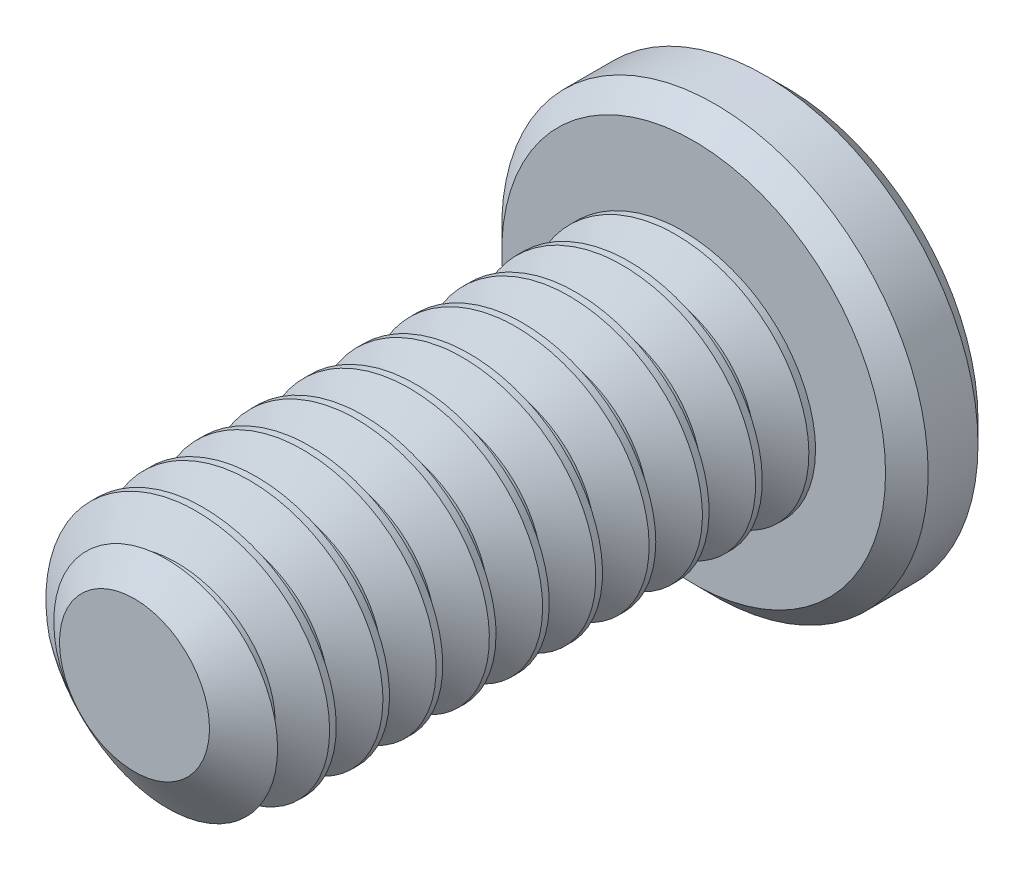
ISO-10303-21;
HEADER;
FILE_DESCRIPTION(('STEP AP214'),'2;1');
FILE_NAME('part.step','',(''),(''),'','','');
FILE_SCHEMA(('AUTOMOTIVE_DESIGN { 1 0 10303 214 1 1 1 1 }'));
ENDSEC;
DATA;
#1=APPLICATION_CONTEXT('core data for automotive mechanical design processes');
#2=APPLICATION_PROTOCOL_DEFINITION('international standard','automotive_design',2000,#1);
#3=PRODUCT_CONTEXT('',#1,'mechanical');
#4=PRODUCT('Part','Part','',(#3));
#5=PRODUCT_RELATED_PRODUCT_CATEGORY('part','',(#4));
#6=PRODUCT_DEFINITION_FORMATION('','',#4);
#7=PRODUCT_DEFINITION_CONTEXT('part definition',#1,'design');
#8=PRODUCT_DEFINITION('design','',#6,#7);
#9=PRODUCT_DEFINITION_SHAPE('','',#8);
#10=(LENGTH_UNIT() NAMED_UNIT(*) SI_UNIT(.MILLI.,.METRE.));
#11=(NAMED_UNIT(*) PLANE_ANGLE_UNIT() SI_UNIT($,.RADIAN.));
#12=(NAMED_UNIT(*) SI_UNIT($,.STERADIAN.) SOLID_ANGLE_UNIT());
#13=UNCERTAINTY_MEASURE_WITH_UNIT(LENGTH_MEASURE(1.E-05),#10,'distance_accuracy_value','');
#14=(GEOMETRIC_REPRESENTATION_CONTEXT(3) GLOBAL_UNCERTAINTY_ASSIGNED_CONTEXT((#13)) GLOBAL_UNIT_ASSIGNED_CONTEXT((#10,
#11,#12)) REPRESENTATION_CONTEXT('',''));
#15=CARTESIAN_POINT('',(0.,0.,0.));
#16=DIRECTION('',(0.,0.,1.));
#17=DIRECTION('',(1.,0.,0.));
#18=AXIS2_PLACEMENT_3D('',#15,#16,#17);
#19=CARTESIAN_POINT('',(0.,0.,5.5499));
#20=DIRECTION('',(0.,0.,-1.));
#21=DIRECTION('',(-1.,0.,0.));
#22=AXIS2_PLACEMENT_3D('',#19,#20,#21);
#23=CYLINDRICAL_SURFACE('',#22,1.0922);
#24=CARTESIAN_POINT('',(0.,0.,5.23230586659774));
#25=DIRECTION('',(0.,0.,-1.));
#26=DIRECTION('',(0.,1.,0.));
#27=AXIS2_PLACEMENT_3D('',#24,#25,#26);
#28=CIRCLE('',#27,1.0922);
#29=CARTESIAN_POINT('',(-0.499334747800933,-0.971373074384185,5.23230586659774));
#30=VERTEX_POINT('',#29);
#31=CARTESIAN_POINT('',(-1.04231913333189,-0.326299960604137,5.23230586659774));
#32=VERTEX_POINT('',#31);
#33=EDGE_CURVE('E321',#30,#32,#28,.T.);
#34=ORIENTED_EDGE('',*,*,#33,.T.);
#35=CARTESIAN_POINT('',(0.,1.0922,5.5499));
#36=CARTESIAN_POINT('',(0.630581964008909,1.0922,5.51210238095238));
#37=CARTESIAN_POINT('',(0.945872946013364,0.546099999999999,5.47430476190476));
#38=CARTESIAN_POINT('',(1.26116392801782,0.,5.43650714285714));
#39=CARTESIAN_POINT('',(0.945872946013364,-0.546100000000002,5.39870952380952));
#40=CARTESIAN_POINT('',(0.63058196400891,-1.0922,5.3609119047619));
#41=CARTESIAN_POINT('',(0.,-1.0922,5.32311428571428));
#42=CARTESIAN_POINT('',(-0.630581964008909,-1.0922,5.28531666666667));
#43=CARTESIAN_POINT('',(-0.945872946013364,-0.546100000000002,5.24751904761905));
#44=CARTESIAN_POINT('',(-1.26116392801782,0.,5.20972142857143));
#45=CARTESIAN_POINT('',(-0.945872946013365,0.546099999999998,5.17192380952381));
#46=CARTESIAN_POINT('',(-0.63058196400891,1.0922,5.13412619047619));
#47=CARTESIAN_POINT('',(0.,1.0922,5.09632857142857));
#48=CARTESIAN_POINT('',(0.630581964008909,1.0922,5.05853095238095));
#49=CARTESIAN_POINT('',(0.945872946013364,0.546099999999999,5.02073333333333));
#50=CARTESIAN_POINT('',(1.26116392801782,0.,4.98293571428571));
#51=CARTESIAN_POINT('',(0.945872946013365,-0.546100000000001,4.94513809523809));
#52=CARTESIAN_POINT('',(0.630581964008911,-1.0922,4.90734047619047));
#53=CARTESIAN_POINT('',(0.,-1.0922,4.86954285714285));
#54=CARTESIAN_POINT('',(-0.630581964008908,-1.0922,4.83174523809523));
#55=CARTESIAN_POINT('',(-0.945872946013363,-0.546100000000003,4.79394761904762));
#56=CARTESIAN_POINT('',(-1.26116392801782,0.,4.75615));
#57=CARTESIAN_POINT('',(-0.945872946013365,0.546099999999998,4.71835238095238));
#58=CARTESIAN_POINT('',(-0.630581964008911,1.0922,4.68055476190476));
#59=CARTESIAN_POINT('',(0.,1.0922,4.64275714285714));
#60=CARTESIAN_POINT('',(0.630581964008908,1.0922,4.60495952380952));
#61=CARTESIAN_POINT('',(0.945872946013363,0.5461,4.5671619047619));
#62=CARTESIAN_POINT('',(1.26116392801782,0.,4.52936428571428));
#63=CARTESIAN_POINT('',(0.945872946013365,-0.546100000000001,4.49156666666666));
#64=CARTESIAN_POINT('',(0.630581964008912,-1.0922,4.45376904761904));
#65=CARTESIAN_POINT('',(0.,-1.0922,4.41597142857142));
#66=CARTESIAN_POINT('',(-0.630581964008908,-1.0922,4.3781738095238));
#67=CARTESIAN_POINT('',(-0.945872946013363,-0.546100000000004,4.34037619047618));
#68=CARTESIAN_POINT('',(-1.26116392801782,0.,4.30257857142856));
#69=CARTESIAN_POINT('',(-0.945872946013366,0.546099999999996,4.26478095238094));
#70=CARTESIAN_POINT('',(-0.630581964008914,1.0922,4.22698333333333));
#71=CARTESIAN_POINT('',(0.,1.0922,4.18918571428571));
#72=CARTESIAN_POINT('',(0.630581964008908,1.0922,4.15138809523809));
#73=CARTESIAN_POINT('',(0.945872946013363,0.5461,4.11359047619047));
#74=CARTESIAN_POINT('',(1.26116392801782,0.,4.07579285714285));
#75=CARTESIAN_POINT('',(0.945872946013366,-0.546099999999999,4.03799523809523));
#76=CARTESIAN_POINT('',(0.630581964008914,-1.0922,4.00019761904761));
#77=CARTESIAN_POINT('',(0.,-1.0922,3.96239999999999));
#78=CARTESIAN_POINT('',(-0.630581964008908,-1.0922,3.92460238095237));
#79=CARTESIAN_POINT('',(-0.945872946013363,-0.546100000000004,3.88680476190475));
#80=CARTESIAN_POINT('',(-1.26116392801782,0.,3.84900714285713));
#81=CARTESIAN_POINT('',(-0.945872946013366,0.546099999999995,3.81120952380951));
#82=CARTESIAN_POINT('',(-0.630581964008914,1.0922,3.77341190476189));
#83=CARTESIAN_POINT('',(0.,1.0922,3.73561428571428));
#84=CARTESIAN_POINT('',(0.630581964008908,1.0922,3.69781666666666));
#85=CARTESIAN_POINT('',(0.945872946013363,0.546100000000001,3.66001904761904));
#86=CARTESIAN_POINT('',(1.26116392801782,0.,3.62222142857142));
#87=CARTESIAN_POINT('',(0.945872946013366,-0.546099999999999,3.5844238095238));
#88=CARTESIAN_POINT('',(0.630581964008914,-1.0922,3.54662619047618));
#89=CARTESIAN_POINT('',(0.,-1.0922,3.50882857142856));
#90=CARTESIAN_POINT('',(-0.630581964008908,-1.0922,3.47103095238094));
#91=CARTESIAN_POINT('',(-0.945872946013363,-0.546100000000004,3.43323333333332));
#92=CARTESIAN_POINT('',(-1.26116392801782,0.,3.3954357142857));
#93=CARTESIAN_POINT('',(-0.945872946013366,0.546099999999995,3.35763809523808));
#94=CARTESIAN_POINT('',(-0.630581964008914,1.0922,3.31984047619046));
#95=CARTESIAN_POINT('',(0.,1.0922,3.28204285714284));
#96=CARTESIAN_POINT('',(0.630581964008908,1.0922,3.24424523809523));
#97=CARTESIAN_POINT('',(0.945872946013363,0.546100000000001,3.20644761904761));
#98=CARTESIAN_POINT('',(1.26116392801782,0.,3.16864999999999));
#99=CARTESIAN_POINT('',(0.945872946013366,-0.546099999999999,3.13085238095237));
#100=CARTESIAN_POINT('',(0.63058196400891,-1.0922,3.09305476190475));
#101=CARTESIAN_POINT('',(0.,-1.0922,3.05525714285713));
#102=CARTESIAN_POINT('',(-0.630581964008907,-1.0922,3.01745952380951));
#103=CARTESIAN_POINT('',(-0.945872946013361,-0.546100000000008,2.97966190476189));
#104=CARTESIAN_POINT('',(-1.26116392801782,0.,2.94186428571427));
#105=CARTESIAN_POINT('',(-0.945872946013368,0.546099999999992,2.90406666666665));
#106=CARTESIAN_POINT('',(-0.630581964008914,1.0922,2.86626904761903));
#107=CARTESIAN_POINT('',(0.,1.0922,2.82847142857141));
#108=CARTESIAN_POINT('',(0.630581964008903,1.0922,2.79067380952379));
#109=CARTESIAN_POINT('',(0.945872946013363,0.546100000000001,2.75287619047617));
#110=CARTESIAN_POINT('',(1.26116392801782,0.,2.71507857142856));
#111=CARTESIAN_POINT('',(0.945872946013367,-0.546099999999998,2.67728095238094));
#112=CARTESIAN_POINT('',(0.630581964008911,-1.0922,2.63948333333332));
#113=CARTESIAN_POINT('',(0.,-1.0922,2.6016857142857));
#114=CARTESIAN_POINT('',(-0.630581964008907,-1.0922,2.56388809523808));
#115=CARTESIAN_POINT('',(-0.945872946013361,-0.546100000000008,2.52609047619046));
#116=CARTESIAN_POINT('',(-1.26116392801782,0.,2.48829285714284));
#117=CARTESIAN_POINT('',(-0.945872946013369,0.546099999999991,2.45049523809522));
#118=CARTESIAN_POINT('',(-0.630581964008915,1.0922,2.4126976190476));
#119=CARTESIAN_POINT('',(0.,1.0922,2.37489999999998));
#120=CARTESIAN_POINT('',(0.630581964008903,1.0922,2.33710238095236));
#121=CARTESIAN_POINT('',(0.945872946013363,0.546100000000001,2.29930476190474));
#122=CARTESIAN_POINT('',(1.26116392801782,0.,2.26150714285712));
#123=CARTESIAN_POINT('',(0.945872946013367,-0.546099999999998,2.2237095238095));
#124=CARTESIAN_POINT('',(0.630581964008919,-1.0922,2.18591190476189));
#125=CARTESIAN_POINT('',(0.,-1.0922,2.14811428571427));
#126=CARTESIAN_POINT('',(-0.630581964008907,-1.0922,2.11031666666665));
#127=CARTESIAN_POINT('',(-0.945872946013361,-0.546100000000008,2.07251904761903));
#128=CARTESIAN_POINT('',(-1.26116392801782,0.,2.03472142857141));
#129=CARTESIAN_POINT('',(-0.945872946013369,0.546099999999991,1.99692380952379));
#130=CARTESIAN_POINT('',(-0.630581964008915,1.0922,1.95912619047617));
#131=CARTESIAN_POINT('',(0.,1.0922,1.92132857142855));
#132=CARTESIAN_POINT('',(0.630581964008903,1.0922,1.88353095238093));
#133=CARTESIAN_POINT('',(0.945872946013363,0.546100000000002,1.84573333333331));
#134=CARTESIAN_POINT('',(1.26116392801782,0.,1.80793571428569));
#135=CARTESIAN_POINT('',(0.945872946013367,-0.546099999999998,1.77013809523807));
#136=CARTESIAN_POINT('',(0.630581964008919,-1.0922,1.73234047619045));
#137=CARTESIAN_POINT('',(0.,-1.0922,1.69454285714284));
#138=CARTESIAN_POINT('',(-0.630581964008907,-1.0922,1.65674523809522));
#139=CARTESIAN_POINT('',(-0.945872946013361,-0.546100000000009,1.6189476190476));
#140=CARTESIAN_POINT('',(-1.26116392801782,0.,1.58114999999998));
#141=CARTESIAN_POINT('',(-0.945872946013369,0.546099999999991,1.54335238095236));
#142=CARTESIAN_POINT('',(-0.630581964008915,1.0922,1.50555476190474));
#143=CARTESIAN_POINT('',(0.,1.0922,1.46775714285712));
#144=CARTESIAN_POINT('',(0.630581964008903,1.0922,1.4299595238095));
#145=CARTESIAN_POINT('',(0.945872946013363,0.546100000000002,1.39216190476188));
#146=CARTESIAN_POINT('',(1.26116392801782,0.,1.35436428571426));
#147=CARTESIAN_POINT('',(0.945872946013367,-0.546099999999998,1.31656666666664));
#148=CARTESIAN_POINT('',(0.630581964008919,-1.0922,1.27876904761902));
#149=CARTESIAN_POINT('',(0.,-1.0922,1.2409714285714));
#150=CARTESIAN_POINT('',(-0.630581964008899,-1.09220000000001,1.20317380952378));
#151=CARTESIAN_POINT('',(-0.945872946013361,-0.546100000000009,1.16537619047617));
#152=CARTESIAN_POINT('',(-1.26116392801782,0.,1.12757857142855));
#153=CARTESIAN_POINT('',(-0.945872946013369,0.546099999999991,1.08978095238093));
#154=CARTESIAN_POINT('',(-0.630581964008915,1.0922,1.05198333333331));
#155=CARTESIAN_POINT('',(0.,1.0922,1.01418571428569));
#156=CARTESIAN_POINT('',(0.630581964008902,1.0922,0.976388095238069));
#157=CARTESIAN_POINT('',(0.945872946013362,0.546100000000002,0.93859047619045));
#158=CARTESIAN_POINT('',(1.26116392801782,0.,0.900792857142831));
#159=CARTESIAN_POINT('',(0.945872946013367,-0.546099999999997,0.862995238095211));
#160=CARTESIAN_POINT('',(0.630581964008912,-1.0922,0.825197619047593));
#161=CARTESIAN_POINT('',(0.,-1.0922,0.787399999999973));
#162=CARTESIAN_POINT('',(-0.630581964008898,-1.09220000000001,0.749602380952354));
#163=CARTESIAN_POINT('',(-0.94587294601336,-0.546100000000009,0.711804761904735));
#164=CARTESIAN_POINT('',(-1.26116392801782,0.,0.674007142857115));
#165=CARTESIAN_POINT('',(-0.945872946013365,0.546099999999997,0.636209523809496));
#166=CARTESIAN_POINT('',(-0.630581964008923,1.09219999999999,0.598411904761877));
#167=CARTESIAN_POINT('',(0.,1.0922,0.560614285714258));
#168=CARTESIAN_POINT('',(0.630581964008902,1.0922,0.522816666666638));
#169=CARTESIAN_POINT('',(0.945872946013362,0.546100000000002,0.485019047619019));
#170=CARTESIAN_POINT('',(1.26116392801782,0.,0.4472214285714));
#171=CARTESIAN_POINT('',(0.945872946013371,-0.54609999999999,0.40942380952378));
#172=CARTESIAN_POINT('',(0.63058196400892,-1.0922,0.371626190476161));
#173=CARTESIAN_POINT('',(0.,-1.0922,0.333828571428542));
#174=CARTESIAN_POINT('',(-0.630581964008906,-1.0922,0.296030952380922));
#175=CARTESIAN_POINT('',(-0.945872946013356,-0.546100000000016,0.258233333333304));
#176=CARTESIAN_POINT('',(-1.26116392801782,0.,0.220435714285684));
#177=CARTESIAN_POINT('',(-0.945872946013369,0.54609999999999,0.182638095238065));
#178=CARTESIAN_POINT('',(-0.630581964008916,1.0922,0.144840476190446));
#179=CARTESIAN_POINT('',(0.,1.0922,0.107042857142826));
#180=(BOUNDED_CURVE() B_SPLINE_CURVE(2,(#35,#36,#37,#38,#39,#40,#41,#42,#43,#44,#45,#46,#47,#48,
#49,#50,#51,#52,#53,#54,#55,#56,#57,#58,#59,#60,#61,#62,#63,#64,#65,#66,#67,#68,#69,#70,#71,#72,
#73,#74,#75,#76,#77,#78,#79,#80,#81,#82,#83,#84,#85,#86,#87,#88,#89,#90,#91,#92,#93,#94,#95,#96,
#97,#98,#99,#100,#101,#102,#103,#104,#105,#106,#107,#108,#109,#110,#111,#112,#113,#114,#115,
#116,#117,#118,#119,#120,#121,#122,#123,#124,#125,#126,#127,#128,#129,#130,#131,#132,#133,#134,
#135,#136,#137,#138,#139,#140,#141,#142,#143,#144,#145,#146,#147,#148,#149,#150,#151,#152,#153,
#154,#155,#156,#157,#158,#159,#160,#161,#162,#163,#164,#165,#166,#167,#168,#169,#170,#171,#172,
#173,#174,#175,#176,#177,#178,#179),.UNSPECIFIED.,.F.,.F.) B_SPLINE_CURVE_WITH_KNOTS((3,2,2,2,2,
2,2,2,2,2,2,2,2,2,2,2,2,2,2,2,2,2,2,2,2,2,2,2,2,2,2,2,2,2,2,2,2,2,2,2,2,2,2,2,2,2,2,2,2,2,2,2,2,
2,2,2,2,2,2,2,2,2,2,2,2,2,2,2,2,2,2,2,3),(0.,0.0138888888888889,0.0277777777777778,
0.0416666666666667,0.0555555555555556,0.0694444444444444,0.0833333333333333,0.0972222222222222,
0.111111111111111,0.125,0.138888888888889,0.152777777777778,0.166666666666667,0.180555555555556,
0.194444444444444,0.208333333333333,0.222222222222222,0.236111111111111,0.25,0.263888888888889,
0.277777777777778,0.291666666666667,0.305555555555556,0.319444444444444,0.333333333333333,
0.347222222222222,0.361111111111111,0.375,0.388888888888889,0.402777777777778,0.416666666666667,
0.430555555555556,0.444444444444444,0.458333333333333,0.472222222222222,0.486111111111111,0.5,
0.513888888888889,0.527777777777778,0.541666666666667,0.555555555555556,0.569444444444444,
0.583333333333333,0.597222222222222,0.611111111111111,0.625,0.638888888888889,0.652777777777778,
0.666666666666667,0.680555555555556,0.694444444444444,0.708333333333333,0.722222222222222,
0.736111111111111,0.75,0.763888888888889,0.777777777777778,0.791666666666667,0.805555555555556,
0.819444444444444,0.833333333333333,0.847222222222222,0.861111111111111,0.875,0.888888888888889,
0.902777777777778,0.916666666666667,0.930555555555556,0.944444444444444,0.958333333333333,
0.972222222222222,0.986111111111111,1.),
.UNSPECIFIED.) CURVE() GEOMETRIC_REPRESENTATION_ITEM() RATIONAL_B_SPLINE_CURVE((1.,
0.866025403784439,1.,0.866025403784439,1.,0.866025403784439,1.,0.866025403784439,1.,
0.866025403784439,1.,0.866025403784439,1.,0.866025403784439,1.,0.866025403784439,1.,
0.866025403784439,1.,0.866025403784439,1.,0.866025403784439,1.,0.866025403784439,1.,
0.866025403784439,1.,0.866025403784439,1.,0.866025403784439,1.,0.866025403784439,1.,
0.866025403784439,1.,0.866025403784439,1.,0.866025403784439,1.,0.866025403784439,1.,
0.866025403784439,1.,0.866025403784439,1.,0.866025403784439,1.,0.866025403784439,1.,
0.866025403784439,1.,0.866025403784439,1.,0.866025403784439,1.,0.866025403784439,1.,
0.866025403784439,1.,0.866025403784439,1.,0.866025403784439,1.,0.866025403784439,1.,
0.866025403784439,1.,0.866025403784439,1.,0.866025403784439,1.,0.866025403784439,1.,
0.866025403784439,1.,0.866025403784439,1.,0.866025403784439,1.,0.866025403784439,1.,
0.866025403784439,1.,0.866025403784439,1.,0.866025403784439,1.,0.866025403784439,1.,
0.866025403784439,1.,0.866025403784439,1.,0.866025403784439,1.,0.866025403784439,1.,
0.866025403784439,1.,0.866025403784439,1.,0.866025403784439,1.,0.866025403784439,1.,
0.866025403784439,1.,0.866025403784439,1.,0.866025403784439,1.,0.866025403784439,1.,
0.866025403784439,1.,0.866025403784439,1.,0.866025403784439,1.,0.866025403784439,1.,
0.866025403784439,1.,0.866025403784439,1.,0.866025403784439,1.,0.866025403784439,1.,
0.866025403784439,1.,0.866025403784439,1.,0.866025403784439,1.,0.866025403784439,1.,
0.866025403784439,1.,0.866025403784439,1.,0.866025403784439,1.,0.866025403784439,1.)) REPRESENTATION_ITEM(''));
#181=CARTESIAN_POINT('',(0.,-1.0922,0.787399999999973));
#182=VERTEX_POINT('',#181);
#183=EDGE_CURVE('E250',#32,#182,#180,.T.);
#184=ORIENTED_EDGE('',*,*,#183,.T.);
#185=CARTESIAN_POINT('',(0.,0.,0.7874));
#186=DIRECTION('',(0.,0.,1.));
#187=DIRECTION('',(1.,0.,0.));
#188=AXIS2_PLACEMENT_3D('',#185,#186,#187);
#189=CIRCLE('',#188,1.0922);
#190=CARTESIAN_POINT('',(0.765227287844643,-0.77931254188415,0.787399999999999));
#191=VERTEX_POINT('',#190);
#192=EDGE_CURVE('E322',#182,#191,#189,.T.);
#193=ORIENTED_EDGE('',*,*,#192,.T.);
#194=CARTESIAN_POINT('',(0.,1.0922,5.946775));
#195=CARTESIAN_POINT('',(0.630581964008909,1.0922,5.90897738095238));
#196=CARTESIAN_POINT('',(0.945872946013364,0.546099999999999,5.87117976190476));
#197=CARTESIAN_POINT('',(1.26116392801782,0.,5.83338214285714));
#198=CARTESIAN_POINT('',(0.945872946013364,-0.546100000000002,5.79558452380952));
#199=CARTESIAN_POINT('',(0.63058196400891,-1.0922,5.7577869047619));
#200=CARTESIAN_POINT('',(0.,-1.0922,5.71998928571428));
#201=CARTESIAN_POINT('',(-0.630581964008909,-1.0922,5.68219166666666));
#202=CARTESIAN_POINT('',(-0.945872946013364,-0.546100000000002,5.64439404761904));
#203=CARTESIAN_POINT('',(-1.26116392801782,0.,5.60659642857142));
#204=CARTESIAN_POINT('',(-0.945872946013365,0.546099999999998,5.56879880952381));
#205=CARTESIAN_POINT('',(-0.63058196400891,1.0922,5.53100119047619));
#206=CARTESIAN_POINT('',(0.,1.0922,5.49320357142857));
#207=CARTESIAN_POINT('',(0.630581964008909,1.0922,5.45540595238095));
#208=CARTESIAN_POINT('',(0.945872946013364,0.546099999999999,5.41760833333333));
#209=CARTESIAN_POINT('',(1.26116392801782,0.,5.37981071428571));
#210=CARTESIAN_POINT('',(0.945872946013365,-0.546100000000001,5.34201309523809));
#211=CARTESIAN_POINT('',(0.630581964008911,-1.0922,5.30421547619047));
#212=CARTESIAN_POINT('',(0.,-1.0922,5.26641785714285));
#213=CARTESIAN_POINT('',(-0.630581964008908,-1.0922,5.22862023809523));
#214=CARTESIAN_POINT('',(-0.945872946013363,-0.546100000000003,5.19082261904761));
#215=CARTESIAN_POINT('',(-1.26116392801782,0.,5.15302499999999));
#216=CARTESIAN_POINT('',(-0.945872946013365,0.546099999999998,5.11522738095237));
#217=CARTESIAN_POINT('',(-0.630581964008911,1.0922,5.07742976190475));
#218=CARTESIAN_POINT('',(0.,1.0922,5.03963214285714));
#219=CARTESIAN_POINT('',(0.630581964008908,1.0922,5.00183452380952));
#220=CARTESIAN_POINT('',(0.945872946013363,0.5461,4.9640369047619));
#221=CARTESIAN_POINT('',(1.26116392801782,0.,4.92623928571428));
#222=CARTESIAN_POINT('',(0.945872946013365,-0.546100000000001,4.88844166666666));
#223=CARTESIAN_POINT('',(0.630581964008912,-1.0922,4.85064404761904));
#224=CARTESIAN_POINT('',(0.,-1.0922,4.81284642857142));
#225=CARTESIAN_POINT('',(-0.630581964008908,-1.0922,4.7750488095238));
#226=CARTESIAN_POINT('',(-0.945872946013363,-0.546100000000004,4.73725119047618));
#227=CARTESIAN_POINT('',(-1.26116392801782,0.,4.69945357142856));
#228=CARTESIAN_POINT('',(-0.945872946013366,0.546099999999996,4.66165595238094));
#229=CARTESIAN_POINT('',(-0.630581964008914,1.0922,4.62385833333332));
#230=CARTESIAN_POINT('',(0.,1.0922,4.58606071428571));
#231=CARTESIAN_POINT('',(0.630581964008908,1.0922,4.54826309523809));
#232=CARTESIAN_POINT('',(0.945872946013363,0.5461,4.51046547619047));
#233=CARTESIAN_POINT('',(1.26116392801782,0.,4.47266785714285));
#234=CARTESIAN_POINT('',(0.945872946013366,-0.546099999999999,4.43487023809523));
#235=CARTESIAN_POINT('',(0.630581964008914,-1.0922,4.39707261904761));
#236=CARTESIAN_POINT('',(0.,-1.0922,4.35927499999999));
#237=CARTESIAN_POINT('',(-0.630581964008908,-1.0922,4.32147738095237));
#238=CARTESIAN_POINT('',(-0.945872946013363,-0.546100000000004,4.28367976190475));
#239=CARTESIAN_POINT('',(-1.26116392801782,0.,4.24588214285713));
#240=CARTESIAN_POINT('',(-0.945872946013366,0.546099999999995,4.20808452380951));
#241=CARTESIAN_POINT('',(-0.630581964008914,1.0922,4.17028690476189));
#242=CARTESIAN_POINT('',(0.,1.0922,4.13248928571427));
#243=CARTESIAN_POINT('',(0.630581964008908,1.0922,4.09469166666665));
#244=CARTESIAN_POINT('',(0.945872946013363,0.546100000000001,4.05689404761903));
#245=CARTESIAN_POINT('',(1.26116392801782,0.,4.01909642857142));
#246=CARTESIAN_POINT('',(0.945872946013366,-0.546099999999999,3.9812988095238));
#247=CARTESIAN_POINT('',(0.630581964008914,-1.0922,3.94350119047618));
#248=CARTESIAN_POINT('',(0.,-1.0922,3.90570357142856));
#249=CARTESIAN_POINT('',(-0.630581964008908,-1.0922,3.86790595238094));
#250=CARTESIAN_POINT('',(-0.945872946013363,-0.546100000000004,3.83010833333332));
#251=CARTESIAN_POINT('',(-1.26116392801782,0.,3.7923107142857));
#252=CARTESIAN_POINT('',(-0.945872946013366,0.546099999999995,3.75451309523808));
#253=CARTESIAN_POINT('',(-0.630581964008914,1.0922,3.71671547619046));
#254=CARTESIAN_POINT('',(0.,1.0922,3.67891785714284));
#255=CARTESIAN_POINT('',(0.630581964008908,1.0922,3.64112023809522));
#256=CARTESIAN_POINT('',(0.945872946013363,0.546100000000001,3.6033226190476));
#257=CARTESIAN_POINT('',(1.26116392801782,0.,3.56552499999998));
#258=CARTESIAN_POINT('',(0.945872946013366,-0.546099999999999,3.52772738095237));
#259=CARTESIAN_POINT('',(0.63058196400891,-1.0922,3.48992976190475));
#260=CARTESIAN_POINT('',(0.,-1.0922,3.45213214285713));
#261=CARTESIAN_POINT('',(-0.630581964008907,-1.0922,3.41433452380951));
#262=CARTESIAN_POINT('',(-0.945872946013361,-0.546100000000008,3.37653690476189));
#263=CARTESIAN_POINT('',(-1.26116392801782,0.,3.33873928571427));
#264=CARTESIAN_POINT('',(-0.945872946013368,0.546099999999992,3.30094166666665));
#265=CARTESIAN_POINT('',(-0.630581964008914,1.0922,3.26314404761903));
#266=CARTESIAN_POINT('',(0.,1.0922,3.22534642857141));
#267=CARTESIAN_POINT('',(0.630581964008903,1.0922,3.18754880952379));
#268=CARTESIAN_POINT('',(0.945872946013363,0.546100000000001,3.14975119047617));
#269=CARTESIAN_POINT('',(1.26116392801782,0.,3.11195357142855));
#270=CARTESIAN_POINT('',(0.945872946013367,-0.546099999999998,3.07415595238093));
#271=CARTESIAN_POINT('',(0.630581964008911,-1.0922,3.03635833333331));
#272=CARTESIAN_POINT('',(0.,-1.0922,2.9985607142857));
#273=CARTESIAN_POINT('',(-0.630581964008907,-1.0922,2.96076309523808));
#274=CARTESIAN_POINT('',(-0.945872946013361,-0.546100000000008,2.92296547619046));
#275=CARTESIAN_POINT('',(-1.26116392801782,0.,2.88516785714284));
#276=CARTESIAN_POINT('',(-0.945872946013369,0.546099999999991,2.84737023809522));
#277=CARTESIAN_POINT('',(-0.630581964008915,1.0922,2.8095726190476));
#278=CARTESIAN_POINT('',(0.,1.0922,2.77177499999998));
#279=CARTESIAN_POINT('',(0.630581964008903,1.0922,2.73397738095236));
#280=CARTESIAN_POINT('',(0.945872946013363,0.546100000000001,2.69617976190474));
#281=CARTESIAN_POINT('',(1.26116392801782,0.,2.65838214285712));
#282=CARTESIAN_POINT('',(0.945872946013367,-0.546099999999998,2.6205845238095));
#283=CARTESIAN_POINT('',(0.630581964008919,-1.0922,2.58278690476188));
#284=CARTESIAN_POINT('',(0.,-1.0922,2.54498928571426));
#285=CARTESIAN_POINT('',(-0.630581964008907,-1.0922,2.50719166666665));
#286=CARTESIAN_POINT('',(-0.945872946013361,-0.546100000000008,2.46939404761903));
#287=CARTESIAN_POINT('',(-1.26116392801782,0.,2.43159642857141));
#288=CARTESIAN_POINT('',(-0.945872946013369,0.546099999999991,2.39379880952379));
#289=CARTESIAN_POINT('',(-0.630581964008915,1.0922,2.35600119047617));
#290=CARTESIAN_POINT('',(0.,1.0922,2.31820357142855));
#291=CARTESIAN_POINT('',(0.630581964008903,1.0922,2.28040595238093));
#292=CARTESIAN_POINT('',(0.945872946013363,0.546100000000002,2.24260833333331));
#293=CARTESIAN_POINT('',(1.26116392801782,0.,2.20481071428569));
#294=CARTESIAN_POINT('',(0.945872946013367,-0.546099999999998,2.16701309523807));
#295=CARTESIAN_POINT('',(0.630581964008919,-1.0922,2.12921547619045));
#296=CARTESIAN_POINT('',(0.,-1.0922,2.09141785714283));
#297=CARTESIAN_POINT('',(-0.630581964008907,-1.0922,2.05362023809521));
#298=CARTESIAN_POINT('',(-0.945872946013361,-0.546100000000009,2.01582261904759));
#299=CARTESIAN_POINT('',(-1.26116392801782,0.,1.97802499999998));
#300=CARTESIAN_POINT('',(-0.945872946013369,0.546099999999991,1.94022738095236));
#301=CARTESIAN_POINT('',(-0.630581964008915,1.0922,1.90242976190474));
#302=CARTESIAN_POINT('',(0.,1.0922,1.86463214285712));
#303=CARTESIAN_POINT('',(0.630581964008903,1.0922,1.8268345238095));
#304=CARTESIAN_POINT('',(0.945872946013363,0.546100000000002,1.78903690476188));
#305=CARTESIAN_POINT('',(1.26116392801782,0.,1.75123928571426));
#306=CARTESIAN_POINT('',(0.945872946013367,-0.546099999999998,1.71344166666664));
#307=CARTESIAN_POINT('',(0.630581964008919,-1.0922,1.67564404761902));
#308=CARTESIAN_POINT('',(0.,-1.0922,1.6378464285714));
#309=CARTESIAN_POINT('',(-0.630581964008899,-1.09220000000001,1.60004880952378));
#310=CARTESIAN_POINT('',(-0.945872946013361,-0.546100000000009,1.56225119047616));
#311=CARTESIAN_POINT('',(-1.26116392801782,0.,1.52445357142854));
#312=CARTESIAN_POINT('',(-0.945872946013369,0.546099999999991,1.48665595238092));
#313=CARTESIAN_POINT('',(-0.630581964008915,1.0922,1.44885833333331));
#314=CARTESIAN_POINT('',(0.,1.0922,1.41106071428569));
#315=CARTESIAN_POINT('',(0.630581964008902,1.0922,1.37326309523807));
#316=CARTESIAN_POINT('',(0.945872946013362,0.546100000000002,1.33546547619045));
#317=CARTESIAN_POINT('',(1.26116392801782,0.,1.29766785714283));
#318=CARTESIAN_POINT('',(0.945872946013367,-0.546099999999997,1.25987023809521));
#319=CARTESIAN_POINT('',(0.630581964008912,-1.0922,1.22207261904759));
#320=CARTESIAN_POINT('',(0.,-1.0922,1.18427499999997));
#321=CARTESIAN_POINT('',(-0.630581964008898,-1.09220000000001,1.14647738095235));
#322=CARTESIAN_POINT('',(-0.94587294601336,-0.546100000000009,1.10867976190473));
#323=CARTESIAN_POINT('',(-1.26116392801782,0.,1.07088214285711));
#324=CARTESIAN_POINT('',(-0.945872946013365,0.546099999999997,1.03308452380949));
#325=CARTESIAN_POINT('',(-0.630581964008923,1.09219999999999,0.995286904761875));
#326=CARTESIAN_POINT('',(0.,1.0922,0.957489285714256));
#327=CARTESIAN_POINT('',(0.630581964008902,1.0922,0.919691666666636));
#328=CARTESIAN_POINT('',(0.945872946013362,0.546100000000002,0.881894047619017));
#329=CARTESIAN_POINT('',(1.26116392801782,0.,0.844096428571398));
#330=CARTESIAN_POINT('',(0.945872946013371,-0.54609999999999,0.806298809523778));
#331=CARTESIAN_POINT('',(0.63058196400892,-1.0922,0.768501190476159));
#332=CARTESIAN_POINT('',(0.,-1.0922,0.73070357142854));
#333=CARTESIAN_POINT('',(-0.630581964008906,-1.0922,0.69290595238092));
#334=CARTESIAN_POINT('',(-0.945872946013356,-0.546100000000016,0.655108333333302));
#335=CARTESIAN_POINT('',(-1.26116392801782,0.,0.617310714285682));
#336=CARTESIAN_POINT('',(-0.945872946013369,0.54609999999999,0.579513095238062));
#337=CARTESIAN_POINT('',(-0.630581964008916,1.0922,0.541715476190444));
#338=CARTESIAN_POINT('',(0.,1.0922,0.503917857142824));
#339=(BOUNDED_CURVE() B_SPLINE_CURVE(2,(#194,#195,#196,#197,#198,#199,#200,#201,#202,#203,#204,
#205,#206,#207,#208,#209,#210,#211,#212,#213,#214,#215,#216,#217,#218,#219,#220,#221,#222,#223,
#224,#225,#226,#227,#228,#229,#230,#231,#232,#233,#234,#235,#236,#237,#238,#239,#240,#241,#242,
#243,#244,#245,#246,#247,#248,#249,#250,#251,#252,#253,#254,#255,#256,#257,#258,#259,#260,#261,
#262,#263,#264,#265,#266,#267,#268,#269,#270,#271,#272,#273,#274,#275,#276,#277,#278,#279,#280,
#281,#282,#283,#284,#285,#286,#287,#288,#289,#290,#291,#292,#293,#294,#295,#296,#297,#298,#299,
#300,#301,#302,#303,#304,#305,#306,#307,#308,#309,#310,#311,#312,#313,#314,#315,#316,#317,#318,
#319,#320,#321,#322,#323,#324,#325,#326,#327,#328,#329,#330,#331,#332,#333,#334,#335,#336,#337,
#338),.UNSPECIFIED.,.F.,.F.) B_SPLINE_CURVE_WITH_KNOTS((3,2,2,2,2,2,2,2,2,2,2,2,2,2,2,2,2,2,2,2,
2,2,2,2,2,2,2,2,2,2,2,2,2,2,2,2,2,2,2,2,2,2,2,2,2,2,2,2,2,2,2,2,2,2,2,2,2,2,2,2,2,2,2,2,2,2,2,2,
2,2,2,2,3),(0.,0.0138888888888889,0.0277777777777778,0.0416666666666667,0.0555555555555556,
0.0694444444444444,0.0833333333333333,0.0972222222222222,0.111111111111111,0.125,
0.138888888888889,0.152777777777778,0.166666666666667,0.180555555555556,0.194444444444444,
0.208333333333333,0.222222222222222,0.236111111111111,0.25,0.263888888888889,0.277777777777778,
0.291666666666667,0.305555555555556,0.319444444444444,0.333333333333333,0.347222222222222,
0.361111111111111,0.375,0.388888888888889,0.402777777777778,0.416666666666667,0.430555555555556,
0.444444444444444,0.458333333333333,0.472222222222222,0.486111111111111,0.5,0.513888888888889,
0.527777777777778,0.541666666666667,0.555555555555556,0.569444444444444,0.583333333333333,
0.597222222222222,0.611111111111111,0.625,0.638888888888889,0.652777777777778,0.666666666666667,
0.680555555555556,0.694444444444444,0.708333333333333,0.722222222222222,0.736111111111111,0.75,
0.763888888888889,0.777777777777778,0.791666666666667,0.805555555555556,0.819444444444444,
0.833333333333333,0.847222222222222,0.861111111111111,0.875,0.888888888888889,0.902777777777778,
0.916666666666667,0.930555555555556,0.944444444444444,0.958333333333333,0.972222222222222,
0.986111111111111,1.),
.UNSPECIFIED.) CURVE() GEOMETRIC_REPRESENTATION_ITEM() RATIONAL_B_SPLINE_CURVE((1.,
0.866025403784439,1.,0.866025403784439,1.,0.866025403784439,1.,0.866025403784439,1.,
0.866025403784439,1.,0.866025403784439,1.,0.866025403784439,1.,0.866025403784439,1.,
0.866025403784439,1.,0.866025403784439,1.,0.866025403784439,1.,0.866025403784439,1.,
0.866025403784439,1.,0.866025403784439,1.,0.866025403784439,1.,0.866025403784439,1.,
0.866025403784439,1.,0.866025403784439,1.,0.866025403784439,1.,0.866025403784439,1.,
0.866025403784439,1.,0.866025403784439,1.,0.866025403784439,1.,0.866025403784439,1.,
0.866025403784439,1.,0.866025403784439,1.,0.866025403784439,1.,0.866025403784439,1.,
0.866025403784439,1.,0.866025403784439,1.,0.866025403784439,1.,0.866025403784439,1.,
0.866025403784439,1.,0.866025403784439,1.,0.866025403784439,1.,0.866025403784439,1.,
0.866025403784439,1.,0.866025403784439,1.,0.866025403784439,1.,0.866025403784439,1.,
0.866025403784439,1.,0.866025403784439,1.,0.866025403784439,1.,0.866025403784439,1.,
0.866025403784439,1.,0.866025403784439,1.,0.866025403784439,1.,0.866025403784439,1.,
0.866025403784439,1.,0.866025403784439,1.,0.866025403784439,1.,0.866025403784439,1.,
0.866025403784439,1.,0.866025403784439,1.,0.866025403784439,1.,0.866025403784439,1.,
0.866025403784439,1.,0.866025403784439,1.,0.866025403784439,1.,0.866025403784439,1.,
0.866025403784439,1.,0.866025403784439,1.,0.866025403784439,1.,0.866025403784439,1.,
0.866025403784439,1.,0.866025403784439,1.,0.866025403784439,1.,0.866025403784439,1.,
0.866025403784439,1.,0.866025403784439,1.,0.866025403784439,1.,0.866025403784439,1.)) REPRESENTATION_ITEM(''));
#340=EDGE_CURVE('E266',#30,#191,#339,.T.);
#341=ORIENTED_EDGE('',*,*,#340,.F.);
#342=EDGE_LOOP('',(#34,#184,#193,#341));
#343=FACE_BOUND('',#342,.T.);
#344=ADVANCED_FACE('F38',(#343),#23,.T.);
#345=CARTESIAN_POINT('',(0.,0.,5.5499));
#346=DIRECTION('',(0.,0.,-1.));
#347=DIRECTION('',(0.,1.,0.));
#348=AXIS2_PLACEMENT_3D('',#345,#346,#347);
#349=CONICAL_SURFACE('',#348,0.638628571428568,0.959931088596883);
#350=CARTESIAN_POINT('',(0.,0.,5.43858930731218));
#351=DIRECTION('',(0.,0.,-1.));
#352=DIRECTION('',(0.,1.,0.));
#353=AXIS2_PLACEMENT_3D('',#350,#351,#352);
#354=CIRCLE('',#353,0.79759671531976);
#355=CARTESIAN_POINT('',(-0.797294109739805,-0.0219686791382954,5.43858930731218));
#356=VERTEX_POINT('',#355);
#357=CARTESIAN_POINT('',(-0.542464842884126,-0.584715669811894,5.43858930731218));
#358=VERTEX_POINT('',#357);
#359=EDGE_CURVE('E52',#356,#358,#354,.F.);
#360=ORIENTED_EDGE('',*,*,#359,.T.);
#361=CARTESIAN_POINT('',(-0.542464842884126,-0.584715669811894,5.43858930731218));
#362=CARTESIAN_POINT('',(-0.56318613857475,-0.582575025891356,5.42982191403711));
#363=CARTESIAN_POINT('',(-0.583867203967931,-0.579468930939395,5.42120074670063));
#364=CARTESIAN_POINT('',(-0.624997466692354,-0.571370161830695,5.40425108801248));
#365=CARTESIAN_POINT('',(-0.645446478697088,-0.56637607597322,5.39592282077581));
#366=CARTESIAN_POINT('',(-0.685677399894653,-0.554622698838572,5.37967423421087));
#367=CARTESIAN_POINT('',(-0.705464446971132,-0.54788618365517,5.37175012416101));
#368=CARTESIAN_POINT('',(-0.744470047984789,-0.53267589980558,5.3562143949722));
#369=CARTESIAN_POINT('',(-0.76368896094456,-0.524203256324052,5.34860257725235));
#370=CARTESIAN_POINT('',(-0.794392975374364,-0.509077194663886,5.33646472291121));
#371=CARTESIAN_POINT('',(-0.806089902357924,-0.502923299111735,5.33184631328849));
#372=CARTESIAN_POINT('',(-0.829163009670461,-0.489946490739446,5.32275169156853));
#373=CARTESIAN_POINT('',(-0.840539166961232,-0.483123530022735,5.31827548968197));
#374=CARTESIAN_POINT('',(-0.863064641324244,-0.469064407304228,5.30931132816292));
#375=CARTESIAN_POINT('',(-0.874213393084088,-0.461827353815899,5.30482336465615));
#376=CARTESIAN_POINT('',(-0.89624661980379,-0.446959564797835,5.29585200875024));
#377=CARTESIAN_POINT('',(-0.907131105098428,-0.439328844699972,5.29136861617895));
#378=CARTESIAN_POINT('',(-0.939879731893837,-0.415488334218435,5.27771865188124));
#379=CARTESIAN_POINT('',(-0.961305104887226,-0.398662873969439,5.26856464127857));
#380=CARTESIAN_POINT('',(-1.00281578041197,-0.363557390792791,5.25035921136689));
#381=CARTESIAN_POINT('',(-1.02290598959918,-0.345283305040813,5.24130753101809));
#382=CARTESIAN_POINT('',(-1.04231913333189,-0.326299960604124,5.23230586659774));
#383=B_SPLINE_CURVE_WITH_KNOTS('',3,(#361,#362,#363,#364,#365,#366,#367,#368,#369,#370,#371,
#372,#373,#374,#375,#376,#377,#378,#379,#380,#381,#382),.UNSPECIFIED.,.F.,.F.,(4,2,2,2,2,2,2,2,
2,2,4),(0.,0.0677802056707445,0.135611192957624,0.202596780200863,0.269539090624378,
0.311522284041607,0.353508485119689,0.395588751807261,0.43766737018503,0.523812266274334,
0.609620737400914),.UNSPECIFIED.);
#384=EDGE_CURVE('E12',#358,#32,#383,.T.);
#385=ORIENTED_EDGE('',*,*,#384,.T.);
#386=ORIENTED_EDGE('',*,*,#33,.F.);
#387=CARTESIAN_POINT('',(-0.499334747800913,-0.971373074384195,5.23230586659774));
#388=CARTESIAN_POINT('',(-0.471273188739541,-0.983933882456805,5.23346910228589));
#389=CARTESIAN_POINT('',(-0.442679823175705,-0.995305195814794,5.23463254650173));
#390=CARTESIAN_POINT('',(-0.384643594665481,-1.01559938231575,5.23695133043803));
#391=CARTESIAN_POINT('',(-0.35520091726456,-1.02452278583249,5.23810667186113));
#392=CARTESIAN_POINT('',(-0.295619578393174,-1.03986963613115,5.24040310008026));
#393=CARTESIAN_POINT('',(-0.265479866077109,-1.04628900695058,5.24154416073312));
#394=CARTESIAN_POINT('',(-0.204762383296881,-1.05656482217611,5.24380038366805));
#395=CARTESIAN_POINT('',(-0.174184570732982,-1.06042101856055,5.24491554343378));
#396=CARTESIAN_POINT('',(-0.112788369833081,-1.06553788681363,5.24711630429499));
#397=CARTESIAN_POINT('',(-0.0819698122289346,-1.06679652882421,5.24820188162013));
#398=CARTESIAN_POINT('',(-0.0203342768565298,-1.06672688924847,5.25031754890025));
#399=CARTESIAN_POINT('',(0.0104827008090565,-1.06539883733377,5.25134764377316));
#400=CARTESIAN_POINT('',(0.0718471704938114,-1.05999391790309,5.25346529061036));
#401=CARTESIAN_POINT('',(0.102394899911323,-1.05591978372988,5.25455278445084));
#402=CARTESIAN_POINT('',(0.162996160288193,-1.04507251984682,5.25677142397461));
#403=CARTESIAN_POINT('',(0.193049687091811,-1.03829936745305,5.2579025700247));
#404=CARTESIAN_POINT('',(0.280174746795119,-1.01452370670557,5.26127761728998));
#405=CARTESIAN_POINT('',(0.336295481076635,-0.993872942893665,5.2635751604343));
#406=CARTESIAN_POINT('',(0.444137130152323,-0.943235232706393,5.26824835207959));
#407=CARTESIAN_POINT('',(0.495856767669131,-0.913245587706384,5.27062402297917));
#408=CARTESIAN_POINT('',(0.592254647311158,-0.845611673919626,5.27533282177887));
#409=CARTESIAN_POINT('',(0.637066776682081,-0.808157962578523,5.27766568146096));
#410=CARTESIAN_POINT('',(0.719787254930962,-0.726220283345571,5.28227223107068));
#411=CARTESIAN_POINT('',(0.757694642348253,-0.681735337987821,5.28454591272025));
#412=CARTESIAN_POINT('',(0.808526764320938,-0.610730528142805,5.28787020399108));
#413=CARTESIAN_POINT('',(0.824478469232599,-0.586323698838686,5.2889649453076));
#414=CARTESIAN_POINT('',(0.854295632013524,-0.536256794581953,5.29109554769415));
#415=CARTESIAN_POINT('',(0.868161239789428,-0.510596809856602,5.29213141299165));
#416=CARTESIAN_POINT('',(0.893557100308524,-0.458157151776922,5.2942419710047));
#417=CARTESIAN_POINT('',(0.905088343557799,-0.431377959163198,5.2953166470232));
#418=CARTESIAN_POINT('',(0.925703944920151,-0.376904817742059,5.29751712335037));
#419=CARTESIAN_POINT('',(0.934788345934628,-0.349210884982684,5.29864292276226));
#420=CARTESIAN_POINT('',(0.957768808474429,-0.266849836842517,5.3020065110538));
#421=CARTESIAN_POINT('',(0.968219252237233,-0.211179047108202,5.30429958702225));
#422=CARTESIAN_POINT('',(0.979341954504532,-0.098894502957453,5.30897297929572));
#423=CARTESIAN_POINT('',(0.980013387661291,-0.0422806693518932,5.31135330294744));
#424=CARTESIAN_POINT('',(0.971691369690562,0.0686773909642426,5.31606881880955));
#425=CARTESIAN_POINT('',(0.962960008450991,0.123041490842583,5.31840348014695));
#426=CARTESIAN_POINT('',(0.936470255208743,0.229571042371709,5.32302274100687));
#427=CARTESIAN_POINT('',(0.918709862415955,0.281736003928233,5.32530732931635));
#428=CARTESIAN_POINT('',(0.885698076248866,0.357157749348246,5.32865217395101));
#429=CARTESIAN_POINT('',(0.873618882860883,0.381847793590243,5.32975437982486));
#430=CARTESIAN_POINT('',(0.84743705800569,0.430141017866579,5.33190488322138));
#431=CARTESIAN_POINT('',(0.833334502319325,0.45374423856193,5.332953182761));
#432=CARTESIAN_POINT('',(0.803123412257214,0.499618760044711,5.33506175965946));
#433=CARTESIAN_POINT('',(0.787015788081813,0.521890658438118,5.33612203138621));
#434=CARTESIAN_POINT('',(0.752863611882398,0.564881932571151,5.33830305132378));
#435=CARTESIAN_POINT('',(0.734819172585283,0.585601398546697,5.33942379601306));
#436=CARTESIAN_POINT('',(0.679150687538,0.643997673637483,5.34277650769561));
#437=CARTESIAN_POINT('',(0.639035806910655,0.67935280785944,5.34506482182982));
#438=CARTESIAN_POINT('',(0.553295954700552,0.742543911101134,5.34973855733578));
#439=CARTESIAN_POINT('',(0.507670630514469,0.770379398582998,5.35212398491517));
#440=CARTESIAN_POINT('',(0.413813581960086,0.816957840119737,5.35684555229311));
#441=CARTESIAN_POINT('',(0.365711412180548,0.835962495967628,5.35918083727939));
#442=CARTESIAN_POINT('',(0.266954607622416,0.865622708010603,5.36381107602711));
#443=CARTESIAN_POINT('',(0.216299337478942,0.87627617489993,5.36610601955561));
#444=CARTESIAN_POINT('',(0.139549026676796,0.885758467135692,5.3694678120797));
#445=CARTESIAN_POINT('',(0.113816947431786,0.88783530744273,5.37057582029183));
#446=CARTESIAN_POINT('',(0.0622608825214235,0.889823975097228,5.37274772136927));
#447=CARTESIAN_POINT('',(0.0364368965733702,0.889735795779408,5.37381161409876));
#448=CARTESIAN_POINT('',(-0.0151002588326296,0.887338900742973,5.37592268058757));
#449=CARTESIAN_POINT('',(-0.0408134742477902,0.885031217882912,5.37696986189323));
#450=CARTESIAN_POINT('',(-0.091912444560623,0.878087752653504,5.37913291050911));
#451=CARTESIAN_POINT('',(-0.117298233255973,0.873452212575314,5.38024877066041));
#452=CARTESIAN_POINT('',(-0.191214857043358,0.856476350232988,5.38359118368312));
#453=CARTESIAN_POINT('',(-0.239059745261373,0.840989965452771,5.38587535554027));
#454=CARTESIAN_POINT('',(-0.33128611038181,0.801909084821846,5.39055029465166));
#455=CARTESIAN_POINT('',(-0.375667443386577,0.778314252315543,5.39294106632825));
#456=CARTESIAN_POINT('',(-0.458076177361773,0.724763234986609,5.39766823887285));
#457=CARTESIAN_POINT('',(-0.496277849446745,0.695074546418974,5.40000338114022));
#458=CARTESIAN_POINT('',(-0.567168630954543,0.629666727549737,5.4046422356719));
#459=CARTESIAN_POINT('',(-0.599856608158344,0.593946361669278,5.40694594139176));
#460=CARTESIAN_POINT('',(-0.644018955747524,0.536662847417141,5.41032307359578));
#461=CARTESIAN_POINT('',(-0.657935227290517,0.516937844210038,5.41143637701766));
#462=CARTESIAN_POINT('',(-0.684062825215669,0.476379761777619,5.4136265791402));
#463=CARTESIAN_POINT('',(-0.696274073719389,0.455546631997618,5.41470347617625));
#464=CARTESIAN_POINT('',(-0.718887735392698,0.412915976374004,5.41682078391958));
#465=CARTESIAN_POINT('',(-0.729290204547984,0.391118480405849,5.41786119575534));
#466=CARTESIAN_POINT('',(-0.748053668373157,0.346673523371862,5.42001203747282));
#467=CARTESIAN_POINT('',(-0.756415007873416,0.324026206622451,5.42112245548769));
#468=CARTESIAN_POINT('',(-0.777975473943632,0.256334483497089,5.42445616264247));
#469=CARTESIAN_POINT('',(-0.788285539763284,0.210338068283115,5.42674003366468));
#470=CARTESIAN_POINT('',(-0.800633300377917,0.11734429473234,5.43141918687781));
#471=CARTESIAN_POINT('',(-0.802687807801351,0.0703491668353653,5.43381423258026));
#472=CARTESIAN_POINT('',(-0.799949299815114,0.00837046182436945,5.43701344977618));
#473=CARTESIAN_POINT('',(-0.7988401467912,-0.00682517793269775,5.43780107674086));
#474=CARTESIAN_POINT('',(-0.797294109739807,-0.0219686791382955,5.43858930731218));
#475=B_SPLINE_CURVE_WITH_KNOTS('',3,(#387,#388,#389,#390,#391,#392,#393,#394,#395,#396,#397,
#398,#399,#400,#401,#402,#403,#404,#405,#406,#407,#408,#409,#410,#411,#412,#413,#414,#415,#416,
#417,#418,#419,#420,#421,#422,#423,#424,#425,#426,#427,#428,#429,#430,#431,#432,#433,#434,#435,
#436,#437,#438,#439,#440,#441,#442,#443,#444,#445,#446,#447,#448,#449,#450,#451,#452,#453,#454,
#455,#456,#457,#458,#459,#460,#461,#462,#463,#464,#465,#466,#467,#468,#469,#470,#471,#472,#473,
#474),.UNSPECIFIED.,.F.,.F.,(4,2,2,2,2,2,2,2,2,2,2,2,2,2,2,2,2,2,2,2,2,2,2,2,2,2,2,2,2,2,2,2,2,
2,2,2,2,2,2,2,2,2,2,4),(0.,0.0922715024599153,0.184522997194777,0.276924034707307,
0.369334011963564,0.461816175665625,0.554290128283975,0.646672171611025,0.739054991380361,
0.917622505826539,1.09624166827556,1.27077956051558,1.4453417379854,1.53279200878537,
1.62023599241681,1.70764279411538,1.79504806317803,1.96419670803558,2.13335962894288,
2.29792655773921,2.46252996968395,2.54497642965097,2.62741980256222,2.70982588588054,
2.79222717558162,2.9519124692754,3.1116079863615,3.26620974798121,3.42085017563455,
3.49829349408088,3.57573705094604,3.65314458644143,3.73054406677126,3.88073496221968,
4.03093209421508,4.17557517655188,4.32024792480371,4.39267387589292,4.46510313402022,
4.53753014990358,4.60994492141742,4.75075124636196,4.89127067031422,4.93701295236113),.UNSPECIFIED.);
#476=EDGE_CURVE('E314',#30,#356,#475,.T.);
#477=ORIENTED_EDGE('',*,*,#476,.T.);
#478=EDGE_LOOP('',(#360,#385,#386,#477));
#479=FACE_BOUND('',#478,.T.);
#480=CARTESIAN_POINT('',(0.,0.,5.5499));
#481=DIRECTION('',(0.,0.,-1.));
#482=DIRECTION('',(0.,1.,0.));
#483=AXIS2_PLACEMENT_3D('',#480,#481,#482);
#484=CIRCLE('',#483,0.638628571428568);
#485=CARTESIAN_POINT('',(0.,0.638628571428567,5.5499));
#486=VERTEX_POINT('',#485);
#487=EDGE_CURVE('E335',#486,#486,#484,.T.);
#488=ORIENTED_EDGE('',*,*,#487,.T.);
#489=EDGE_LOOP('',(#488));
#490=FACE_BOUND('',#489,.T.);
#491=ADVANCED_FACE('F303',(#479,#490),#349,.T.);
#492=CARTESIAN_POINT('',(0.,0.,5.5499));
#493=DIRECTION('',(0.,0.,1.));
#494=DIRECTION('',(1.,0.,0.));
#495=AXIS2_PLACEMENT_3D('',#492,#493,#494);
#496=PLANE('',#495);
#497=ORIENTED_EDGE('',*,*,#487,.F.);
#498=EDGE_LOOP('',(#497));
#499=FACE_BOUND('',#498,.T.);
#500=ADVANCED_FACE('F344',(#499),#496,.T.);
#501=CARTESIAN_POINT('',(0.,0.,5.5499));
#502=DIRECTION('',(0.,0.,-1.));
#503=DIRECTION('',(-1.,0.,0.));
#504=AXIS2_PLACEMENT_3D('',#501,#502,#503);
#505=CYLINDRICAL_SURFACE('',#504,0.79759671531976);
#506=CARTESIAN_POINT('',(0.,0.797596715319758,5.71998928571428));
#507=CARTESIAN_POINT('',(0.460492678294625,0.797596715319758,5.68219166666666));
#508=CARTESIAN_POINT('',(0.690739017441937,0.398798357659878,5.64439404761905));
#509=CARTESIAN_POINT('',(0.920985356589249,0.,5.60659642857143));
#510=CARTESIAN_POINT('',(0.690739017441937,-0.398798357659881,5.56879880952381));
#511=CARTESIAN_POINT('',(0.460492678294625,-0.797596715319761,5.53100119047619));
#512=CARTESIAN_POINT('',(0.,-0.797596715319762,5.49320357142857));
#513=CARTESIAN_POINT('',(-0.460492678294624,-0.797596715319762,5.45540595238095));
#514=CARTESIAN_POINT('',(-0.690739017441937,-0.398798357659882,5.41760833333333));
#515=CARTESIAN_POINT('',(-0.920985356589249,0.,5.37981071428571));
#516=CARTESIAN_POINT('',(-0.690739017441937,0.398798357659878,5.34201309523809));
#517=CARTESIAN_POINT('',(-0.460492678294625,0.797596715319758,5.30421547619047));
#518=CARTESIAN_POINT('',(0.,0.797596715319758,5.26641785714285));
#519=CARTESIAN_POINT('',(0.460492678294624,0.797596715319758,5.22862023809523));
#520=CARTESIAN_POINT('',(0.690739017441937,0.398798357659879,5.19082261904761));
#521=CARTESIAN_POINT('',(0.920985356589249,0.,5.153025));
#522=CARTESIAN_POINT('',(0.690739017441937,-0.398798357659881,5.11522738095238));
#523=CARTESIAN_POINT('',(0.460492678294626,-0.797596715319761,5.07742976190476));
#524=CARTESIAN_POINT('',(0.,-0.797596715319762,5.03963214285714));
#525=CARTESIAN_POINT('',(-0.460492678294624,-0.797596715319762,5.00183452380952));
#526=CARTESIAN_POINT('',(-0.690739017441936,-0.398798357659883,4.9640369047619));
#527=CARTESIAN_POINT('',(-0.920985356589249,0.,4.92623928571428));
#528=CARTESIAN_POINT('',(-0.690739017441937,0.398798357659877,4.88844166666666));
#529=CARTESIAN_POINT('',(-0.460492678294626,0.797596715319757,4.85064404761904));
#530=CARTESIAN_POINT('',(0.,0.797596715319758,4.81284642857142));
#531=CARTESIAN_POINT('',(0.460492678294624,0.797596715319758,4.7750488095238));
#532=CARTESIAN_POINT('',(0.690739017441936,0.398798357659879,4.73725119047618));
#533=CARTESIAN_POINT('',(0.920985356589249,0.,4.69945357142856));
#534=CARTESIAN_POINT('',(0.690739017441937,-0.398798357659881,4.66165595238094));
#535=CARTESIAN_POINT('',(0.460492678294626,-0.797596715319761,4.62385833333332));
#536=CARTESIAN_POINT('',(0.,-0.797596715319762,4.58606071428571));
#537=CARTESIAN_POINT('',(-0.460492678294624,-0.797596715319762,4.54826309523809));
#538=CARTESIAN_POINT('',(-0.690739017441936,-0.398798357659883,4.51046547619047));
#539=CARTESIAN_POINT('',(-0.920985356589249,0.,4.47266785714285));
#540=CARTESIAN_POINT('',(-0.690739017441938,0.398798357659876,4.43487023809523));
#541=CARTESIAN_POINT('',(-0.460492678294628,0.797596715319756,4.39707261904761));
#542=CARTESIAN_POINT('',(0.,0.797596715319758,4.35927499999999));
#543=CARTESIAN_POINT('',(0.460492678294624,0.797596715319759,4.32147738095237));
#544=CARTESIAN_POINT('',(0.690739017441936,0.39879835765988,4.28367976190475));
#545=CARTESIAN_POINT('',(0.920985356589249,0.,4.24588214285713));
#546=CARTESIAN_POINT('',(0.690739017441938,-0.398798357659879,4.20808452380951));
#547=CARTESIAN_POINT('',(0.460492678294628,-0.79759671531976,4.17028690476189));
#548=CARTESIAN_POINT('',(0.,-0.797596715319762,4.13248928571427));
#549=CARTESIAN_POINT('',(-0.460492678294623,-0.797596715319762,4.09469166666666));
#550=CARTESIAN_POINT('',(-0.690739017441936,-0.398798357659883,4.05689404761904));
#551=CARTESIAN_POINT('',(-0.920985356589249,0.,4.01909642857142));
#552=CARTESIAN_POINT('',(-0.690739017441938,0.398798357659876,3.9812988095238));
#553=CARTESIAN_POINT('',(-0.460492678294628,0.797596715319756,3.94350119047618));
#554=CARTESIAN_POINT('',(0.,0.797596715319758,3.90570357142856));
#555=CARTESIAN_POINT('',(0.460492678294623,0.797596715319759,3.86790595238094));
#556=CARTESIAN_POINT('',(0.690739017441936,0.39879835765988,3.83010833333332));
#557=CARTESIAN_POINT('',(0.920985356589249,0.,3.7923107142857));
#558=CARTESIAN_POINT('',(0.690739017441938,-0.398798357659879,3.75451309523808));
#559=CARTESIAN_POINT('',(0.460492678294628,-0.79759671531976,3.71671547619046));
#560=CARTESIAN_POINT('',(0.,-0.797596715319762,3.67891785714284));
#561=CARTESIAN_POINT('',(-0.460492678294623,-0.797596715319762,3.64112023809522));
#562=CARTESIAN_POINT('',(-0.690739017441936,-0.398798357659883,3.60332261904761));
#563=CARTESIAN_POINT('',(-0.920985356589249,0.,3.56552499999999));
#564=CARTESIAN_POINT('',(-0.690739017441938,0.398798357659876,3.52772738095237));
#565=CARTESIAN_POINT('',(-0.460492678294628,0.797596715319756,3.48992976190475));
#566=CARTESIAN_POINT('',(0.,0.797596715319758,3.45213214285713));
#567=CARTESIAN_POINT('',(0.460492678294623,0.797596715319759,3.41433452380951));
#568=CARTESIAN_POINT('',(0.690739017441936,0.39879835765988,3.37653690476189));
#569=CARTESIAN_POINT('',(0.920985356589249,0.,3.33873928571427));
#570=CARTESIAN_POINT('',(0.690739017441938,-0.398798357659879,3.30094166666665));
#571=CARTESIAN_POINT('',(0.460492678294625,-0.797596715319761,3.26314404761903));
#572=CARTESIAN_POINT('',(0.,-0.797596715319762,3.22534642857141));
#573=CARTESIAN_POINT('',(-0.460492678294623,-0.797596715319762,3.18754880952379));
#574=CARTESIAN_POINT('',(-0.690739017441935,-0.398798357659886,3.14975119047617));
#575=CARTESIAN_POINT('',(-0.920985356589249,0.,3.11195357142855));
#576=CARTESIAN_POINT('',(-0.69073901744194,0.398798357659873,3.07415595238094));
#577=CARTESIAN_POINT('',(-0.460492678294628,0.797596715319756,3.03635833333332));
#578=CARTESIAN_POINT('',(0.,0.797596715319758,2.9985607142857));
#579=CARTESIAN_POINT('',(0.46049267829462,0.797596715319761,2.96076309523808));
#580=CARTESIAN_POINT('',(0.690739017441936,0.39879835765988,2.92296547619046));
#581=CARTESIAN_POINT('',(0.920985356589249,0.,2.88516785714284));
#582=CARTESIAN_POINT('',(0.690739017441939,-0.398798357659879,2.84737023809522));
#583=CARTESIAN_POINT('',(0.460492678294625,-0.797596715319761,2.8095726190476));
#584=CARTESIAN_POINT('',(0.,-0.797596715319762,2.77177499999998));
#585=CARTESIAN_POINT('',(-0.460492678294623,-0.797596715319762,2.73397738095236));
#586=CARTESIAN_POINT('',(-0.690739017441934,-0.398798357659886,2.69617976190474));
#587=CARTESIAN_POINT('',(-0.920985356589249,0.,2.65838214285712));
#588=CARTESIAN_POINT('',(-0.69073901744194,0.398798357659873,2.6205845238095));
#589=CARTESIAN_POINT('',(-0.460492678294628,0.797596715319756,2.58278690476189));
#590=CARTESIAN_POINT('',(0.,0.797596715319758,2.54498928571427));
#591=CARTESIAN_POINT('',(0.46049267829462,0.797596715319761,2.50719166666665));
#592=CARTESIAN_POINT('',(0.690739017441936,0.39879835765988,2.46939404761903));
#593=CARTESIAN_POINT('',(0.920985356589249,0.,2.43159642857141));
#594=CARTESIAN_POINT('',(0.690739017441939,-0.398798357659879,2.39379880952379));
#595=CARTESIAN_POINT('',(0.460492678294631,-0.797596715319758,2.35600119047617));
#596=CARTESIAN_POINT('',(0.,-0.797596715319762,2.31820357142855));
#597=CARTESIAN_POINT('',(-0.460492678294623,-0.797596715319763,2.28040595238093));
#598=CARTESIAN_POINT('',(-0.690739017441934,-0.398798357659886,2.24260833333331));
#599=CARTESIAN_POINT('',(-0.920985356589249,0.,2.20481071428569));
#600=CARTESIAN_POINT('',(-0.69073901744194,0.398798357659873,2.16701309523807));
#601=CARTESIAN_POINT('',(-0.460492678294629,0.797596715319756,2.12921547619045));
#602=CARTESIAN_POINT('',(0.,0.797596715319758,2.09141785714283));
#603=CARTESIAN_POINT('',(0.46049267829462,0.797596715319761,2.05362023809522));
#604=CARTESIAN_POINT('',(0.690739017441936,0.39879835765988,2.0158226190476));
#605=CARTESIAN_POINT('',(0.920985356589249,0.,1.97802499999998));
#606=CARTESIAN_POINT('',(0.690739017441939,-0.398798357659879,1.94022738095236));
#607=CARTESIAN_POINT('',(0.460492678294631,-0.797596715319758,1.90242976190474));
#608=CARTESIAN_POINT('',(0.,-0.797596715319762,1.86463214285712));
#609=CARTESIAN_POINT('',(-0.460492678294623,-0.797596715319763,1.8268345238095));
#610=CARTESIAN_POINT('',(-0.690739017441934,-0.398798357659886,1.78903690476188));
#611=CARTESIAN_POINT('',(-0.920985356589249,0.,1.75123928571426));
#612=CARTESIAN_POINT('',(-0.69073901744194,0.398798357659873,1.71344166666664));
#613=CARTESIAN_POINT('',(-0.460492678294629,0.797596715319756,1.67564404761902));
#614=CARTESIAN_POINT('',(0.,0.797596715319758,1.6378464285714));
#615=CARTESIAN_POINT('',(0.460492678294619,0.797596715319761,1.60004880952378));
#616=CARTESIAN_POINT('',(0.690739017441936,0.398798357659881,1.56225119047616));
#617=CARTESIAN_POINT('',(0.920985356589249,0.,1.52445357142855));
#618=CARTESIAN_POINT('',(0.690739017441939,-0.398798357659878,1.48665595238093));
#619=CARTESIAN_POINT('',(0.460492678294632,-0.797596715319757,1.44885833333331));
#620=CARTESIAN_POINT('',(0.,-0.797596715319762,1.41106071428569));
#621=CARTESIAN_POINT('',(-0.460492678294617,-0.797596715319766,1.37326309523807));
#622=CARTESIAN_POINT('',(-0.690739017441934,-0.398798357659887,1.33546547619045));
#623=CARTESIAN_POINT('',(-0.920985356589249,0.,1.29766785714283));
#624=CARTESIAN_POINT('',(-0.69073901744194,0.398798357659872,1.25987023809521));
#625=CARTESIAN_POINT('',(-0.460492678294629,0.797596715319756,1.22207261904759));
#626=CARTESIAN_POINT('',(0.,0.797596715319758,1.18427499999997));
#627=CARTESIAN_POINT('',(0.460492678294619,0.797596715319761,1.14647738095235));
#628=CARTESIAN_POINT('',(0.690739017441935,0.398798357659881,1.10867976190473));
#629=CARTESIAN_POINT('',(0.920985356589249,0.,1.07088214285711));
#630=CARTESIAN_POINT('',(0.690739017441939,-0.398798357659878,1.0330845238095));
#631=CARTESIAN_POINT('',(0.460492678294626,-0.797596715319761,0.995286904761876));
#632=CARTESIAN_POINT('',(0.,-0.797596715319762,0.957489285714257));
#633=CARTESIAN_POINT('',(-0.460492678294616,-0.797596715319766,0.919691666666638));
#634=CARTESIAN_POINT('',(-0.690739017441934,-0.398798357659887,0.881894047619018));
#635=CARTESIAN_POINT('',(-0.920985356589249,0.,0.844096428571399));
#636=CARTESIAN_POINT('',(-0.690739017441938,0.398798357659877,0.80629880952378));
#637=CARTESIAN_POINT('',(-0.460492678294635,0.797596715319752,0.768501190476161));
#638=CARTESIAN_POINT('',(0.,0.797596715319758,0.730703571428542));
#639=CARTESIAN_POINT('',(0.460492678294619,0.797596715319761,0.692905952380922));
#640=CARTESIAN_POINT('',(0.690739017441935,0.398798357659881,0.655108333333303));
#641=CARTESIAN_POINT('',(0.920985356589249,0.,0.617310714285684));
#642=CARTESIAN_POINT('',(0.690739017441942,-0.398798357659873,0.579513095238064));
#643=CARTESIAN_POINT('',(0.460492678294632,-0.797596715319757,0.541715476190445));
#644=CARTESIAN_POINT('',(0.,-0.797596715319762,0.503917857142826));
#645=CARTESIAN_POINT('',(-0.460492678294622,-0.797596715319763,0.466120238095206));
#646=CARTESIAN_POINT('',(-0.690739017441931,-0.398798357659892,0.428322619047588));
#647=CARTESIAN_POINT('',(-0.920985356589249,0.,0.390524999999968));
#648=CARTESIAN_POINT('',(-0.69073901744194,0.398798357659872,0.352727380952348));
#649=CARTESIAN_POINT('',(-0.460492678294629,0.797596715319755,0.31492976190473));
#650=CARTESIAN_POINT('',(0.,0.797596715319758,0.27713214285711));
#651=(BOUNDED_CURVE() B_SPLINE_CURVE(2,(#506,#507,#508,#509,#510,#511,#512,#513,#514,#515,#516,
#517,#518,#519,#520,#521,#522,#523,#524,#525,#526,#527,#528,#529,#530,#531,#532,#533,#534,#535,
#536,#537,#538,#539,#540,#541,#542,#543,#544,#545,#546,#547,#548,#549,#550,#551,#552,#553,#554,
#555,#556,#557,#558,#559,#560,#561,#562,#563,#564,#565,#566,#567,#568,#569,#570,#571,#572,#573,
#574,#575,#576,#577,#578,#579,#580,#581,#582,#583,#584,#585,#586,#587,#588,#589,#590,#591,#592,
#593,#594,#595,#596,#597,#598,#599,#600,#601,#602,#603,#604,#605,#606,#607,#608,#609,#610,#611,
#612,#613,#614,#615,#616,#617,#618,#619,#620,#621,#622,#623,#624,#625,#626,#627,#628,#629,#630,
#631,#632,#633,#634,#635,#636,#637,#638,#639,#640,#641,#642,#643,#644,#645,#646,#647,#648,#649,
#650),.UNSPECIFIED.,.F.,.F.) B_SPLINE_CURVE_WITH_KNOTS((3,2,2,2,2,2,2,2,2,2,2,2,2,2,2,2,2,2,2,2,
2,2,2,2,2,2,2,2,2,2,2,2,2,2,2,2,2,2,2,2,2,2,2,2,2,2,2,2,2,2,2,2,2,2,2,2,2,2,2,2,2,2,2,2,2,2,2,2,
2,2,2,2,3),(0.,0.0138888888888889,0.0277777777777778,0.0416666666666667,0.0555555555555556,
0.0694444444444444,0.0833333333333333,0.0972222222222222,0.111111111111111,0.125,
0.138888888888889,0.152777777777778,0.166666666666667,0.180555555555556,0.194444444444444,
0.208333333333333,0.222222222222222,0.236111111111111,0.25,0.263888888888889,0.277777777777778,
0.291666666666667,0.305555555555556,0.319444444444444,0.333333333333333,0.347222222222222,
0.361111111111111,0.375,0.388888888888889,0.402777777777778,0.416666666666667,0.430555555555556,
0.444444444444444,0.458333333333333,0.472222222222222,0.486111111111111,0.5,0.513888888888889,
0.527777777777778,0.541666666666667,0.555555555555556,0.569444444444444,0.583333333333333,
0.597222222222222,0.611111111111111,0.625,0.638888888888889,0.652777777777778,0.666666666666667,
0.680555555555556,0.694444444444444,0.708333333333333,0.722222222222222,0.736111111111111,0.75,
0.763888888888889,0.777777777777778,0.791666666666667,0.805555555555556,0.819444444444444,
0.833333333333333,0.847222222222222,0.861111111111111,0.875,0.888888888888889,0.902777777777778,
0.916666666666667,0.930555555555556,0.944444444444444,0.958333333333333,0.972222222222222,
0.986111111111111,1.),
.UNSPECIFIED.) CURVE() GEOMETRIC_REPRESENTATION_ITEM() RATIONAL_B_SPLINE_CURVE((1.,
0.866025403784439,1.,0.866025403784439,1.,0.866025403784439,1.,0.866025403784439,1.,
0.866025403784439,1.,0.866025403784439,1.,0.866025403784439,1.,0.866025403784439,1.,
0.866025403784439,1.,0.866025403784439,1.,0.866025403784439,1.,0.866025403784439,1.,
0.866025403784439,1.,0.866025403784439,1.,0.866025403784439,1.,0.866025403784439,1.,
0.866025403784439,1.,0.866025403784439,1.,0.866025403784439,1.,0.866025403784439,1.,
0.866025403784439,1.,0.866025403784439,1.,0.866025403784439,1.,0.866025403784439,1.,
0.866025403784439,1.,0.866025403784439,1.,0.866025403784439,1.,0.866025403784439,1.,
0.866025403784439,1.,0.866025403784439,1.,0.866025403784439,1.,0.866025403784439,1.,
0.866025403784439,1.,0.866025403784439,1.,0.866025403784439,1.,0.866025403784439,1.,
0.866025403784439,1.,0.866025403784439,1.,0.866025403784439,1.,0.866025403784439,1.,
0.866025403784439,1.,0.866025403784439,1.,0.866025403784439,1.,0.866025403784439,1.,
0.866025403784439,1.,0.866025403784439,1.,0.866025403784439,1.,0.866025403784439,1.,
0.866025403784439,1.,0.866025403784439,1.,0.866025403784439,1.,0.866025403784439,1.,
0.866025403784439,1.,0.866025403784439,1.,0.866025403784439,1.,0.866025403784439,1.,
0.866025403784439,1.,0.866025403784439,1.,0.866025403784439,1.,0.866025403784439,1.,
0.866025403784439,1.,0.866025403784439,1.,0.866025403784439,1.,0.866025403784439,1.,
0.866025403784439,1.,0.866025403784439,1.,0.866025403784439,1.,0.866025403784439,1.,
0.866025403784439,1.,0.866025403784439,1.,0.866025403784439,1.,0.866025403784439,1.)) REPRESENTATION_ITEM(''));
#652=CARTESIAN_POINT('',(-0.558819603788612,0.569105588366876,0.7874));
#653=VERTEX_POINT('',#652);
#654=EDGE_CURVE('E246',#358,#653,#651,.T.);
#655=ORIENTED_EDGE('',*,*,#654,.F.);
#656=ORIENTED_EDGE('',*,*,#359,.F.);
#657=CARTESIAN_POINT('',(0.,0.797596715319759,5.77668571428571));
#658=CARTESIAN_POINT('',(0.460492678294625,0.797596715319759,5.73888809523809));
#659=CARTESIAN_POINT('',(0.690739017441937,0.398798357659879,5.70109047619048));
#660=CARTESIAN_POINT('',(0.92098535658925,0.,5.66329285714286));
#661=CARTESIAN_POINT('',(0.690739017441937,-0.398798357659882,5.62549523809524));
#662=CARTESIAN_POINT('',(0.460492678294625,-0.797596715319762,5.58769761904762));
#663=CARTESIAN_POINT('',(0.,-0.797596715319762,5.5499));
#664=CARTESIAN_POINT('',(-0.460492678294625,-0.797596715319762,5.51210238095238));
#665=CARTESIAN_POINT('',(-0.690739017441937,-0.398798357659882,5.47430476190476));
#666=CARTESIAN_POINT('',(-0.92098535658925,0.,5.43650714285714));
#667=CARTESIAN_POINT('',(-0.690739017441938,0.398798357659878,5.39870952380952));
#668=CARTESIAN_POINT('',(-0.460492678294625,0.797596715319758,5.3609119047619));
#669=CARTESIAN_POINT('',(0.,0.797596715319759,5.32311428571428));
#670=CARTESIAN_POINT('',(0.460492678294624,0.797596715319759,5.28531666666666));
#671=CARTESIAN_POINT('',(0.690739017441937,0.398798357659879,5.24751904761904));
#672=CARTESIAN_POINT('',(0.92098535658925,0.,5.20972142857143));
#673=CARTESIAN_POINT('',(0.690739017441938,-0.398798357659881,5.17192380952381));
#674=CARTESIAN_POINT('',(0.460492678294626,-0.797596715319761,5.13412619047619));
#675=CARTESIAN_POINT('',(0.,-0.797596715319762,5.09632857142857));
#676=CARTESIAN_POINT('',(-0.460492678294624,-0.797596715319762,5.05853095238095));
#677=CARTESIAN_POINT('',(-0.690739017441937,-0.398798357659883,5.02073333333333));
#678=CARTESIAN_POINT('',(-0.92098535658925,0.,4.98293571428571));
#679=CARTESIAN_POINT('',(-0.690739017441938,0.398798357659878,4.94513809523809));
#680=CARTESIAN_POINT('',(-0.460492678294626,0.797596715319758,4.90734047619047));
#681=CARTESIAN_POINT('',(0.,0.797596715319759,4.86954285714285));
#682=CARTESIAN_POINT('',(0.460492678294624,0.797596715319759,4.83174523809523));
#683=CARTESIAN_POINT('',(0.690739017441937,0.39879835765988,4.79394761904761));
#684=CARTESIAN_POINT('',(0.92098535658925,0.,4.75614999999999));
#685=CARTESIAN_POINT('',(0.690739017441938,-0.398798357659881,4.71835238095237));
#686=CARTESIAN_POINT('',(0.460492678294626,-0.797596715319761,4.68055476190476));
#687=CARTESIAN_POINT('',(0.,-0.797596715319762,4.64275714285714));
#688=CARTESIAN_POINT('',(-0.460492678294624,-0.797596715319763,4.60495952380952));
#689=CARTESIAN_POINT('',(-0.690739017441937,-0.398798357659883,4.5671619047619));
#690=CARTESIAN_POINT('',(-0.92098535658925,0.,4.52936428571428));
#691=CARTESIAN_POINT('',(-0.690739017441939,0.398798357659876,4.49156666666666));
#692=CARTESIAN_POINT('',(-0.460492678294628,0.797596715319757,4.45376904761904));
#693=CARTESIAN_POINT('',(0.,0.797596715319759,4.41597142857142));
#694=CARTESIAN_POINT('',(0.460492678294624,0.797596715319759,4.3781738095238));
#695=CARTESIAN_POINT('',(0.690739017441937,0.39879835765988,4.34037619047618));
#696=CARTESIAN_POINT('',(0.92098535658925,0.,4.30257857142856));
#697=CARTESIAN_POINT('',(0.690739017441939,-0.39879835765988,4.26478095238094));
#698=CARTESIAN_POINT('',(0.460492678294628,-0.79759671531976,4.22698333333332));
#699=CARTESIAN_POINT('',(0.,-0.797596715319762,4.18918571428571));
#700=CARTESIAN_POINT('',(-0.460492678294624,-0.797596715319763,4.15138809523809));
#701=CARTESIAN_POINT('',(-0.690739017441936,-0.398798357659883,4.11359047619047));
#702=CARTESIAN_POINT('',(-0.92098535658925,0.,4.07579285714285));
#703=CARTESIAN_POINT('',(-0.690739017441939,0.398798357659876,4.03799523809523));
#704=CARTESIAN_POINT('',(-0.460492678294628,0.797596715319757,4.00019761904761));
#705=CARTESIAN_POINT('',(0.,0.797596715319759,3.96239999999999));
#706=CARTESIAN_POINT('',(0.460492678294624,0.797596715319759,3.92460238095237));
#707=CARTESIAN_POINT('',(0.690739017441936,0.39879835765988,3.88680476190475));
#708=CARTESIAN_POINT('',(0.92098535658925,0.,3.84900714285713));
#709=CARTESIAN_POINT('',(0.690739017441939,-0.398798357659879,3.81120952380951));
#710=CARTESIAN_POINT('',(0.460492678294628,-0.79759671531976,3.77341190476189));
#711=CARTESIAN_POINT('',(0.,-0.797596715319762,3.73561428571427));
#712=CARTESIAN_POINT('',(-0.460492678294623,-0.797596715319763,3.69781666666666));
#713=CARTESIAN_POINT('',(-0.690739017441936,-0.398798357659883,3.66001904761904));
#714=CARTESIAN_POINT('',(-0.92098535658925,0.,3.62222142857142));
#715=CARTESIAN_POINT('',(-0.690739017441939,0.398798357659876,3.5844238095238));
#716=CARTESIAN_POINT('',(-0.460492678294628,0.797596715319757,3.54662619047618));
#717=CARTESIAN_POINT('',(0.,0.797596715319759,3.50882857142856));
#718=CARTESIAN_POINT('',(0.460492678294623,0.797596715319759,3.47103095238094));
#719=CARTESIAN_POINT('',(0.690739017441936,0.39879835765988,3.43323333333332));
#720=CARTESIAN_POINT('',(0.92098535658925,0.,3.3954357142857));
#721=CARTESIAN_POINT('',(0.690739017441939,-0.398798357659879,3.35763809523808));
#722=CARTESIAN_POINT('',(0.460492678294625,-0.797596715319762,3.31984047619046));
#723=CARTESIAN_POINT('',(0.,-0.797596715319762,3.28204285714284));
#724=CARTESIAN_POINT('',(-0.460492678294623,-0.797596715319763,3.24424523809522));
#725=CARTESIAN_POINT('',(-0.690739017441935,-0.398798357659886,3.2064476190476));
#726=CARTESIAN_POINT('',(-0.92098535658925,0.,3.16864999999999));
#727=CARTESIAN_POINT('',(-0.69073901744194,0.398798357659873,3.13085238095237));
#728=CARTESIAN_POINT('',(-0.460492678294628,0.797596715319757,3.09305476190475));
#729=CARTESIAN_POINT('',(0.,0.797596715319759,3.05525714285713));
#730=CARTESIAN_POINT('',(0.46049267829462,0.797596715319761,3.01745952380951));
#731=CARTESIAN_POINT('',(0.690739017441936,0.39879835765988,2.97966190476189));
#732=CARTESIAN_POINT('',(0.92098535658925,0.,2.94186428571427));
#733=CARTESIAN_POINT('',(0.690739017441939,-0.398798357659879,2.90406666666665));
#734=CARTESIAN_POINT('',(0.460492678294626,-0.797596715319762,2.86626904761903));
#735=CARTESIAN_POINT('',(0.,-0.797596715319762,2.82847142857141));
#736=CARTESIAN_POINT('',(-0.460492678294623,-0.797596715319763,2.79067380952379));
#737=CARTESIAN_POINT('',(-0.690739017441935,-0.398798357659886,2.75287619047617));
#738=CARTESIAN_POINT('',(-0.92098535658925,0.,2.71507857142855));
#739=CARTESIAN_POINT('',(-0.69073901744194,0.398798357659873,2.67728095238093));
#740=CARTESIAN_POINT('',(-0.460492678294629,0.797596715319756,2.63948333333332));
#741=CARTESIAN_POINT('',(0.,0.797596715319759,2.6016857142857));
#742=CARTESIAN_POINT('',(0.46049267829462,0.797596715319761,2.56388809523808));
#743=CARTESIAN_POINT('',(0.690739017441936,0.39879835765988,2.52609047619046));
#744=CARTESIAN_POINT('',(0.92098535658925,0.,2.48829285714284));
#745=CARTESIAN_POINT('',(0.690739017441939,-0.398798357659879,2.45049523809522));
#746=CARTESIAN_POINT('',(0.460492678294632,-0.797596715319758,2.4126976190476));
#747=CARTESIAN_POINT('',(0.,-0.797596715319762,2.37489999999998));
#748=CARTESIAN_POINT('',(-0.460492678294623,-0.797596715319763,2.33710238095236));
#749=CARTESIAN_POINT('',(-0.690739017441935,-0.398798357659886,2.29930476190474));
#750=CARTESIAN_POINT('',(-0.92098535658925,0.,2.26150714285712));
#751=CARTESIAN_POINT('',(-0.69073901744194,0.398798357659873,2.2237095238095));
#752=CARTESIAN_POINT('',(-0.460492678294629,0.797596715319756,2.18591190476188));
#753=CARTESIAN_POINT('',(0.,0.797596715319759,2.14811428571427));
#754=CARTESIAN_POINT('',(0.46049267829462,0.797596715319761,2.11031666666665));
#755=CARTESIAN_POINT('',(0.690739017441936,0.398798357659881,2.07251904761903));
#756=CARTESIAN_POINT('',(0.92098535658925,0.,2.03472142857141));
#757=CARTESIAN_POINT('',(0.690739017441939,-0.398798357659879,1.99692380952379));
#758=CARTESIAN_POINT('',(0.460492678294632,-0.797596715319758,1.95912619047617));
#759=CARTESIAN_POINT('',(0.,-0.797596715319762,1.92132857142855));
#760=CARTESIAN_POINT('',(-0.460492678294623,-0.797596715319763,1.88353095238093));
#761=CARTESIAN_POINT('',(-0.690739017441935,-0.398798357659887,1.84573333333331));
#762=CARTESIAN_POINT('',(-0.92098535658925,0.,1.80793571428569));
#763=CARTESIAN_POINT('',(-0.690739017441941,0.398798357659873,1.77013809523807));
#764=CARTESIAN_POINT('',(-0.460492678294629,0.797596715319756,1.73234047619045));
#765=CARTESIAN_POINT('',(0.,0.797596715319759,1.69454285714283));
#766=CARTESIAN_POINT('',(0.46049267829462,0.797596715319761,1.65674523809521));
#767=CARTESIAN_POINT('',(0.690739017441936,0.398798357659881,1.6189476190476));
#768=CARTESIAN_POINT('',(0.92098535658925,0.,1.58114999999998));
#769=CARTESIAN_POINT('',(0.690739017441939,-0.398798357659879,1.54335238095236));
#770=CARTESIAN_POINT('',(0.460492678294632,-0.797596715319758,1.50555476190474));
#771=CARTESIAN_POINT('',(0.,-0.797596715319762,1.46775714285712));
#772=CARTESIAN_POINT('',(-0.460492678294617,-0.797596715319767,1.4299595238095));
#773=CARTESIAN_POINT('',(-0.690739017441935,-0.398798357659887,1.39216190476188));
#774=CARTESIAN_POINT('',(-0.92098535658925,0.,1.35436428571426));
#775=CARTESIAN_POINT('',(-0.690739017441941,0.398798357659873,1.31656666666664));
#776=CARTESIAN_POINT('',(-0.460492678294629,0.797596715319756,1.27876904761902));
#777=CARTESIAN_POINT('',(0.,0.797596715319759,1.2409714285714));
#778=CARTESIAN_POINT('',(0.46049267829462,0.797596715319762,1.20317380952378));
#779=CARTESIAN_POINT('',(0.690739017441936,0.398798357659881,1.16537619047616));
#780=CARTESIAN_POINT('',(0.92098535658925,0.,1.12757857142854));
#781=CARTESIAN_POINT('',(0.690739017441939,-0.398798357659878,1.08978095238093));
#782=CARTESIAN_POINT('',(0.460492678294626,-0.797596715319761,1.05198333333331));
#783=CARTESIAN_POINT('',(0.,-0.797596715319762,1.01418571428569));
#784=CARTESIAN_POINT('',(-0.460492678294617,-0.797596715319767,0.976388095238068));
#785=CARTESIAN_POINT('',(-0.690739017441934,-0.398798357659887,0.938590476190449));
#786=CARTESIAN_POINT('',(-0.92098535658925,0.,0.900792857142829));
#787=CARTESIAN_POINT('',(-0.690739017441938,0.398798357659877,0.86299523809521));
#788=CARTESIAN_POINT('',(-0.460492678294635,0.797596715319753,0.825197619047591));
#789=CARTESIAN_POINT('',(0.,0.797596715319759,0.787399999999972));
#790=CARTESIAN_POINT('',(0.460492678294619,0.797596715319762,0.749602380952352));
#791=CARTESIAN_POINT('',(0.690739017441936,0.398798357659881,0.711804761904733));
#792=CARTESIAN_POINT('',(0.92098535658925,0.,0.674007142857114));
#793=CARTESIAN_POINT('',(0.690739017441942,-0.398798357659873,0.636209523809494));
#794=CARTESIAN_POINT('',(0.460492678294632,-0.797596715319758,0.598411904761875));
#795=CARTESIAN_POINT('',(0.,-0.797596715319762,0.560614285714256));
#796=CARTESIAN_POINT('',(-0.460492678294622,-0.797596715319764,0.522816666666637));
#797=CARTESIAN_POINT('',(-0.690739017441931,-0.398798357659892,0.485019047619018));
#798=CARTESIAN_POINT('',(-0.92098535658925,0.,0.447221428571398));
#799=CARTESIAN_POINT('',(-0.690739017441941,0.398798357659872,0.409423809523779));
#800=CARTESIAN_POINT('',(-0.46049267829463,0.797596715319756,0.37162619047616));
#801=CARTESIAN_POINT('',(0.,0.797596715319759,0.33382857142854));
#802=(BOUNDED_CURVE() B_SPLINE_CURVE(2,(#657,#658,#659,#660,#661,#662,#663,#664,#665,#666,#667,
#668,#669,#670,#671,#672,#673,#674,#675,#676,#677,#678,#679,#680,#681,#682,#683,#684,#685,#686,
#687,#688,#689,#690,#691,#692,#693,#694,#695,#696,#697,#698,#699,#700,#701,#702,#703,#704,#705,
#706,#707,#708,#709,#710,#711,#712,#713,#714,#715,#716,#717,#718,#719,#720,#721,#722,#723,#724,
#725,#726,#727,#728,#729,#730,#731,#732,#733,#734,#735,#736,#737,#738,#739,#740,#741,#742,#743,
#744,#745,#746,#747,#748,#749,#750,#751,#752,#753,#754,#755,#756,#757,#758,#759,#760,#761,#762,
#763,#764,#765,#766,#767,#768,#769,#770,#771,#772,#773,#774,#775,#776,#777,#778,#779,#780,#781,
#782,#783,#784,#785,#786,#787,#788,#789,#790,#791,#792,#793,#794,#795,#796,#797,#798,#799,#800,
#801),.UNSPECIFIED.,.F.,.F.) B_SPLINE_CURVE_WITH_KNOTS((3,2,2,2,2,2,2,2,2,2,2,2,2,2,2,2,2,2,2,2,
2,2,2,2,2,2,2,2,2,2,2,2,2,2,2,2,2,2,2,2,2,2,2,2,2,2,2,2,2,2,2,2,2,2,2,2,2,2,2,2,2,2,2,2,2,2,2,2,
2,2,2,2,3),(0.,0.0138888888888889,0.0277777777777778,0.0416666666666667,0.0555555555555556,
0.0694444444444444,0.0833333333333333,0.0972222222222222,0.111111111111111,0.125,
0.138888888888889,0.152777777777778,0.166666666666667,0.180555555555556,0.194444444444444,
0.208333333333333,0.222222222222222,0.236111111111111,0.25,0.263888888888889,0.277777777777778,
0.291666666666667,0.305555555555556,0.319444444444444,0.333333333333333,0.347222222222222,
0.361111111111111,0.375,0.388888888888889,0.402777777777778,0.416666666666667,0.430555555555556,
0.444444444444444,0.458333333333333,0.472222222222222,0.486111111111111,0.5,0.513888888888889,
0.527777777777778,0.541666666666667,0.555555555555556,0.569444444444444,0.583333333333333,
0.597222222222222,0.611111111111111,0.625,0.638888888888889,0.652777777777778,0.666666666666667,
0.680555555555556,0.694444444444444,0.708333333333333,0.722222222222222,0.736111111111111,0.75,
0.763888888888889,0.777777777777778,0.791666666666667,0.805555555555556,0.819444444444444,
0.833333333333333,0.847222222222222,0.861111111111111,0.875,0.888888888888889,0.902777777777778,
0.916666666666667,0.930555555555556,0.944444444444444,0.958333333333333,0.972222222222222,
0.986111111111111,1.),
.UNSPECIFIED.) CURVE() GEOMETRIC_REPRESENTATION_ITEM() RATIONAL_B_SPLINE_CURVE((1.,
0.866025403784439,1.,0.866025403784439,1.,0.866025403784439,1.,0.866025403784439,1.,
0.866025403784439,1.,0.866025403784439,1.,0.866025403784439,1.,0.866025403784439,1.,
0.866025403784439,1.,0.866025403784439,1.,0.866025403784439,1.,0.866025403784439,1.,
0.866025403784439,1.,0.866025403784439,1.,0.866025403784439,1.,0.866025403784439,1.,
0.866025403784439,1.,0.866025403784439,1.,0.866025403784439,1.,0.866025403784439,1.,
0.866025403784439,1.,0.866025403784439,1.,0.866025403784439,1.,0.866025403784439,1.,
0.866025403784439,1.,0.866025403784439,1.,0.866025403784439,1.,0.866025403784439,1.,
0.866025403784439,1.,0.866025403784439,1.,0.866025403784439,1.,0.866025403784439,1.,
0.866025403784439,1.,0.866025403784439,1.,0.866025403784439,1.,0.866025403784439,1.,
0.866025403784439,1.,0.866025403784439,1.,0.866025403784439,1.,0.866025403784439,1.,
0.866025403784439,1.,0.866025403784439,1.,0.866025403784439,1.,0.866025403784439,1.,
0.866025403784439,1.,0.866025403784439,1.,0.866025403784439,1.,0.866025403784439,1.,
0.866025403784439,1.,0.866025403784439,1.,0.866025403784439,1.,0.866025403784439,1.,
0.866025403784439,1.,0.866025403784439,1.,0.866025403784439,1.,0.866025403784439,1.,
0.866025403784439,1.,0.866025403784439,1.,0.866025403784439,1.,0.866025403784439,1.,
0.866025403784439,1.,0.866025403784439,1.,0.866025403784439,1.,0.866025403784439,1.,
0.866025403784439,1.,0.866025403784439,1.,0.866025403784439,1.,0.866025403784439,1.,
0.866025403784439,1.,0.866025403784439,1.,0.866025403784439,1.,0.866025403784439,1.)) REPRESENTATION_ITEM(''));
#803=CARTESIAN_POINT('',(0.,0.797596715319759,0.787399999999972));
#804=VERTEX_POINT('',#803);
#805=EDGE_CURVE('E59',#356,#804,#802,.T.);
#806=ORIENTED_EDGE('',*,*,#805,.T.);
#807=CARTESIAN_POINT('',(0.,0.,0.7874));
#808=DIRECTION('',(0.,0.,1.));
#809=DIRECTION('',(1.,0.,0.));
#810=AXIS2_PLACEMENT_3D('',#807,#808,#809);
#811=CIRCLE('',#810,0.79759671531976);
#812=EDGE_CURVE('E66',#653,#804,#811,.F.);
#813=ORIENTED_EDGE('',*,*,#812,.F.);
#814=EDGE_LOOP('',(#655,#656,#806,#813));
#815=FACE_BOUND('',#814,.T.);
#816=ADVANCED_FACE('F329',(#815),#505,.T.);
#817=CARTESIAN_POINT('',(0.,0.797596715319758,5.71998928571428));
#818=CARTESIAN_POINT('',(0.460492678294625,0.797596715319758,5.68219166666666));
#819=CARTESIAN_POINT('',(0.690739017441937,0.398798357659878,5.64439404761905));
#820=CARTESIAN_POINT('',(0.920985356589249,0.,5.60659642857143));
#821=CARTESIAN_POINT('',(0.690739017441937,-0.398798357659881,5.56879880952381));
#822=CARTESIAN_POINT('',(0.460492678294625,-0.797596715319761,5.53100119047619));
#823=CARTESIAN_POINT('',(0.,-0.797596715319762,5.49320357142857));
#824=CARTESIAN_POINT('',(-0.460492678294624,-0.797596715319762,5.45540595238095));
#825=CARTESIAN_POINT('',(-0.690739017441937,-0.398798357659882,5.41760833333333));
#826=CARTESIAN_POINT('',(-0.920985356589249,0.,5.37981071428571));
#827=CARTESIAN_POINT('',(-0.690739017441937,0.398798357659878,5.34201309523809));
#828=CARTESIAN_POINT('',(-0.460492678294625,0.797596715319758,5.30421547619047));
#829=CARTESIAN_POINT('',(0.,0.797596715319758,5.26641785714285));
#830=CARTESIAN_POINT('',(0.460492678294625,0.797596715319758,5.22862023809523));
#831=CARTESIAN_POINT('',(0.690739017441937,0.398798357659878,5.19082261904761));
#832=CARTESIAN_POINT('',(0.920985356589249,0.,5.153025));
#833=CARTESIAN_POINT('',(0.690739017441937,-0.398798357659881,5.11522738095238));
#834=CARTESIAN_POINT('',(0.460492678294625,-0.797596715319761,5.07742976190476));
#835=CARTESIAN_POINT('',(0.,-0.797596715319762,5.03963214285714));
#836=CARTESIAN_POINT('',(-0.460492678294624,-0.797596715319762,5.00183452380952));
#837=CARTESIAN_POINT('',(-0.690739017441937,-0.398798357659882,4.9640369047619));
#838=CARTESIAN_POINT('',(-0.920985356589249,0.,4.92623928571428));
#839=CARTESIAN_POINT('',(-0.690739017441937,0.398798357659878,4.88844166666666));
#840=CARTESIAN_POINT('',(-0.460492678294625,0.797596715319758,4.85064404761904));
#841=CARTESIAN_POINT('',(0.,0.797596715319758,4.81284642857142));
#842=CARTESIAN_POINT('',(0.460492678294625,0.797596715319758,4.7750488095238));
#843=CARTESIAN_POINT('',(0.690739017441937,0.398798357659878,4.73725119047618));
#844=CARTESIAN_POINT('',(0.920985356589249,0.,4.69945357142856));
#845=CARTESIAN_POINT('',(0.690739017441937,-0.398798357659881,4.66165595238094));
#846=CARTESIAN_POINT('',(0.460492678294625,-0.797596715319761,4.62385833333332));
#847=CARTESIAN_POINT('',(0.,-0.797596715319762,4.58606071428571));
#848=CARTESIAN_POINT('',(-0.460492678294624,-0.797596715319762,4.54826309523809));
#849=CARTESIAN_POINT('',(-0.690739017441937,-0.398798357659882,4.51046547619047));
#850=CARTESIAN_POINT('',(-0.920985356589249,0.,4.47266785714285));
#851=CARTESIAN_POINT('',(-0.690739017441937,0.398798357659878,4.43487023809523));
#852=CARTESIAN_POINT('',(-0.460492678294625,0.797596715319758,4.39707261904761));
#853=CARTESIAN_POINT('',(0.,0.797596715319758,4.35927499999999));
#854=CARTESIAN_POINT('',(0.460492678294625,0.797596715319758,4.32147738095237));
#855=CARTESIAN_POINT('',(0.690739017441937,0.398798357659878,4.28367976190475));
#856=CARTESIAN_POINT('',(0.920985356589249,0.,4.24588214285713));
#857=CARTESIAN_POINT('',(0.690739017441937,-0.398798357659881,4.20808452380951));
#858=CARTESIAN_POINT('',(0.460492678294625,-0.797596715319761,4.17028690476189));
#859=CARTESIAN_POINT('',(0.,-0.797596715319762,4.13248928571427));
#860=CARTESIAN_POINT('',(-0.460492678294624,-0.797596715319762,4.09469166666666));
#861=CARTESIAN_POINT('',(-0.690739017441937,-0.398798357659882,4.05689404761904));
#862=CARTESIAN_POINT('',(-0.920985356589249,0.,4.01909642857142));
#863=CARTESIAN_POINT('',(-0.690739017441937,0.398798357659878,3.9812988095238));
#864=CARTESIAN_POINT('',(-0.460492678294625,0.797596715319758,3.94350119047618));
#865=CARTESIAN_POINT('',(0.,0.797596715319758,3.90570357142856));
#866=CARTESIAN_POINT('',(0.460492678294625,0.797596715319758,3.86790595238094));
#867=CARTESIAN_POINT('',(0.690739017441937,0.398798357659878,3.83010833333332));
#868=CARTESIAN_POINT('',(0.920985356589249,0.,3.7923107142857));
#869=CARTESIAN_POINT('',(0.690739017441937,-0.398798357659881,3.75451309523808));
#870=CARTESIAN_POINT('',(0.460492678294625,-0.797596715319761,3.71671547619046));
#871=CARTESIAN_POINT('',(0.,-0.797596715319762,3.67891785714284));
#872=CARTESIAN_POINT('',(-0.460492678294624,-0.797596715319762,3.64112023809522));
#873=CARTESIAN_POINT('',(-0.690739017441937,-0.398798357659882,3.60332261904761));
#874=CARTESIAN_POINT('',(-0.920985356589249,0.,3.56552499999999));
#875=CARTESIAN_POINT('',(-0.690739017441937,0.398798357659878,3.52772738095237));
#876=CARTESIAN_POINT('',(-0.460492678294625,0.797596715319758,3.48992976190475));
#877=CARTESIAN_POINT('',(0.,0.797596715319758,3.45213214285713));
#878=CARTESIAN_POINT('',(0.460492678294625,0.797596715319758,3.41433452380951));
#879=CARTESIAN_POINT('',(0.690739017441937,0.398798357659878,3.37653690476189));
#880=CARTESIAN_POINT('',(0.920985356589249,0.,3.33873928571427));
#881=CARTESIAN_POINT('',(0.690739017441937,-0.398798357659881,3.30094166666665));
#882=CARTESIAN_POINT('',(0.460492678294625,-0.797596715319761,3.26314404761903));
#883=CARTESIAN_POINT('',(0.,-0.797596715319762,3.22534642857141));
#884=CARTESIAN_POINT('',(-0.460492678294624,-0.797596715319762,3.18754880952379));
#885=CARTESIAN_POINT('',(-0.690739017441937,-0.398798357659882,3.14975119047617));
#886=CARTESIAN_POINT('',(-0.920985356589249,0.,3.11195357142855));
#887=CARTESIAN_POINT('',(-0.690739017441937,0.398798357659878,3.07415595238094));
#888=CARTESIAN_POINT('',(-0.460492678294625,0.797596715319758,3.03635833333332));
#889=CARTESIAN_POINT('',(0.,0.797596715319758,2.9985607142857));
#890=CARTESIAN_POINT('',(0.460492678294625,0.797596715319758,2.96076309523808));
#891=CARTESIAN_POINT('',(0.690739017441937,0.398798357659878,2.92296547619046));
#892=CARTESIAN_POINT('',(0.920985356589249,0.,2.88516785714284));
#893=CARTESIAN_POINT('',(0.690739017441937,-0.398798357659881,2.84737023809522));
#894=CARTESIAN_POINT('',(0.460492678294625,-0.797596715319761,2.8095726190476));
#895=CARTESIAN_POINT('',(0.,-0.797596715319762,2.77177499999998));
#896=CARTESIAN_POINT('',(-0.460492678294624,-0.797596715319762,2.73397738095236));
#897=CARTESIAN_POINT('',(-0.690739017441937,-0.398798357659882,2.69617976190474));
#898=CARTESIAN_POINT('',(-0.920985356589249,0.,2.65838214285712));
#899=CARTESIAN_POINT('',(-0.690739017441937,0.398798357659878,2.6205845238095));
#900=CARTESIAN_POINT('',(-0.460492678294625,0.797596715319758,2.58278690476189));
#901=CARTESIAN_POINT('',(0.,0.797596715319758,2.54498928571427));
#902=CARTESIAN_POINT('',(0.460492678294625,0.797596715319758,2.50719166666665));
#903=CARTESIAN_POINT('',(0.690739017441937,0.398798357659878,2.46939404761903));
#904=CARTESIAN_POINT('',(0.920985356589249,0.,2.43159642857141));
#905=CARTESIAN_POINT('',(0.690739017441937,-0.398798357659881,2.39379880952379));
#906=CARTESIAN_POINT('',(0.460492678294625,-0.797596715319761,2.35600119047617));
#907=CARTESIAN_POINT('',(0.,-0.797596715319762,2.31820357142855));
#908=CARTESIAN_POINT('',(-0.460492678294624,-0.797596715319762,2.28040595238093));
#909=CARTESIAN_POINT('',(-0.690739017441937,-0.398798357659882,2.24260833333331));
#910=CARTESIAN_POINT('',(-0.920985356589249,0.,2.20481071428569));
#911=CARTESIAN_POINT('',(-0.690739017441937,0.398798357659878,2.16701309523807));
#912=CARTESIAN_POINT('',(-0.460492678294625,0.797596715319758,2.12921547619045));
#913=CARTESIAN_POINT('',(0.,0.797596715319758,2.09141785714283));
#914=CARTESIAN_POINT('',(0.460492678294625,0.797596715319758,2.05362023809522));
#915=CARTESIAN_POINT('',(0.690739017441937,0.398798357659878,2.0158226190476));
#916=CARTESIAN_POINT('',(0.920985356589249,0.,1.97802499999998));
#917=CARTESIAN_POINT('',(0.690739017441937,-0.398798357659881,1.94022738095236));
#918=CARTESIAN_POINT('',(0.460492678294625,-0.797596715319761,1.90242976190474));
#919=CARTESIAN_POINT('',(0.,-0.797596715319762,1.86463214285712));
#920=CARTESIAN_POINT('',(-0.460492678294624,-0.797596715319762,1.8268345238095));
#921=CARTESIAN_POINT('',(-0.690739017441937,-0.398798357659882,1.78903690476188));
#922=CARTESIAN_POINT('',(-0.920985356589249,0.,1.75123928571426));
#923=CARTESIAN_POINT('',(-0.690739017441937,0.398798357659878,1.71344166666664));
#924=CARTESIAN_POINT('',(-0.460492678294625,0.797596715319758,1.67564404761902));
#925=CARTESIAN_POINT('',(0.,0.797596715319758,1.6378464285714));
#926=CARTESIAN_POINT('',(0.460492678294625,0.797596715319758,1.60004880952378));
#927=CARTESIAN_POINT('',(0.690739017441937,0.398798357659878,1.56225119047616));
#928=CARTESIAN_POINT('',(0.920985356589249,0.,1.52445357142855));
#929=CARTESIAN_POINT('',(0.690739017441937,-0.398798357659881,1.48665595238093));
#930=CARTESIAN_POINT('',(0.460492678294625,-0.797596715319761,1.44885833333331));
#931=CARTESIAN_POINT('',(0.,-0.797596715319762,1.41106071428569));
#932=CARTESIAN_POINT('',(-0.460492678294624,-0.797596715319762,1.37326309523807));
#933=CARTESIAN_POINT('',(-0.690739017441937,-0.398798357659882,1.33546547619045));
#934=CARTESIAN_POINT('',(-0.920985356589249,0.,1.29766785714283));
#935=CARTESIAN_POINT('',(-0.690739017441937,0.398798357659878,1.25987023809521));
#936=CARTESIAN_POINT('',(-0.460492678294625,0.797596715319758,1.22207261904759));
#937=CARTESIAN_POINT('',(0.,0.797596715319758,1.18427499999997));
#938=CARTESIAN_POINT('',(0.460492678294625,0.797596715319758,1.14647738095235));
#939=CARTESIAN_POINT('',(0.690739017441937,0.398798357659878,1.10867976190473));
#940=CARTESIAN_POINT('',(0.920985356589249,0.,1.07088214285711));
#941=CARTESIAN_POINT('',(0.690739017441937,-0.398798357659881,1.0330845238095));
#942=CARTESIAN_POINT('',(0.460492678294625,-0.797596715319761,0.995286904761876));
#943=CARTESIAN_POINT('',(0.,-0.797596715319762,0.957489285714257));
#944=CARTESIAN_POINT('',(-0.460492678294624,-0.797596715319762,0.919691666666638));
#945=CARTESIAN_POINT('',(-0.690739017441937,-0.398798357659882,0.881894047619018));
#946=CARTESIAN_POINT('',(-0.920985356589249,0.,0.844096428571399));
#947=CARTESIAN_POINT('',(-0.690739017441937,0.398798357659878,0.80629880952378));
#948=CARTESIAN_POINT('',(-0.460492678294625,0.797596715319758,0.768501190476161));
#949=CARTESIAN_POINT('',(0.,0.797596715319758,0.730703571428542));
#950=CARTESIAN_POINT('',(0.460492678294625,0.797596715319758,0.692905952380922));
#951=CARTESIAN_POINT('',(0.690739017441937,0.398798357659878,0.655108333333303));
#952=CARTESIAN_POINT('',(0.920985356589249,0.,0.617310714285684));
#953=CARTESIAN_POINT('',(0.690739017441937,-0.398798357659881,0.579513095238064));
#954=CARTESIAN_POINT('',(0.460492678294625,-0.797596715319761,0.541715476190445));
#955=CARTESIAN_POINT('',(0.,-0.797596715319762,0.503917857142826));
#956=CARTESIAN_POINT('',(-0.460492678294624,-0.797596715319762,0.466120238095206));
#957=CARTESIAN_POINT('',(-0.690739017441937,-0.398798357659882,0.428322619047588));
#958=CARTESIAN_POINT('',(-0.920985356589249,0.,0.390524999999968));
#959=CARTESIAN_POINT('',(-0.690739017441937,0.398798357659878,0.352727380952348));
#960=CARTESIAN_POINT('',(-0.460492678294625,0.797596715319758,0.31492976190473));
#961=CARTESIAN_POINT('',(0.,0.797596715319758,0.27713214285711));
#962=CARTESIAN_POINT('',(0.,1.0922,5.5499));
#963=CARTESIAN_POINT('',(0.630581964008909,1.0922,5.51210238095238));
#964=CARTESIAN_POINT('',(0.945872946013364,0.546099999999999,5.47430476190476));
#965=CARTESIAN_POINT('',(1.26116392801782,0.,5.43650714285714));
#966=CARTESIAN_POINT('',(0.945872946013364,-0.546100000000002,5.39870952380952));
#967=CARTESIAN_POINT('',(0.63058196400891,-1.0922,5.3609119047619));
#968=CARTESIAN_POINT('',(0.,-1.0922,5.32311428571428));
#969=CARTESIAN_POINT('',(-0.630581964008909,-1.0922,5.28531666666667));
#970=CARTESIAN_POINT('',(-0.945872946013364,-0.546100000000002,5.24751904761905));
#971=CARTESIAN_POINT('',(-1.26116392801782,0.,5.20972142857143));
#972=CARTESIAN_POINT('',(-0.945872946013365,0.546099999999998,5.17192380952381));
#973=CARTESIAN_POINT('',(-0.63058196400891,1.0922,5.13412619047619));
#974=CARTESIAN_POINT('',(0.,1.0922,5.09632857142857));
#975=CARTESIAN_POINT('',(0.630581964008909,1.0922,5.05853095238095));
#976=CARTESIAN_POINT('',(0.945872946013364,0.546099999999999,5.02073333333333));
#977=CARTESIAN_POINT('',(1.26116392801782,0.,4.98293571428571));
#978=CARTESIAN_POINT('',(0.945872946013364,-0.546100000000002,4.94513809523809));
#979=CARTESIAN_POINT('',(0.63058196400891,-1.0922,4.90734047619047));
#980=CARTESIAN_POINT('',(0.,-1.0922,4.86954285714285));
#981=CARTESIAN_POINT('',(-0.630581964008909,-1.0922,4.83174523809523));
#982=CARTESIAN_POINT('',(-0.945872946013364,-0.546100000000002,4.79394761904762));
#983=CARTESIAN_POINT('',(-1.26116392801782,0.,4.75615));
#984=CARTESIAN_POINT('',(-0.945872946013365,0.546099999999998,4.71835238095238));
#985=CARTESIAN_POINT('',(-0.63058196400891,1.0922,4.68055476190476));
#986=CARTESIAN_POINT('',(0.,1.0922,4.64275714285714));
#987=CARTESIAN_POINT('',(0.630581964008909,1.0922,4.60495952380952));
#988=CARTESIAN_POINT('',(0.945872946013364,0.546099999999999,4.5671619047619));
#989=CARTESIAN_POINT('',(1.26116392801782,0.,4.52936428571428));
#990=CARTESIAN_POINT('',(0.945872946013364,-0.546100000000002,4.49156666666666));
#991=CARTESIAN_POINT('',(0.63058196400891,-1.0922,4.45376904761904));
#992=CARTESIAN_POINT('',(0.,-1.0922,4.41597142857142));
#993=CARTESIAN_POINT('',(-0.630581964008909,-1.0922,4.3781738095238));
#994=CARTESIAN_POINT('',(-0.945872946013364,-0.546100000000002,4.34037619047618));
#995=CARTESIAN_POINT('',(-1.26116392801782,0.,4.30257857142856));
#996=CARTESIAN_POINT('',(-0.945872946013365,0.546099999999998,4.26478095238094));
#997=CARTESIAN_POINT('',(-0.63058196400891,1.0922,4.22698333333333));
#998=CARTESIAN_POINT('',(0.,1.0922,4.18918571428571));
#999=CARTESIAN_POINT('',(0.630581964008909,1.0922,4.15138809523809));
#1000=CARTESIAN_POINT('',(0.945872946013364,0.546099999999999,4.11359047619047));
#1001=CARTESIAN_POINT('',(1.26116392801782,0.,4.07579285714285));
#1002=CARTESIAN_POINT('',(0.945872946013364,-0.546100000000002,4.03799523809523));
#1003=CARTESIAN_POINT('',(0.63058196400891,-1.0922,4.00019761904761));
#1004=CARTESIAN_POINT('',(0.,-1.0922,3.96239999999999));
#1005=CARTESIAN_POINT('',(-0.630581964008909,-1.0922,3.92460238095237));
#1006=CARTESIAN_POINT('',(-0.945872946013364,-0.546100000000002,3.88680476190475));
#1007=CARTESIAN_POINT('',(-1.26116392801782,0.,3.84900714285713));
#1008=CARTESIAN_POINT('',(-0.945872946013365,0.546099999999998,3.81120952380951));
#1009=CARTESIAN_POINT('',(-0.63058196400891,1.0922,3.77341190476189));
#1010=CARTESIAN_POINT('',(0.,1.0922,3.73561428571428));
#1011=CARTESIAN_POINT('',(0.630581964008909,1.0922,3.69781666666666));
#1012=CARTESIAN_POINT('',(0.945872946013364,0.546099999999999,3.66001904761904));
#1013=CARTESIAN_POINT('',(1.26116392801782,0.,3.62222142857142));
#1014=CARTESIAN_POINT('',(0.945872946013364,-0.546100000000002,3.5844238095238));
#1015=CARTESIAN_POINT('',(0.63058196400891,-1.0922,3.54662619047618));
#1016=CARTESIAN_POINT('',(0.,-1.0922,3.50882857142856));
#1017=CARTESIAN_POINT('',(-0.630581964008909,-1.0922,3.47103095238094));
#1018=CARTESIAN_POINT('',(-0.945872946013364,-0.546100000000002,3.43323333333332));
#1019=CARTESIAN_POINT('',(-1.26116392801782,0.,3.3954357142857));
#1020=CARTESIAN_POINT('',(-0.945872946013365,0.546099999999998,3.35763809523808));
#1021=CARTESIAN_POINT('',(-0.63058196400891,1.0922,3.31984047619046));
#1022=CARTESIAN_POINT('',(0.,1.0922,3.28204285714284));
#1023=CARTESIAN_POINT('',(0.630581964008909,1.0922,3.24424523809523));
#1024=CARTESIAN_POINT('',(0.945872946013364,0.546099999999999,3.20644761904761));
#1025=CARTESIAN_POINT('',(1.26116392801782,0.,3.16864999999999));
#1026=CARTESIAN_POINT('',(0.945872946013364,-0.546100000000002,3.13085238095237));
#1027=CARTESIAN_POINT('',(0.63058196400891,-1.0922,3.09305476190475));
#1028=CARTESIAN_POINT('',(0.,-1.0922,3.05525714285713));
#1029=CARTESIAN_POINT('',(-0.630581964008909,-1.0922,3.01745952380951));
#1030=CARTESIAN_POINT('',(-0.945872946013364,-0.546100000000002,2.97966190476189));
#1031=CARTESIAN_POINT('',(-1.26116392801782,0.,2.94186428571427));
#1032=CARTESIAN_POINT('',(-0.945872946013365,0.546099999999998,2.90406666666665));
#1033=CARTESIAN_POINT('',(-0.63058196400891,1.0922,2.86626904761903));
#1034=CARTESIAN_POINT('',(0.,1.0922,2.82847142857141));
#1035=CARTESIAN_POINT('',(0.630581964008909,1.0922,2.79067380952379));
#1036=CARTESIAN_POINT('',(0.945872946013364,0.546099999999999,2.75287619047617));
#1037=CARTESIAN_POINT('',(1.26116392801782,0.,2.71507857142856));
#1038=CARTESIAN_POINT('',(0.945872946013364,-0.546100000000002,2.67728095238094));
#1039=CARTESIAN_POINT('',(0.63058196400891,-1.0922,2.63948333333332));
#1040=CARTESIAN_POINT('',(0.,-1.0922,2.6016857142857));
#1041=CARTESIAN_POINT('',(-0.630581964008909,-1.0922,2.56388809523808));
#1042=CARTESIAN_POINT('',(-0.945872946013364,-0.546100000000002,2.52609047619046));
#1043=CARTESIAN_POINT('',(-1.26116392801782,0.,2.48829285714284));
#1044=CARTESIAN_POINT('',(-0.945872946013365,0.546099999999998,2.45049523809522));
#1045=CARTESIAN_POINT('',(-0.63058196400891,1.0922,2.4126976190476));
#1046=CARTESIAN_POINT('',(0.,1.0922,2.37489999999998));
#1047=CARTESIAN_POINT('',(0.630581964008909,1.0922,2.33710238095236));
#1048=CARTESIAN_POINT('',(0.945872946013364,0.546099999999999,2.29930476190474));
#1049=CARTESIAN_POINT('',(1.26116392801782,0.,2.26150714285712));
#1050=CARTESIAN_POINT('',(0.945872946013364,-0.546100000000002,2.2237095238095));
#1051=CARTESIAN_POINT('',(0.63058196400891,-1.0922,2.18591190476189));
#1052=CARTESIAN_POINT('',(0.,-1.0922,2.14811428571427));
#1053=CARTESIAN_POINT('',(-0.630581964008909,-1.0922,2.11031666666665));
#1054=CARTESIAN_POINT('',(-0.945872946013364,-0.546100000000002,2.07251904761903));
#1055=CARTESIAN_POINT('',(-1.26116392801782,0.,2.03472142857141));
#1056=CARTESIAN_POINT('',(-0.945872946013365,0.546099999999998,1.99692380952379));
#1057=CARTESIAN_POINT('',(-0.63058196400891,1.0922,1.95912619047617));
#1058=CARTESIAN_POINT('',(0.,1.0922,1.92132857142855));
#1059=CARTESIAN_POINT('',(0.630581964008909,1.0922,1.88353095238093));
#1060=CARTESIAN_POINT('',(0.945872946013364,0.546099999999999,1.84573333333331));
#1061=CARTESIAN_POINT('',(1.26116392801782,0.,1.80793571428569));
#1062=CARTESIAN_POINT('',(0.945872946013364,-0.546100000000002,1.77013809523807));
#1063=CARTESIAN_POINT('',(0.63058196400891,-1.0922,1.73234047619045));
#1064=CARTESIAN_POINT('',(0.,-1.0922,1.69454285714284));
#1065=CARTESIAN_POINT('',(-0.630581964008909,-1.0922,1.65674523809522));
#1066=CARTESIAN_POINT('',(-0.945872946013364,-0.546100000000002,1.6189476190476));
#1067=CARTESIAN_POINT('',(-1.26116392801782,0.,1.58114999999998));
#1068=CARTESIAN_POINT('',(-0.945872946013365,0.546099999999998,1.54335238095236));
#1069=CARTESIAN_POINT('',(-0.63058196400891,1.0922,1.50555476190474));
#1070=CARTESIAN_POINT('',(0.,1.0922,1.46775714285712));
#1071=CARTESIAN_POINT('',(0.630581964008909,1.0922,1.4299595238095));
#1072=CARTESIAN_POINT('',(0.945872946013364,0.546099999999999,1.39216190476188));
#1073=CARTESIAN_POINT('',(1.26116392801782,0.,1.35436428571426));
#1074=CARTESIAN_POINT('',(0.945872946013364,-0.546100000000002,1.31656666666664));
#1075=CARTESIAN_POINT('',(0.63058196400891,-1.0922,1.27876904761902));
#1076=CARTESIAN_POINT('',(0.,-1.0922,1.2409714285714));
#1077=CARTESIAN_POINT('',(-0.630581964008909,-1.0922,1.20317380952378));
#1078=CARTESIAN_POINT('',(-0.945872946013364,-0.546100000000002,1.16537619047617));
#1079=CARTESIAN_POINT('',(-1.26116392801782,0.,1.12757857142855));
#1080=CARTESIAN_POINT('',(-0.945872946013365,0.546099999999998,1.08978095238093));
#1081=CARTESIAN_POINT('',(-0.63058196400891,1.0922,1.05198333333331));
#1082=CARTESIAN_POINT('',(0.,1.0922,1.01418571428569));
#1083=CARTESIAN_POINT('',(0.630581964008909,1.0922,0.976388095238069));
#1084=CARTESIAN_POINT('',(0.945872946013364,0.546099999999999,0.93859047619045));
#1085=CARTESIAN_POINT('',(1.26116392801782,0.,0.900792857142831));
#1086=CARTESIAN_POINT('',(0.945872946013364,-0.546100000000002,0.862995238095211));
#1087=CARTESIAN_POINT('',(0.63058196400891,-1.0922,0.825197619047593));
#1088=CARTESIAN_POINT('',(0.,-1.0922,0.787399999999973));
#1089=CARTESIAN_POINT('',(-0.630581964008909,-1.0922,0.749602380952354));
#1090=CARTESIAN_POINT('',(-0.945872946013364,-0.546100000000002,0.711804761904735));
#1091=CARTESIAN_POINT('',(-1.26116392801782,0.,0.674007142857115));
#1092=CARTESIAN_POINT('',(-0.945872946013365,0.546099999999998,0.636209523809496));
#1093=CARTESIAN_POINT('',(-0.63058196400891,1.0922,0.598411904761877));
#1094=CARTESIAN_POINT('',(0.,1.0922,0.560614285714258));
#1095=CARTESIAN_POINT('',(0.630581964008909,1.0922,0.522816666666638));
#1096=CARTESIAN_POINT('',(0.945872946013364,0.546099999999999,0.485019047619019));
#1097=CARTESIAN_POINT('',(1.26116392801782,0.,0.4472214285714));
#1098=CARTESIAN_POINT('',(0.945872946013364,-0.546100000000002,0.40942380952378));
#1099=CARTESIAN_POINT('',(0.63058196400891,-1.0922,0.371626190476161));
#1100=CARTESIAN_POINT('',(0.,-1.0922,0.333828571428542));
#1101=CARTESIAN_POINT('',(-0.630581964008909,-1.0922,0.296030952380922));
#1102=CARTESIAN_POINT('',(-0.945872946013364,-0.546100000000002,0.258233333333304));
#1103=CARTESIAN_POINT('',(-1.26116392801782,0.,0.220435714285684));
#1104=CARTESIAN_POINT('',(-0.945872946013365,0.546099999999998,0.182638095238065));
#1105=CARTESIAN_POINT('',(-0.63058196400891,1.0922,0.144840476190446));
#1106=CARTESIAN_POINT('',(0.,1.0922,0.107042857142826));
#1107=(BOUNDED_SURFACE() B_SPLINE_SURFACE(1,2,((#817,#818,#819,#820,#821,#822,#823,#824,#825,
#826,#827,#828,#829,#830,#831,#832,#833,#834,#835,#836,#837,#838,#839,#840,#841,#842,#843,#844,
#845,#846,#847,#848,#849,#850,#851,#852,#853,#854,#855,#856,#857,#858,#859,#860,#861,#862,#863,
#864,#865,#866,#867,#868,#869,#870,#871,#872,#873,#874,#875,#876,#877,#878,#879,#880,#881,#882,
#883,#884,#885,#886,#887,#888,#889,#890,#891,#892,#893,#894,#895,#896,#897,#898,#899,#900,#901,
#902,#903,#904,#905,#906,#907,#908,#909,#910,#911,#912,#913,#914,#915,#916,#917,#918,#919,#920,
#921,#922,#923,#924,#925,#926,#927,#928,#929,#930,#931,#932,#933,#934,#935,#936,#937,#938,#939,
#940,#941,#942,#943,#944,#945,#946,#947,#948,#949,#950,#951,#952,#953,#954,#955,#956,#957,#958,
#959,#960,#961),(#962,#963,#964,#965,#966,#967,#968,#969,#970,#971,#972,#973,#974,#975,#976,
#977,#978,#979,#980,#981,#982,#983,#984,#985,#986,#987,#988,#989,#990,#991,#992,#993,#994,#995,
#996,#997,#998,#999,#1000,#1001,#1002,#1003,#1004,#1005,#1006,#1007,#1008,#1009,#1010,#1011,
#1012,#1013,#1014,#1015,#1016,#1017,#1018,#1019,#1020,#1021,#1022,#1023,#1024,#1025,#1026,#1027,
#1028,#1029,#1030,#1031,#1032,#1033,#1034,#1035,#1036,#1037,#1038,#1039,#1040,#1041,#1042,#1043,
#1044,#1045,#1046,#1047,#1048,#1049,#1050,#1051,#1052,#1053,#1054,#1055,#1056,#1057,#1058,#1059,
#1060,#1061,#1062,#1063,#1064,#1065,#1066,#1067,#1068,#1069,#1070,#1071,#1072,#1073,#1074,#1075,
#1076,#1077,#1078,#1079,#1080,#1081,#1082,#1083,#1084,#1085,#1086,#1087,#1088,#1089,#1090,#1091,
#1092,#1093,#1094,#1095,#1096,#1097,#1098,#1099,#1100,#1101,#1102,#1103,#1104,#1105,#1106)),
.UNSPECIFIED.,.F.,.F.,.F.) B_SPLINE_SURFACE_WITH_KNOTS((2,2),(3,2,2,2,2,2,2,2,2,2,2,2,2,2,2,2,2,
2,2,2,2,2,2,2,2,2,2,2,2,2,2,2,2,2,2,2,2,2,2,2,2,2,2,2,2,2,2,2,2,2,2,2,2,2,2,2,2,2,2,2,2,2,2,2,2,
2,2,2,2,2,2,2,3),(0.,1.),(0.,0.0138888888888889,0.0277777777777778,0.0416666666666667,
0.0555555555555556,0.0694444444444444,0.0833333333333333,0.0972222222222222,0.111111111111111,
0.125,0.138888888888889,0.152777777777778,0.166666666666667,0.180555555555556,0.194444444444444,
0.208333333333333,0.222222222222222,0.236111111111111,0.25,0.263888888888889,0.277777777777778,
0.291666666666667,0.305555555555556,0.319444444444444,0.333333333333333,0.347222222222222,
0.361111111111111,0.375,0.388888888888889,0.402777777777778,0.416666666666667,0.430555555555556,
0.444444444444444,0.458333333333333,0.472222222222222,0.486111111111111,0.5,0.513888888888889,
0.527777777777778,0.541666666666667,0.555555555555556,0.569444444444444,0.583333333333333,
0.597222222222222,0.611111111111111,0.625,0.638888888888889,0.652777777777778,0.666666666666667,
0.680555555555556,0.694444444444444,0.708333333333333,0.722222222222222,0.736111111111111,0.75,
0.763888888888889,0.777777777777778,0.791666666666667,0.805555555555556,0.819444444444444,
0.833333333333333,0.847222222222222,0.861111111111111,0.875,0.888888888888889,0.902777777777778,
0.916666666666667,0.930555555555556,0.944444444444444,0.958333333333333,0.972222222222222,
0.986111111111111,1.),
.UNSPECIFIED.) GEOMETRIC_REPRESENTATION_ITEM() RATIONAL_B_SPLINE_SURFACE(((1.,0.866025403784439,
1.,0.866025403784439,1.,0.866025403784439,1.,0.866025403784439,1.,0.866025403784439,1.,
0.866025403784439,1.,0.866025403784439,1.,0.866025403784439,1.,0.866025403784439,1.,
0.866025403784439,1.,0.866025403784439,1.,0.866025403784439,1.,0.866025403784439,1.,
0.866025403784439,1.,0.866025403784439,1.,0.866025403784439,1.,0.866025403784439,1.,
0.866025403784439,1.,0.866025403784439,1.,0.866025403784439,1.,0.866025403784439,1.,
0.866025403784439,1.,0.866025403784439,1.,0.866025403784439,1.,0.866025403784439,1.,
0.866025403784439,1.,0.866025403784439,1.,0.866025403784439,1.,0.866025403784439,1.,
0.866025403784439,1.,0.866025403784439,1.,0.866025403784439,1.,0.866025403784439,1.,
0.866025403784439,1.,0.866025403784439,1.,0.866025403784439,1.,0.866025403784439,1.,
0.866025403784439,1.,0.866025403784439,1.,0.866025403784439,1.,0.866025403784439,1.,
0.866025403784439,1.,0.866025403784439,1.,0.866025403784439,1.,0.866025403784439,1.,
0.866025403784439,1.,0.866025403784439,1.,0.866025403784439,1.,0.866025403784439,1.,
0.866025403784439,1.,0.866025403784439,1.,0.866025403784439,1.,0.866025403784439,1.,
0.866025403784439,1.,0.866025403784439,1.,0.866025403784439,1.,0.866025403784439,1.,
0.866025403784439,1.,0.866025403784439,1.,0.866025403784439,1.,0.866025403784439,1.,
0.866025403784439,1.,0.866025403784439,1.,0.866025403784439,1.,0.866025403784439,1.,
0.866025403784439,1.,0.866025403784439,1.,0.866025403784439,1.,0.866025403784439,1.,
0.866025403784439,1.,0.866025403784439,1.,0.866025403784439,1.),(1.,0.866025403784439,1.,
0.866025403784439,1.,0.866025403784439,1.,0.866025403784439,1.,0.866025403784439,1.,
0.866025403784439,1.,0.866025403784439,1.,0.866025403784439,1.,0.866025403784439,1.,
0.866025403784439,1.,0.866025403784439,1.,0.866025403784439,1.,0.866025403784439,1.,
0.866025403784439,1.,0.866025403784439,1.,0.866025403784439,1.,0.866025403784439,1.,
0.866025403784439,1.,0.866025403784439,1.,0.866025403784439,1.,0.866025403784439,1.,
0.866025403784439,1.,0.866025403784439,1.,0.866025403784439,1.,0.866025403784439,1.,
0.866025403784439,1.,0.866025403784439,1.,0.866025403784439,1.,0.866025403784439,1.,
0.866025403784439,1.,0.866025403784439,1.,0.866025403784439,1.,0.866025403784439,1.,
0.866025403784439,1.,0.866025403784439,1.,0.866025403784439,1.,0.866025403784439,1.,
0.866025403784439,1.,0.866025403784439,1.,0.866025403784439,1.,0.866025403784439,1.,
0.866025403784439,1.,0.866025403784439,1.,0.866025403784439,1.,0.866025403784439,1.,
0.866025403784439,1.,0.866025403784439,1.,0.866025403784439,1.,0.866025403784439,1.,
0.866025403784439,1.,0.866025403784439,1.,0.866025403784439,1.,0.866025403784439,1.,
0.866025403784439,1.,0.866025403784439,1.,0.866025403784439,1.,0.866025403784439,1.,
0.866025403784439,1.,0.866025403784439,1.,0.866025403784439,1.,0.866025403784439,1.,
0.866025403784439,1.,0.866025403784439,1.,0.866025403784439,1.,0.866025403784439,1.,
0.866025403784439,1.,0.866025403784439,1.,0.866025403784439,1.,0.866025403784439,1.,
0.866025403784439,1.,0.866025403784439,1.,0.866025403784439,1.))) REPRESENTATION_ITEM('') SURFACE());
#1108=CARTESIAN_POINT('',(0.,-1.0922,0.787399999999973));
#1109=CARTESIAN_POINT('',(-0.0286774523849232,-1.08922254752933,0.787399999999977));
#1110=CARTESIAN_POINT('',(-0.0572159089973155,-1.08503753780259,0.78739999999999));
#1111=CARTESIAN_POINT('',(-0.113838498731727,-1.07427979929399,0.787400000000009));
#1112=CARTESIAN_POINT('',(-0.141922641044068,-1.06770711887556,0.787400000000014));
#1113=CARTESIAN_POINT('',(-0.22512232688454,-1.04447870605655,0.787399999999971));
#1114=CARTESIAN_POINT('',(-0.279298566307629,-1.02430073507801,0.787399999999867));
#1115=CARTESIAN_POINT('',(-0.383426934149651,-0.975126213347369,0.787399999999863));
#1116=CARTESIAN_POINT('',(-0.433381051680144,-0.946133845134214,0.787399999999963));
#1117=CARTESIAN_POINT('',(-0.527685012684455,-0.880146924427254,0.787400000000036));
#1118=CARTESIAN_POINT('',(-0.572035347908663,-0.843153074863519,0.78740000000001));
#1119=CARTESIAN_POINT('',(-0.653684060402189,-0.762365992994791,0.78739999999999));
#1120=CARTESIAN_POINT('',(-0.691013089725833,-0.718603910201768,0.787399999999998));
#1121=CARTESIAN_POINT('',(-0.741091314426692,-0.648768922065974,0.787400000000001));
#1122=CARTESIAN_POINT('',(-0.756808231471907,-0.624771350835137,0.7874));
#1123=CARTESIAN_POINT('',(-0.786155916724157,-0.575535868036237,0.787399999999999));
#1124=CARTESIAN_POINT('',(-0.799787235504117,-0.550298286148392,0.787399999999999));
#1125=CARTESIAN_POINT('',(-0.824991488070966,-0.498634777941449,0.787399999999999));
#1126=CARTESIAN_POINT('',(-0.836552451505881,-0.472202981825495,0.7874));
#1127=CARTESIAN_POINT('',(-0.857054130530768,-0.418342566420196,0.7874));
#1128=CARTESIAN_POINT('',(-0.865995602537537,-0.390914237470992,0.7874));
#1129=CARTESIAN_POINT('',(-0.881176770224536,-0.335364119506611,0.7874));
#1130=CARTESIAN_POINT('',(-0.887420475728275,-0.307243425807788,0.7874));
#1131=CARTESIAN_POINT('',(-0.897159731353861,-0.250533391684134,0.7874));
#1132=CARTESIAN_POINT('',(-0.900654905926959,-0.221943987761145,0.7874));
#1133=CARTESIAN_POINT('',(-0.906480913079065,-0.142272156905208,0.7874));
#1134=CARTESIAN_POINT('',(-0.90580789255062,-0.0909364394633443,0.7874));
#1135=CARTESIAN_POINT('',(-0.895636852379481,0.0108694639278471,0.7874));
#1136=CARTESIAN_POINT('',(-0.886130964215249,0.0613388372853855,0.7874));
#1137=CARTESIAN_POINT('',(-0.858880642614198,0.158718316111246,0.7874));
#1138=CARTESIAN_POINT('',(-0.841340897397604,0.205684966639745,0.7874));
#1139=CARTESIAN_POINT('',(-0.809344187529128,0.273345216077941,0.7874));
#1140=CARTESIAN_POINT('',(-0.797733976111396,0.295429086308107,0.7874));
#1141=CARTESIAN_POINT('',(-0.772694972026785,0.338543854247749,0.7874));
#1142=CARTESIAN_POINT('',(-0.759266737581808,0.359575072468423,0.787399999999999));
#1143=CARTESIAN_POINT('',(-0.738624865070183,0.389097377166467,0.787399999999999));
#1144=CARTESIAN_POINT('',(-0.732094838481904,0.398074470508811,0.7874));
#1145=CARTESIAN_POINT('',(-0.718700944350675,0.415773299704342,0.7874));
#1146=CARTESIAN_POINT('',(-0.711837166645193,0.424495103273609,0.7874));
#1147=CARTESIAN_POINT('',(-0.690681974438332,0.450185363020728,0.7874));
#1148=CARTESIAN_POINT('',(-0.675819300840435,0.46668947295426,0.7874));
#1149=CARTESIAN_POINT('',(-0.64467950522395,0.498380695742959,0.7874));
#1150=CARTESIAN_POINT('',(-0.628398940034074,0.51356441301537,0.7874));
#1151=CARTESIAN_POINT('',(-0.594545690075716,0.542470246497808,0.7874));
#1152=CARTESIAN_POINT('',(-0.576971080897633,0.556190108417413,0.7874));
#1153=CARTESIAN_POINT('',(-0.558819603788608,0.569105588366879,0.7874));
#1154=B_SPLINE_CURVE_WITH_KNOTS('',3,(#1108,#1109,#1110,#1111,#1112,#1113,#1114,#1115,#1116,
#1117,#1118,#1119,#1120,#1121,#1122,#1123,#1124,#1125,#1126,#1127,#1128,#1129,#1130,#1131,#1132,
#1133,#1134,#1135,#1136,#1137,#1138,#1139,#1140,#1141,#1142,#1143,#1144,#1145,#1146,#1147,#1148,
#1149,#1150,#1151,#1152,#1153),.UNSPECIFIED.,.F.,.F.,(4,2,2,2,2,2,2,2,2,2,2,2,2,2,2,2,2,2,2,2,2,
2,4),(0.,0.0864421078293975,0.172882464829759,0.345425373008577,0.517886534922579,
0.690332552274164,0.862007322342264,0.947980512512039,1.03393096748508,1.12036336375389,
1.20677077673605,1.293049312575,1.37933963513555,1.53253377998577,1.68586452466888,
1.83548910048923,1.91026820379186,1.98502439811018,2.01832119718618,2.05160908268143,
2.11814570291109,2.18484866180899,2.25165290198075),.UNSPECIFIED.);
#1155=EDGE_CURVE('E286',#182,#653,#1154,.T.);
#1156=ORIENTED_EDGE('',*,*,#183,.F.);
#1157=ORIENTED_EDGE('',*,*,#384,.F.);
#1158=ORIENTED_EDGE('',*,*,#654,.T.);
#1159=ORIENTED_EDGE('',*,*,#1155,.F.);
#1160=EDGE_LOOP('',(#1156,#1157,#1158,#1159));
#1161=FACE_BOUND('',#1160,.T.);
#1162=ADVANCED_FACE('F298',(#1161),#1107,.F.);
#1163=CARTESIAN_POINT('',(0.,1.0922,5.946775));
#1164=CARTESIAN_POINT('',(0.630581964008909,1.0922,5.90897738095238));
#1165=CARTESIAN_POINT('',(0.945872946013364,0.546099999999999,5.87117976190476));
#1166=CARTESIAN_POINT('',(1.26116392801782,0.,5.83338214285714));
#1167=CARTESIAN_POINT('',(0.945872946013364,-0.546100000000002,5.79558452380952));
#1168=CARTESIAN_POINT('',(0.63058196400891,-1.0922,5.7577869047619));
#1169=CARTESIAN_POINT('',(0.,-1.0922,5.71998928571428));
#1170=CARTESIAN_POINT('',(-0.630581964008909,-1.0922,5.68219166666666));
#1171=CARTESIAN_POINT('',(-0.945872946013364,-0.546100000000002,5.64439404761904));
#1172=CARTESIAN_POINT('',(-1.26116392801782,0.,5.60659642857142));
#1173=CARTESIAN_POINT('',(-0.945872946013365,0.546099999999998,5.56879880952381));
#1174=CARTESIAN_POINT('',(-0.63058196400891,1.0922,5.53100119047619));
#1175=CARTESIAN_POINT('',(0.,1.0922,5.49320357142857));
#1176=CARTESIAN_POINT('',(0.630581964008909,1.0922,5.45540595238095));
#1177=CARTESIAN_POINT('',(0.945872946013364,0.546099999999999,5.41760833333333));
#1178=CARTESIAN_POINT('',(1.26116392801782,0.,5.37981071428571));
#1179=CARTESIAN_POINT('',(0.945872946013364,-0.546100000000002,5.34201309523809));
#1180=CARTESIAN_POINT('',(0.63058196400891,-1.0922,5.30421547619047));
#1181=CARTESIAN_POINT('',(0.,-1.0922,5.26641785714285));
#1182=CARTESIAN_POINT('',(-0.630581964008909,-1.0922,5.22862023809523));
#1183=CARTESIAN_POINT('',(-0.945872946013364,-0.546100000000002,5.19082261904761));
#1184=CARTESIAN_POINT('',(-1.26116392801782,0.,5.15302499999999));
#1185=CARTESIAN_POINT('',(-0.945872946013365,0.546099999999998,5.11522738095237));
#1186=CARTESIAN_POINT('',(-0.63058196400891,1.0922,5.07742976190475));
#1187=CARTESIAN_POINT('',(0.,1.0922,5.03963214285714));
#1188=CARTESIAN_POINT('',(0.630581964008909,1.0922,5.00183452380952));
#1189=CARTESIAN_POINT('',(0.945872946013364,0.546099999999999,4.9640369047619));
#1190=CARTESIAN_POINT('',(1.26116392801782,0.,4.92623928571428));
#1191=CARTESIAN_POINT('',(0.945872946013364,-0.546100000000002,4.88844166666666));
#1192=CARTESIAN_POINT('',(0.63058196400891,-1.0922,4.85064404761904));
#1193=CARTESIAN_POINT('',(0.,-1.0922,4.81284642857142));
#1194=CARTESIAN_POINT('',(-0.630581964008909,-1.0922,4.7750488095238));
#1195=CARTESIAN_POINT('',(-0.945872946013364,-0.546100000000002,4.73725119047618));
#1196=CARTESIAN_POINT('',(-1.26116392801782,0.,4.69945357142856));
#1197=CARTESIAN_POINT('',(-0.945872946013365,0.546099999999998,4.66165595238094));
#1198=CARTESIAN_POINT('',(-0.63058196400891,1.0922,4.62385833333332));
#1199=CARTESIAN_POINT('',(0.,1.0922,4.58606071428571));
#1200=CARTESIAN_POINT('',(0.630581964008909,1.0922,4.54826309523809));
#1201=CARTESIAN_POINT('',(0.945872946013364,0.546099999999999,4.51046547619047));
#1202=CARTESIAN_POINT('',(1.26116392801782,0.,4.47266785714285));
#1203=CARTESIAN_POINT('',(0.945872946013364,-0.546100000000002,4.43487023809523));
#1204=CARTESIAN_POINT('',(0.63058196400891,-1.0922,4.39707261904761));
#1205=CARTESIAN_POINT('',(0.,-1.0922,4.35927499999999));
#1206=CARTESIAN_POINT('',(-0.630581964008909,-1.0922,4.32147738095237));
#1207=CARTESIAN_POINT('',(-0.945872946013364,-0.546100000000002,4.28367976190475));
#1208=CARTESIAN_POINT('',(-1.26116392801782,0.,4.24588214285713));
#1209=CARTESIAN_POINT('',(-0.945872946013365,0.546099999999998,4.20808452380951));
#1210=CARTESIAN_POINT('',(-0.63058196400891,1.0922,4.17028690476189));
#1211=CARTESIAN_POINT('',(0.,1.0922,4.13248928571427));
#1212=CARTESIAN_POINT('',(0.630581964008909,1.0922,4.09469166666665));
#1213=CARTESIAN_POINT('',(0.945872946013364,0.546099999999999,4.05689404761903));
#1214=CARTESIAN_POINT('',(1.26116392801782,0.,4.01909642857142));
#1215=CARTESIAN_POINT('',(0.945872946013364,-0.546100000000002,3.9812988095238));
#1216=CARTESIAN_POINT('',(0.63058196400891,-1.0922,3.94350119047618));
#1217=CARTESIAN_POINT('',(0.,-1.0922,3.90570357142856));
#1218=CARTESIAN_POINT('',(-0.630581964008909,-1.0922,3.86790595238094));
#1219=CARTESIAN_POINT('',(-0.945872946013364,-0.546100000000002,3.83010833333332));
#1220=CARTESIAN_POINT('',(-1.26116392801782,0.,3.7923107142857));
#1221=CARTESIAN_POINT('',(-0.945872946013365,0.546099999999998,3.75451309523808));
#1222=CARTESIAN_POINT('',(-0.63058196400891,1.0922,3.71671547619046));
#1223=CARTESIAN_POINT('',(0.,1.0922,3.67891785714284));
#1224=CARTESIAN_POINT('',(0.630581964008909,1.0922,3.64112023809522));
#1225=CARTESIAN_POINT('',(0.945872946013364,0.546099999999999,3.6033226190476));
#1226=CARTESIAN_POINT('',(1.26116392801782,0.,3.56552499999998));
#1227=CARTESIAN_POINT('',(0.945872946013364,-0.546100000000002,3.52772738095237));
#1228=CARTESIAN_POINT('',(0.63058196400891,-1.0922,3.48992976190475));
#1229=CARTESIAN_POINT('',(0.,-1.0922,3.45213214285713));
#1230=CARTESIAN_POINT('',(-0.630581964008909,-1.0922,3.41433452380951));
#1231=CARTESIAN_POINT('',(-0.945872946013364,-0.546100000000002,3.37653690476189));
#1232=CARTESIAN_POINT('',(-1.26116392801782,0.,3.33873928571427));
#1233=CARTESIAN_POINT('',(-0.945872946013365,0.546099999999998,3.30094166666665));
#1234=CARTESIAN_POINT('',(-0.63058196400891,1.0922,3.26314404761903));
#1235=CARTESIAN_POINT('',(0.,1.0922,3.22534642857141));
#1236=CARTESIAN_POINT('',(0.630581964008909,1.0922,3.18754880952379));
#1237=CARTESIAN_POINT('',(0.945872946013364,0.546099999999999,3.14975119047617));
#1238=CARTESIAN_POINT('',(1.26116392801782,0.,3.11195357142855));
#1239=CARTESIAN_POINT('',(0.945872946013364,-0.546100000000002,3.07415595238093));
#1240=CARTESIAN_POINT('',(0.63058196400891,-1.0922,3.03635833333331));
#1241=CARTESIAN_POINT('',(0.,-1.0922,2.9985607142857));
#1242=CARTESIAN_POINT('',(-0.630581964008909,-1.0922,2.96076309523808));
#1243=CARTESIAN_POINT('',(-0.945872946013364,-0.546100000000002,2.92296547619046));
#1244=CARTESIAN_POINT('',(-1.26116392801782,0.,2.88516785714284));
#1245=CARTESIAN_POINT('',(-0.945872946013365,0.546099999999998,2.84737023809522));
#1246=CARTESIAN_POINT('',(-0.63058196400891,1.0922,2.8095726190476));
#1247=CARTESIAN_POINT('',(0.,1.0922,2.77177499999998));
#1248=CARTESIAN_POINT('',(0.630581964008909,1.0922,2.73397738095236));
#1249=CARTESIAN_POINT('',(0.945872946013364,0.546099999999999,2.69617976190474));
#1250=CARTESIAN_POINT('',(1.26116392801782,0.,2.65838214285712));
#1251=CARTESIAN_POINT('',(0.945872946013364,-0.546100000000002,2.6205845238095));
#1252=CARTESIAN_POINT('',(0.63058196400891,-1.0922,2.58278690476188));
#1253=CARTESIAN_POINT('',(0.,-1.0922,2.54498928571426));
#1254=CARTESIAN_POINT('',(-0.630581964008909,-1.0922,2.50719166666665));
#1255=CARTESIAN_POINT('',(-0.945872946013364,-0.546100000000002,2.46939404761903));
#1256=CARTESIAN_POINT('',(-1.26116392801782,0.,2.43159642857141));
#1257=CARTESIAN_POINT('',(-0.945872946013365,0.546099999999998,2.39379880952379));
#1258=CARTESIAN_POINT('',(-0.63058196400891,1.0922,2.35600119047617));
#1259=CARTESIAN_POINT('',(0.,1.0922,2.31820357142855));
#1260=CARTESIAN_POINT('',(0.630581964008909,1.0922,2.28040595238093));
#1261=CARTESIAN_POINT('',(0.945872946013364,0.546099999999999,2.24260833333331));
#1262=CARTESIAN_POINT('',(1.26116392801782,0.,2.20481071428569));
#1263=CARTESIAN_POINT('',(0.945872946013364,-0.546100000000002,2.16701309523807));
#1264=CARTESIAN_POINT('',(0.63058196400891,-1.0922,2.12921547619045));
#1265=CARTESIAN_POINT('',(0.,-1.0922,2.09141785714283));
#1266=CARTESIAN_POINT('',(-0.630581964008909,-1.0922,2.05362023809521));
#1267=CARTESIAN_POINT('',(-0.945872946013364,-0.546100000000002,2.01582261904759));
#1268=CARTESIAN_POINT('',(-1.26116392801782,0.,1.97802499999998));
#1269=CARTESIAN_POINT('',(-0.945872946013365,0.546099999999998,1.94022738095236));
#1270=CARTESIAN_POINT('',(-0.63058196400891,1.0922,1.90242976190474));
#1271=CARTESIAN_POINT('',(0.,1.0922,1.86463214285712));
#1272=CARTESIAN_POINT('',(0.630581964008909,1.0922,1.8268345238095));
#1273=CARTESIAN_POINT('',(0.945872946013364,0.546099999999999,1.78903690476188));
#1274=CARTESIAN_POINT('',(1.26116392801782,0.,1.75123928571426));
#1275=CARTESIAN_POINT('',(0.945872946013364,-0.546100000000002,1.71344166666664));
#1276=CARTESIAN_POINT('',(0.63058196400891,-1.0922,1.67564404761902));
#1277=CARTESIAN_POINT('',(0.,-1.0922,1.6378464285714));
#1278=CARTESIAN_POINT('',(-0.630581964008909,-1.0922,1.60004880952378));
#1279=CARTESIAN_POINT('',(-0.945872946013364,-0.546100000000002,1.56225119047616));
#1280=CARTESIAN_POINT('',(-1.26116392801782,0.,1.52445357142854));
#1281=CARTESIAN_POINT('',(-0.945872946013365,0.546099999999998,1.48665595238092));
#1282=CARTESIAN_POINT('',(-0.63058196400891,1.0922,1.44885833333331));
#1283=CARTESIAN_POINT('',(0.,1.0922,1.41106071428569));
#1284=CARTESIAN_POINT('',(0.630581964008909,1.0922,1.37326309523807));
#1285=CARTESIAN_POINT('',(0.945872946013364,0.546099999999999,1.33546547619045));
#1286=CARTESIAN_POINT('',(1.26116392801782,0.,1.29766785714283));
#1287=CARTESIAN_POINT('',(0.945872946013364,-0.546100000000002,1.25987023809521));
#1288=CARTESIAN_POINT('',(0.63058196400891,-1.0922,1.22207261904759));
#1289=CARTESIAN_POINT('',(0.,-1.0922,1.18427499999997));
#1290=CARTESIAN_POINT('',(-0.630581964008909,-1.0922,1.14647738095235));
#1291=CARTESIAN_POINT('',(-0.945872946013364,-0.546100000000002,1.10867976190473));
#1292=CARTESIAN_POINT('',(-1.26116392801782,0.,1.07088214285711));
#1293=CARTESIAN_POINT('',(-0.945872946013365,0.546099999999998,1.03308452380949));
#1294=CARTESIAN_POINT('',(-0.63058196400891,1.0922,0.995286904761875));
#1295=CARTESIAN_POINT('',(0.,1.0922,0.957489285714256));
#1296=CARTESIAN_POINT('',(0.630581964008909,1.0922,0.919691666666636));
#1297=CARTESIAN_POINT('',(0.945872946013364,0.546099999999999,0.881894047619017));
#1298=CARTESIAN_POINT('',(1.26116392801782,0.,0.844096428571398));
#1299=CARTESIAN_POINT('',(0.945872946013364,-0.546100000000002,0.806298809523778));
#1300=CARTESIAN_POINT('',(0.63058196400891,-1.0922,0.768501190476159));
#1301=CARTESIAN_POINT('',(0.,-1.0922,0.73070357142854));
#1302=CARTESIAN_POINT('',(-0.630581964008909,-1.0922,0.69290595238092));
#1303=CARTESIAN_POINT('',(-0.945872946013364,-0.546100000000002,0.655108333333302));
#1304=CARTESIAN_POINT('',(-1.26116392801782,0.,0.617310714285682));
#1305=CARTESIAN_POINT('',(-0.945872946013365,0.546099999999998,0.579513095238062));
#1306=CARTESIAN_POINT('',(-0.63058196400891,1.0922,0.541715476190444));
#1307=CARTESIAN_POINT('',(0.,1.0922,0.503917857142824));
#1308=CARTESIAN_POINT('',(0.,0.797596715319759,5.77668571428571));
#1309=CARTESIAN_POINT('',(0.460492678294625,0.797596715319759,5.73888809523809));
#1310=CARTESIAN_POINT('',(0.690739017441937,0.398798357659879,5.70109047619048));
#1311=CARTESIAN_POINT('',(0.92098535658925,0.,5.66329285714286));
#1312=CARTESIAN_POINT('',(0.690739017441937,-0.398798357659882,5.62549523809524));
#1313=CARTESIAN_POINT('',(0.460492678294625,-0.797596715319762,5.58769761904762));
#1314=CARTESIAN_POINT('',(0.,-0.797596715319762,5.5499));
#1315=CARTESIAN_POINT('',(-0.460492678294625,-0.797596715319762,5.51210238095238));
#1316=CARTESIAN_POINT('',(-0.690739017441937,-0.398798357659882,5.47430476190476));
#1317=CARTESIAN_POINT('',(-0.92098535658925,0.,5.43650714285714));
#1318=CARTESIAN_POINT('',(-0.690739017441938,0.398798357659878,5.39870952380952));
#1319=CARTESIAN_POINT('',(-0.460492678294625,0.797596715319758,5.3609119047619));
#1320=CARTESIAN_POINT('',(0.,0.797596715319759,5.32311428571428));
#1321=CARTESIAN_POINT('',(0.460492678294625,0.797596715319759,5.28531666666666));
#1322=CARTESIAN_POINT('',(0.690739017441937,0.398798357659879,5.24751904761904));
#1323=CARTESIAN_POINT('',(0.92098535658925,0.,5.20972142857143));
#1324=CARTESIAN_POINT('',(0.690739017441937,-0.398798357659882,5.17192380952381));
#1325=CARTESIAN_POINT('',(0.460492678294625,-0.797596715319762,5.13412619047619));
#1326=CARTESIAN_POINT('',(0.,-0.797596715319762,5.09632857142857));
#1327=CARTESIAN_POINT('',(-0.460492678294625,-0.797596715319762,5.05853095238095));
#1328=CARTESIAN_POINT('',(-0.690739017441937,-0.398798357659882,5.02073333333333));
#1329=CARTESIAN_POINT('',(-0.92098535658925,0.,4.98293571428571));
#1330=CARTESIAN_POINT('',(-0.690739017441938,0.398798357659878,4.94513809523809));
#1331=CARTESIAN_POINT('',(-0.460492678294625,0.797596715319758,4.90734047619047));
#1332=CARTESIAN_POINT('',(0.,0.797596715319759,4.86954285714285));
#1333=CARTESIAN_POINT('',(0.460492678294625,0.797596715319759,4.83174523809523));
#1334=CARTESIAN_POINT('',(0.690739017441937,0.398798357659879,4.79394761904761));
#1335=CARTESIAN_POINT('',(0.92098535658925,0.,4.75614999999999));
#1336=CARTESIAN_POINT('',(0.690739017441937,-0.398798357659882,4.71835238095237));
#1337=CARTESIAN_POINT('',(0.460492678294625,-0.797596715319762,4.68055476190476));
#1338=CARTESIAN_POINT('',(0.,-0.797596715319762,4.64275714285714));
#1339=CARTESIAN_POINT('',(-0.460492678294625,-0.797596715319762,4.60495952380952));
#1340=CARTESIAN_POINT('',(-0.690739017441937,-0.398798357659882,4.5671619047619));
#1341=CARTESIAN_POINT('',(-0.92098535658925,0.,4.52936428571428));
#1342=CARTESIAN_POINT('',(-0.690739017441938,0.398798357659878,4.49156666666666));
#1343=CARTESIAN_POINT('',(-0.460492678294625,0.797596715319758,4.45376904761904));
#1344=CARTESIAN_POINT('',(0.,0.797596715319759,4.41597142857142));
#1345=CARTESIAN_POINT('',(0.460492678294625,0.797596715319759,4.3781738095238));
#1346=CARTESIAN_POINT('',(0.690739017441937,0.398798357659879,4.34037619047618));
#1347=CARTESIAN_POINT('',(0.92098535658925,0.,4.30257857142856));
#1348=CARTESIAN_POINT('',(0.690739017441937,-0.398798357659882,4.26478095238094));
#1349=CARTESIAN_POINT('',(0.460492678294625,-0.797596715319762,4.22698333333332));
#1350=CARTESIAN_POINT('',(0.,-0.797596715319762,4.18918571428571));
#1351=CARTESIAN_POINT('',(-0.460492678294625,-0.797596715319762,4.15138809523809));
#1352=CARTESIAN_POINT('',(-0.690739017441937,-0.398798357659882,4.11359047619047));
#1353=CARTESIAN_POINT('',(-0.92098535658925,0.,4.07579285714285));
#1354=CARTESIAN_POINT('',(-0.690739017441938,0.398798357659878,4.03799523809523));
#1355=CARTESIAN_POINT('',(-0.460492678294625,0.797596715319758,4.00019761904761));
#1356=CARTESIAN_POINT('',(0.,0.797596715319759,3.96239999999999));
#1357=CARTESIAN_POINT('',(0.460492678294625,0.797596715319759,3.92460238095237));
#1358=CARTESIAN_POINT('',(0.690739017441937,0.398798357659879,3.88680476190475));
#1359=CARTESIAN_POINT('',(0.92098535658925,0.,3.84900714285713));
#1360=CARTESIAN_POINT('',(0.690739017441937,-0.398798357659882,3.81120952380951));
#1361=CARTESIAN_POINT('',(0.460492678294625,-0.797596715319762,3.77341190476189));
#1362=CARTESIAN_POINT('',(0.,-0.797596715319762,3.73561428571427));
#1363=CARTESIAN_POINT('',(-0.460492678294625,-0.797596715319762,3.69781666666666));
#1364=CARTESIAN_POINT('',(-0.690739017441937,-0.398798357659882,3.66001904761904));
#1365=CARTESIAN_POINT('',(-0.92098535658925,0.,3.62222142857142));
#1366=CARTESIAN_POINT('',(-0.690739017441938,0.398798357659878,3.5844238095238));
#1367=CARTESIAN_POINT('',(-0.460492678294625,0.797596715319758,3.54662619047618));
#1368=CARTESIAN_POINT('',(0.,0.797596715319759,3.50882857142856));
#1369=CARTESIAN_POINT('',(0.460492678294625,0.797596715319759,3.47103095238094));
#1370=CARTESIAN_POINT('',(0.690739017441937,0.398798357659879,3.43323333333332));
#1371=CARTESIAN_POINT('',(0.92098535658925,0.,3.3954357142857));
#1372=CARTESIAN_POINT('',(0.690739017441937,-0.398798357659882,3.35763809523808));
#1373=CARTESIAN_POINT('',(0.460492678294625,-0.797596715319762,3.31984047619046));
#1374=CARTESIAN_POINT('',(0.,-0.797596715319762,3.28204285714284));
#1375=CARTESIAN_POINT('',(-0.460492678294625,-0.797596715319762,3.24424523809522));
#1376=CARTESIAN_POINT('',(-0.690739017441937,-0.398798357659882,3.2064476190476));
#1377=CARTESIAN_POINT('',(-0.92098535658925,0.,3.16864999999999));
#1378=CARTESIAN_POINT('',(-0.690739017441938,0.398798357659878,3.13085238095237));
#1379=CARTESIAN_POINT('',(-0.460492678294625,0.797596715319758,3.09305476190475));
#1380=CARTESIAN_POINT('',(0.,0.797596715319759,3.05525714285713));
#1381=CARTESIAN_POINT('',(0.460492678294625,0.797596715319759,3.01745952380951));
#1382=CARTESIAN_POINT('',(0.690739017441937,0.398798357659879,2.97966190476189));
#1383=CARTESIAN_POINT('',(0.92098535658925,0.,2.94186428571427));
#1384=CARTESIAN_POINT('',(0.690739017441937,-0.398798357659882,2.90406666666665));
#1385=CARTESIAN_POINT('',(0.460492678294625,-0.797596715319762,2.86626904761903));
#1386=CARTESIAN_POINT('',(0.,-0.797596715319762,2.82847142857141));
#1387=CARTESIAN_POINT('',(-0.460492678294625,-0.797596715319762,2.79067380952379));
#1388=CARTESIAN_POINT('',(-0.690739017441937,-0.398798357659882,2.75287619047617));
#1389=CARTESIAN_POINT('',(-0.92098535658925,0.,2.71507857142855));
#1390=CARTESIAN_POINT('',(-0.690739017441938,0.398798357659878,2.67728095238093));
#1391=CARTESIAN_POINT('',(-0.460492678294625,0.797596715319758,2.63948333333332));
#1392=CARTESIAN_POINT('',(0.,0.797596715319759,2.6016857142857));
#1393=CARTESIAN_POINT('',(0.460492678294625,0.797596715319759,2.56388809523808));
#1394=CARTESIAN_POINT('',(0.690739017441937,0.398798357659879,2.52609047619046));
#1395=CARTESIAN_POINT('',(0.92098535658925,0.,2.48829285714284));
#1396=CARTESIAN_POINT('',(0.690739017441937,-0.398798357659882,2.45049523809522));
#1397=CARTESIAN_POINT('',(0.460492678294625,-0.797596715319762,2.4126976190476));
#1398=CARTESIAN_POINT('',(0.,-0.797596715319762,2.37489999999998));
#1399=CARTESIAN_POINT('',(-0.460492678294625,-0.797596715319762,2.33710238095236));
#1400=CARTESIAN_POINT('',(-0.690739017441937,-0.398798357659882,2.29930476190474));
#1401=CARTESIAN_POINT('',(-0.92098535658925,0.,2.26150714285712));
#1402=CARTESIAN_POINT('',(-0.690739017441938,0.398798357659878,2.2237095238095));
#1403=CARTESIAN_POINT('',(-0.460492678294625,0.797596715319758,2.18591190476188));
#1404=CARTESIAN_POINT('',(0.,0.797596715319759,2.14811428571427));
#1405=CARTESIAN_POINT('',(0.460492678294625,0.797596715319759,2.11031666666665));
#1406=CARTESIAN_POINT('',(0.690739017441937,0.398798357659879,2.07251904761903));
#1407=CARTESIAN_POINT('',(0.92098535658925,0.,2.03472142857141));
#1408=CARTESIAN_POINT('',(0.690739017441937,-0.398798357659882,1.99692380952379));
#1409=CARTESIAN_POINT('',(0.460492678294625,-0.797596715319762,1.95912619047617));
#1410=CARTESIAN_POINT('',(0.,-0.797596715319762,1.92132857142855));
#1411=CARTESIAN_POINT('',(-0.460492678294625,-0.797596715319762,1.88353095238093));
#1412=CARTESIAN_POINT('',(-0.690739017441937,-0.398798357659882,1.84573333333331));
#1413=CARTESIAN_POINT('',(-0.92098535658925,0.,1.80793571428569));
#1414=CARTESIAN_POINT('',(-0.690739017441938,0.398798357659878,1.77013809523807));
#1415=CARTESIAN_POINT('',(-0.460492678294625,0.797596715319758,1.73234047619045));
#1416=CARTESIAN_POINT('',(0.,0.797596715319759,1.69454285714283));
#1417=CARTESIAN_POINT('',(0.460492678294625,0.797596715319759,1.65674523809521));
#1418=CARTESIAN_POINT('',(0.690739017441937,0.398798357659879,1.6189476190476));
#1419=CARTESIAN_POINT('',(0.92098535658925,0.,1.58114999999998));
#1420=CARTESIAN_POINT('',(0.690739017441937,-0.398798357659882,1.54335238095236));
#1421=CARTESIAN_POINT('',(0.460492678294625,-0.797596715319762,1.50555476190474));
#1422=CARTESIAN_POINT('',(0.,-0.797596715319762,1.46775714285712));
#1423=CARTESIAN_POINT('',(-0.460492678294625,-0.797596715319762,1.4299595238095));
#1424=CARTESIAN_POINT('',(-0.690739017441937,-0.398798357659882,1.39216190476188));
#1425=CARTESIAN_POINT('',(-0.92098535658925,0.,1.35436428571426));
#1426=CARTESIAN_POINT('',(-0.690739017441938,0.398798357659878,1.31656666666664));
#1427=CARTESIAN_POINT('',(-0.460492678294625,0.797596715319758,1.27876904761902));
#1428=CARTESIAN_POINT('',(0.,0.797596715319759,1.2409714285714));
#1429=CARTESIAN_POINT('',(0.460492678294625,0.797596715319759,1.20317380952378));
#1430=CARTESIAN_POINT('',(0.690739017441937,0.398798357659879,1.16537619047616));
#1431=CARTESIAN_POINT('',(0.92098535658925,0.,1.12757857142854));
#1432=CARTESIAN_POINT('',(0.690739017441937,-0.398798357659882,1.08978095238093));
#1433=CARTESIAN_POINT('',(0.460492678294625,-0.797596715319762,1.05198333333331));
#1434=CARTESIAN_POINT('',(0.,-0.797596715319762,1.01418571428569));
#1435=CARTESIAN_POINT('',(-0.460492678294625,-0.797596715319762,0.976388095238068));
#1436=CARTESIAN_POINT('',(-0.690739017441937,-0.398798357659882,0.938590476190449));
#1437=CARTESIAN_POINT('',(-0.92098535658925,0.,0.900792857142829));
#1438=CARTESIAN_POINT('',(-0.690739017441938,0.398798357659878,0.86299523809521));
#1439=CARTESIAN_POINT('',(-0.460492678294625,0.797596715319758,0.825197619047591));
#1440=CARTESIAN_POINT('',(0.,0.797596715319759,0.787399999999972));
#1441=CARTESIAN_POINT('',(0.460492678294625,0.797596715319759,0.749602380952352));
#1442=CARTESIAN_POINT('',(0.690739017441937,0.398798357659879,0.711804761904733));
#1443=CARTESIAN_POINT('',(0.92098535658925,0.,0.674007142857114));
#1444=CARTESIAN_POINT('',(0.690739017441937,-0.398798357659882,0.636209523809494));
#1445=CARTESIAN_POINT('',(0.460492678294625,-0.797596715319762,0.598411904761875));
#1446=CARTESIAN_POINT('',(0.,-0.797596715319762,0.560614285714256));
#1447=CARTESIAN_POINT('',(-0.460492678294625,-0.797596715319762,0.522816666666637));
#1448=CARTESIAN_POINT('',(-0.690739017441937,-0.398798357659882,0.485019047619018));
#1449=CARTESIAN_POINT('',(-0.92098535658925,0.,0.447221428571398));
#1450=CARTESIAN_POINT('',(-0.690739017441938,0.398798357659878,0.409423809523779));
#1451=CARTESIAN_POINT('',(-0.460492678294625,0.797596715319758,0.37162619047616));
#1452=CARTESIAN_POINT('',(0.,0.797596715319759,0.33382857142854));
#1453=(BOUNDED_SURFACE() B_SPLINE_SURFACE(1,2,((#1163,#1164,#1165,#1166,#1167,#1168,#1169,#1170,
#1171,#1172,#1173,#1174,#1175,#1176,#1177,#1178,#1179,#1180,#1181,#1182,#1183,#1184,#1185,#1186,
#1187,#1188,#1189,#1190,#1191,#1192,#1193,#1194,#1195,#1196,#1197,#1198,#1199,#1200,#1201,#1202,
#1203,#1204,#1205,#1206,#1207,#1208,#1209,#1210,#1211,#1212,#1213,#1214,#1215,#1216,#1217,#1218,
#1219,#1220,#1221,#1222,#1223,#1224,#1225,#1226,#1227,#1228,#1229,#1230,#1231,#1232,#1233,#1234,
#1235,#1236,#1237,#1238,#1239,#1240,#1241,#1242,#1243,#1244,#1245,#1246,#1247,#1248,#1249,#1250,
#1251,#1252,#1253,#1254,#1255,#1256,#1257,#1258,#1259,#1260,#1261,#1262,#1263,#1264,#1265,#1266,
#1267,#1268,#1269,#1270,#1271,#1272,#1273,#1274,#1275,#1276,#1277,#1278,#1279,#1280,#1281,#1282,
#1283,#1284,#1285,#1286,#1287,#1288,#1289,#1290,#1291,#1292,#1293,#1294,#1295,#1296,#1297,#1298,
#1299,#1300,#1301,#1302,#1303,#1304,#1305,#1306,#1307),(#1308,#1309,#1310,#1311,#1312,#1313,
#1314,#1315,#1316,#1317,#1318,#1319,#1320,#1321,#1322,#1323,#1324,#1325,#1326,#1327,#1328,#1329,
#1330,#1331,#1332,#1333,#1334,#1335,#1336,#1337,#1338,#1339,#1340,#1341,#1342,#1343,#1344,#1345,
#1346,#1347,#1348,#1349,#1350,#1351,#1352,#1353,#1354,#1355,#1356,#1357,#1358,#1359,#1360,#1361,
#1362,#1363,#1364,#1365,#1366,#1367,#1368,#1369,#1370,#1371,#1372,#1373,#1374,#1375,#1376,#1377,
#1378,#1379,#1380,#1381,#1382,#1383,#1384,#1385,#1386,#1387,#1388,#1389,#1390,#1391,#1392,#1393,
#1394,#1395,#1396,#1397,#1398,#1399,#1400,#1401,#1402,#1403,#1404,#1405,#1406,#1407,#1408,#1409,
#1410,#1411,#1412,#1413,#1414,#1415,#1416,#1417,#1418,#1419,#1420,#1421,#1422,#1423,#1424,#1425,
#1426,#1427,#1428,#1429,#1430,#1431,#1432,#1433,#1434,#1435,#1436,#1437,#1438,#1439,#1440,#1441,
#1442,#1443,#1444,#1445,#1446,#1447,#1448,#1449,#1450,#1451,#1452)),.UNSPECIFIED.,.F.,.F.,
.F.) B_SPLINE_SURFACE_WITH_KNOTS((2,2),(3,2,2,2,2,2,2,2,2,2,2,2,2,2,2,2,2,2,2,2,2,2,2,2,2,2,2,2,
2,2,2,2,2,2,2,2,2,2,2,2,2,2,2,2,2,2,2,2,2,2,2,2,2,2,2,2,2,2,2,2,2,2,2,2,2,2,2,2,2,2,2,2,3),(0.,
1.),(0.,0.0138888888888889,0.0277777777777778,0.0416666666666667,0.0555555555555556,
0.0694444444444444,0.0833333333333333,0.0972222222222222,0.111111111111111,0.125,
0.138888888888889,0.152777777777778,0.166666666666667,0.180555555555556,0.194444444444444,
0.208333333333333,0.222222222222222,0.236111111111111,0.25,0.263888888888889,0.277777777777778,
0.291666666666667,0.305555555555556,0.319444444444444,0.333333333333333,0.347222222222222,
0.361111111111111,0.375,0.388888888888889,0.402777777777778,0.416666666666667,0.430555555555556,
0.444444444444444,0.458333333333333,0.472222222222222,0.486111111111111,0.5,0.513888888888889,
0.527777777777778,0.541666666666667,0.555555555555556,0.569444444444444,0.583333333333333,
0.597222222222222,0.611111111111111,0.625,0.638888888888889,0.652777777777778,0.666666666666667,
0.680555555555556,0.694444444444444,0.708333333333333,0.722222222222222,0.736111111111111,0.75,
0.763888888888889,0.777777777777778,0.791666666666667,0.805555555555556,0.819444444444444,
0.833333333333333,0.847222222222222,0.861111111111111,0.875,0.888888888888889,0.902777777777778,
0.916666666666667,0.930555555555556,0.944444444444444,0.958333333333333,0.972222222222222,
0.986111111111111,1.),
.UNSPECIFIED.) GEOMETRIC_REPRESENTATION_ITEM() RATIONAL_B_SPLINE_SURFACE(((1.,0.866025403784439,
1.,0.866025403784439,1.,0.866025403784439,1.,0.866025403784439,1.,0.866025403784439,1.,
0.866025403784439,1.,0.866025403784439,1.,0.866025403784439,1.,0.866025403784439,1.,
0.866025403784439,1.,0.866025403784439,1.,0.866025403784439,1.,0.866025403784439,1.,
0.866025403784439,1.,0.866025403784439,1.,0.866025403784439,1.,0.866025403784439,1.,
0.866025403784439,1.,0.866025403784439,1.,0.866025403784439,1.,0.866025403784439,1.,
0.866025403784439,1.,0.866025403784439,1.,0.866025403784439,1.,0.866025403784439,1.,
0.866025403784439,1.,0.866025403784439,1.,0.866025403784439,1.,0.866025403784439,1.,
0.866025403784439,1.,0.866025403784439,1.,0.866025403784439,1.,0.866025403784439,1.,
0.866025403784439,1.,0.866025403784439,1.,0.866025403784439,1.,0.866025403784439,1.,
0.866025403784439,1.,0.866025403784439,1.,0.866025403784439,1.,0.866025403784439,1.,
0.866025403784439,1.,0.866025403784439,1.,0.866025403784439,1.,0.866025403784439,1.,
0.866025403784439,1.,0.866025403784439,1.,0.866025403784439,1.,0.866025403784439,1.,
0.866025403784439,1.,0.866025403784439,1.,0.866025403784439,1.,0.866025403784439,1.,
0.866025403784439,1.,0.866025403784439,1.,0.866025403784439,1.,0.866025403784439,1.,
0.866025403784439,1.,0.866025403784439,1.,0.866025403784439,1.,0.866025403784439,1.,
0.866025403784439,1.,0.866025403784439,1.,0.866025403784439,1.,0.866025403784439,1.,
0.866025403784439,1.,0.866025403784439,1.,0.866025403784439,1.,0.866025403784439,1.,
0.866025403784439,1.,0.866025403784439,1.,0.866025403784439,1.),(1.,0.866025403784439,1.,
0.866025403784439,1.,0.866025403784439,1.,0.866025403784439,1.,0.866025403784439,1.,
0.866025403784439,1.,0.866025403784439,1.,0.866025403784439,1.,0.866025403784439,1.,
0.866025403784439,1.,0.866025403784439,1.,0.866025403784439,1.,0.866025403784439,1.,
0.866025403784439,1.,0.866025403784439,1.,0.866025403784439,1.,0.866025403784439,1.,
0.866025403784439,1.,0.866025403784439,1.,0.866025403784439,1.,0.866025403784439,1.,
0.866025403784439,1.,0.866025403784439,1.,0.866025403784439,1.,0.866025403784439,1.,
0.866025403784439,1.,0.866025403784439,1.,0.866025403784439,1.,0.866025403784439,1.,
0.866025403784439,1.,0.866025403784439,1.,0.866025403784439,1.,0.866025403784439,1.,
0.866025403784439,1.,0.866025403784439,1.,0.866025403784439,1.,0.866025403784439,1.,
0.866025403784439,1.,0.866025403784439,1.,0.866025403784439,1.,0.866025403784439,1.,
0.866025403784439,1.,0.866025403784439,1.,0.866025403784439,1.,0.866025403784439,1.,
0.866025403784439,1.,0.866025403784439,1.,0.866025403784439,1.,0.866025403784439,1.,
0.866025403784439,1.,0.866025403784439,1.,0.866025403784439,1.,0.866025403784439,1.,
0.866025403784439,1.,0.866025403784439,1.,0.866025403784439,1.,0.866025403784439,1.,
0.866025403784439,1.,0.866025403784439,1.,0.866025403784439,1.,0.866025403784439,1.,
0.866025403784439,1.,0.866025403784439,1.,0.866025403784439,1.,0.866025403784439,1.,
0.866025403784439,1.,0.866025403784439,1.,0.866025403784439,1.,0.866025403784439,1.,
0.866025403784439,1.,0.866025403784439,1.,0.866025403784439,1.))) REPRESENTATION_ITEM('') SURFACE());
#1454=CARTESIAN_POINT('',(0.,0.797596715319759,0.787399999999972));
#1455=CARTESIAN_POINT('',(0.0476216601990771,0.80441247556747,0.78739999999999));
#1456=CARTESIAN_POINT('',(0.0958171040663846,0.807132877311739,0.787399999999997));
#1457=CARTESIAN_POINT('',(0.191968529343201,0.804472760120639,0.787400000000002));
#1458=CARTESIAN_POINT('',(0.239924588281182,0.799095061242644,0.7874));
#1459=CARTESIAN_POINT('',(0.3342287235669,0.780336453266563,0.787399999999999));
#1460=CARTESIAN_POINT('',(0.380577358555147,0.766958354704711,0.7874));
#1461=CARTESIAN_POINT('',(0.470349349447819,0.732609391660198,0.7874));
#1462=CARTESIAN_POINT('',(0.513773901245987,0.711641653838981,0.787399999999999));
#1463=CARTESIAN_POINT('',(0.596441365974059,0.66274539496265,0.787399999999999));
#1464=CARTESIAN_POINT('',(0.635688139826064,0.634823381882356,0.787399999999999));
#1465=CARTESIAN_POINT('',(0.709007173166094,0.572812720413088,0.7874));
#1466=CARTESIAN_POINT('',(0.7430793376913,0.538723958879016,0.7874));
#1467=CARTESIAN_POINT('',(0.789499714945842,0.483672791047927,0.7874));
#1468=CARTESIAN_POINT('',(0.804205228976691,0.464646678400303,0.7874));
#1469=CARTESIAN_POINT('',(0.832183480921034,0.425561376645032,0.7874));
#1470=CARTESIAN_POINT('',(0.845455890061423,0.405501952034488,0.7874));
#1471=CARTESIAN_POINT('',(0.870514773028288,0.364453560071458,0.7874));
#1472=CARTESIAN_POINT('',(0.882300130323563,0.343463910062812,0.7874));
#1473=CARTESIAN_POINT('',(0.904302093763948,0.300687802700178,0.7874));
#1474=CARTESIAN_POINT('',(0.914518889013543,0.27890144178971,0.7874));
#1475=CARTESIAN_POINT('',(0.945088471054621,0.20695897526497,0.7874));
#1476=CARTESIAN_POINT('',(0.962162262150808,0.155356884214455,0.7874));
#1477=CARTESIAN_POINT('',(0.987597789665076,0.0500995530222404,0.787399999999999));
#1478=CARTESIAN_POINT('',(0.99596128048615,-0.00355527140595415,0.787399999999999));
#1479=CARTESIAN_POINT('',(1.0038672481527,-0.11282649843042,0.787399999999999));
#1480=CARTESIAN_POINT('',(1.00319664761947,-0.16845929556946,0.7874));
#1481=CARTESIAN_POINT('',(0.99522636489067,-0.251174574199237,0.7874));
#1482=CARTESIAN_POINT('',(0.991405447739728,-0.278636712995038,0.7874));
#1483=CARTESIAN_POINT('',(0.981474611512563,-0.333146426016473,0.7874));
#1484=CARTESIAN_POINT('',(0.975365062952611,-0.360194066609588,0.7874));
#1485=CARTESIAN_POINT('',(0.960888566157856,-0.413717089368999,0.7874));
#1486=CARTESIAN_POINT('',(0.952518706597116,-0.440191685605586,0.7874));
#1487=CARTESIAN_POINT('',(0.938329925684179,-0.479307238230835,0.7874));
#1488=CARTESIAN_POINT('',(0.933326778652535,-0.492249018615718,0.7874));
#1489=CARTESIAN_POINT('',(0.922773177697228,-0.517907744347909,0.7874));
#1490=CARTESIAN_POINT('',(0.917222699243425,-0.530624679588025,0.7874));
#1491=CARTESIAN_POINT('',(0.899873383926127,-0.56843926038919,0.7874));
#1492=CARTESIAN_POINT('',(0.88737053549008,-0.593217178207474,0.7874));
#1493=CARTESIAN_POINT('',(0.860565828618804,-0.641767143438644,0.7874));
#1494=CARTESIAN_POINT('',(0.846264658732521,-0.66553957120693,0.7874));
#1495=CARTESIAN_POINT('',(0.820875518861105,-0.704396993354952,0.7874));
#1496=CARTESIAN_POINT('',(0.810257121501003,-0.71979076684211,0.7874));
#1497=CARTESIAN_POINT('',(0.788288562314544,-0.749990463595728,0.7874));
#1498=CARTESIAN_POINT('',(0.776940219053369,-0.764797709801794,0.787399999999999));
#1499=CARTESIAN_POINT('',(0.765227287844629,-0.779312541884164,0.787399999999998));
#1500=B_SPLINE_CURVE_WITH_KNOTS('',3,(#1454,#1455,#1456,#1457,#1458,#1459,#1460,#1461,#1462,
#1463,#1464,#1465,#1466,#1467,#1468,#1469,#1470,#1471,#1472,#1473,#1474,#1475,#1476,#1477,#1478,
#1479,#1480,#1481,#1482,#1483,#1484,#1485,#1486,#1487,#1488,#1489,#1490,#1491,#1492,#1493,#1494,
#1495,#1496,#1497,#1498,#1499),.UNSPECIFIED.,.F.,.F.,(4,2,2,2,2,2,2,2,2,2,2,2,2,2,2,2,2,2,2,2,2,
2,4),(0.,0.144134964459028,0.288219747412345,0.432253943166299,0.576228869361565,
0.720069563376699,0.863912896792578,0.935990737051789,1.00808507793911,1.08023323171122,
1.15237268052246,1.3146172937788,1.47682922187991,1.64287363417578,1.7259737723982,
1.80906046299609,1.89225468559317,1.93386926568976,1.97548571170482,2.0586659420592,
2.14181442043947,2.19789456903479,2.25384004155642),.UNSPECIFIED.);
#1501=EDGE_CURVE('E274',#804,#191,#1500,.T.);
#1502=ORIENTED_EDGE('',*,*,#805,.F.);
#1503=ORIENTED_EDGE('',*,*,#476,.F.);
#1504=ORIENTED_EDGE('',*,*,#340,.T.);
#1505=ORIENTED_EDGE('',*,*,#1501,.F.);
#1506=EDGE_LOOP('',(#1502,#1503,#1504,#1505));
#1507=FACE_BOUND('',#1506,.T.);
#1508=ADVANCED_FACE('F292',(#1507),#1453,.F.);
#1509=CARTESIAN_POINT('',(1.63449,0.,0.7874));
#1510=DIRECTION('',(0.,0.,1.));
#1511=DIRECTION('',(1.,0.,0.));
#1512=AXIS2_PLACEMENT_3D('',#1509,#1510,#1511);
#1513=PLANE('',#1512);
#1514=CARTESIAN_POINT('',(0.,0.,0.7874));
#1515=DIRECTION('',(0.,0.,1.));
#1516=DIRECTION('',(1.,0.,0.));
#1517=AXIS2_PLACEMENT_3D('',#1514,#1515,#1516);
#1518=CIRCLE('',#1517,1.63449);
#1519=CARTESIAN_POINT('',(1.63449,0.,0.7874));
#1520=VERTEX_POINT('',#1519);
#1521=EDGE_CURVE('E570',#1520,#1520,#1518,.T.);
#1522=ORIENTED_EDGE('',*,*,#1521,.T.);
#1523=EDGE_LOOP('',(#1522));
#1524=FACE_BOUND('',#1523,.T.);
#1525=ORIENTED_EDGE('',*,*,#192,.F.);
#1526=ORIENTED_EDGE('',*,*,#1155,.T.);
#1527=ORIENTED_EDGE('',*,*,#812,.T.);
#1528=ORIENTED_EDGE('',*,*,#1501,.T.);
#1529=EDGE_LOOP('',(#1525,#1526,#1527,#1528));
#1530=FACE_BOUND('',#1529,.T.);
#1531=ADVANCED_FACE('F297',(#1524,#1530),#1513,.T.);
#1532=CARTESIAN_POINT('',(0.595312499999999,0.343703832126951,0.59055));
#1533=DIRECTION('',(0.,0.,-1.));
#1534=DIRECTION('',(-1.,0.,0.));
#1535=AXIS2_PLACEMENT_3D('',#1532,#1533,#1534);
#1536=PLANE('',#1535);
#1537=DIRECTION('',(-0.866025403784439,0.499999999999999,0.));
#1538=VECTOR('',#1537,1.);
#1539=CARTESIAN_POINT('',(0.595312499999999,0.343703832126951,0.59055));
#1540=LINE('',#1539,#1538);
#1541=CARTESIAN_POINT('',(0.595312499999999,0.343703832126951,0.59055));
#1542=VERTEX_POINT('',#1541);
#1543=CARTESIAN_POINT('',(0.,0.687407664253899,0.59055));
#1544=VERTEX_POINT('',#1543);
#1545=EDGE_CURVE('E140',#1542,#1544,#1540,.T.);
#1546=ORIENTED_EDGE('',*,*,#1545,.F.);
#1547=DIRECTION('',(0.,1.,0.));
#1548=VECTOR('',#1547,1.);
#1549=CARTESIAN_POINT('',(0.595312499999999,-0.343703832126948,0.59055));
#1550=LINE('',#1549,#1548);
#1551=CARTESIAN_POINT('',(0.595312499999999,-0.343703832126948,0.59055));
#1552=VERTEX_POINT('',#1551);
#1553=EDGE_CURVE('E123',#1552,#1542,#1550,.T.);
#1554=ORIENTED_EDGE('',*,*,#1553,.F.);
#1555=DIRECTION('',(0.866025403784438,0.500000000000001,0.));
#1556=VECTOR('',#1555,1.);
#1557=CARTESIAN_POINT('',(0.,-0.687407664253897,0.59055));
#1558=LINE('',#1557,#1556);
#1559=CARTESIAN_POINT('',(0.,-0.687407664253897,0.59055));
#1560=VERTEX_POINT('',#1559);
#1561=EDGE_CURVE('E133',#1560,#1552,#1558,.T.);
#1562=ORIENTED_EDGE('',*,*,#1561,.F.);
#1563=DIRECTION('',(0.866025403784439,-0.5,0.));
#1564=VECTOR('',#1563,1.);
#1565=CARTESIAN_POINT('',(-0.595312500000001,-0.343703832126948,0.59055));
#1566=LINE('',#1565,#1564);
#1567=CARTESIAN_POINT('',(-0.595312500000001,-0.343703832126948,0.59055));
#1568=VERTEX_POINT('',#1567);
#1569=EDGE_CURVE('E590',#1568,#1560,#1566,.T.);
#1570=ORIENTED_EDGE('',*,*,#1569,.F.);
#1571=DIRECTION('',(0.,-1.,0.));
#1572=VECTOR('',#1571,1.);
#1573=CARTESIAN_POINT('',(-0.595312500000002,0.343703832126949,0.59055));
#1574=LINE('',#1573,#1572);
#1575=CARTESIAN_POINT('',(-0.595312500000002,0.343703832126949,0.59055));
#1576=VERTEX_POINT('',#1575);
#1577=EDGE_CURVE('E153',#1576,#1568,#1574,.T.);
#1578=ORIENTED_EDGE('',*,*,#1577,.F.);
#1579=DIRECTION('',(-0.866025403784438,-0.5,0.));
#1580=VECTOR('',#1579,1.);
#1581=CARTESIAN_POINT('',(0.,0.687407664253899,0.59055));
#1582=LINE('',#1581,#1580);
#1583=EDGE_CURVE('E147',#1544,#1576,#1582,.T.);
#1584=ORIENTED_EDGE('',*,*,#1583,.F.);
#1585=EDGE_LOOP('',(#1546,#1554,#1562,#1570,#1578,#1584));
#1586=FACE_BOUND('',#1585,.T.);
#1587=ADVANCED_FACE('F145',(#1586),#1536,.T.);
#1588=CARTESIAN_POINT('',(0.595312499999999,-0.343703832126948,0.59055));
#1589=DIRECTION('',(-1.,0.,0.));
#1590=DIRECTION('',(0.,0.,1.));
#1591=AXIS2_PLACEMENT_3D('',#1588,#1589,#1590);
#1592=PLANE('',#1591);
#1593=DIRECTION('',(0.,0.,-1.));
#1594=VECTOR('',#1593,1.);
#1595=CARTESIAN_POINT('',(0.595312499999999,0.343703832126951,0.59055));
#1596=LINE('',#1595,#1594);
#1597=CARTESIAN_POINT('',(0.595312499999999,0.343703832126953,0.));
#1598=VERTEX_POINT('',#1597);
#1599=EDGE_CURVE('E127',#1542,#1598,#1596,.T.);
#1600=ORIENTED_EDGE('',*,*,#1599,.T.);
#1601=CARTESIAN_POINT('',(0.595312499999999,-0.695055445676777,-0.227742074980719));
#1602=CARTESIAN_POINT('',(0.595312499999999,-0.661276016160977,-0.20214443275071));
#1603=CARTESIAN_POINT('',(0.595312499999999,-0.627144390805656,-0.176960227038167));
#1604=CARTESIAN_POINT('',(0.595312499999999,-0.557587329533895,-0.127860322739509));
#1605=CARTESIAN_POINT('',(0.595312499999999,-0.522153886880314,-0.103956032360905));
#1606=CARTESIAN_POINT('',(0.595312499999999,-0.447790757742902,-0.05692980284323));
#1607=CARTESIAN_POINT('',(0.595312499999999,-0.408778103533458,-0.0339370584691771));
#1608=CARTESIAN_POINT('',(0.595312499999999,-0.328793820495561,0.00818099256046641));
#1609=CARTESIAN_POINT('',(0.595312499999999,-0.287829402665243,0.0273193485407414));
#1610=CARTESIAN_POINT('',(0.595312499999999,-0.226426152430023,0.0507345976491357));
#1611=CARTESIAN_POINT('',(0.595312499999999,-0.206920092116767,0.0574383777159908));
#1612=CARTESIAN_POINT('',(0.595312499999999,-0.167439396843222,0.0692852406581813));
#1613=CARTESIAN_POINT('',(0.595312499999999,-0.147464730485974,0.0744282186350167));
#1614=CARTESIAN_POINT('',(0.595312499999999,-0.0876840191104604,0.0869043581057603));
#1615=CARTESIAN_POINT('',(0.595312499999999,-0.0472631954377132,0.0915942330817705));
#1616=CARTESIAN_POINT('',(0.595312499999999,0.0321245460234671,0.0925008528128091));
#1617=CARTESIAN_POINT('',(0.595312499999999,0.0710877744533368,0.0890356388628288));
#1618=CARTESIAN_POINT('',(0.595312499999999,0.128857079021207,0.0786176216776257));
#1619=CARTESIAN_POINT('',(0.595312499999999,0.148174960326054,0.0742095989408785));
#1620=CARTESIAN_POINT('',(0.595312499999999,0.186396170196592,0.06386576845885));
#1621=CARTESIAN_POINT('',(0.595312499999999,0.205299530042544,0.0579300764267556));
#1622=CARTESIAN_POINT('',(0.595312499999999,0.264382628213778,0.0371317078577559));
#1623=CARTESIAN_POINT('',(0.595312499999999,0.303729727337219,0.0199173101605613));
#1624=CARTESIAN_POINT('',(0.595312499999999,0.380580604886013,-0.0183712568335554));
#1625=CARTESIAN_POINT('',(0.595312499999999,0.418077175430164,-0.0394592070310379));
#1626=CARTESIAN_POINT('',(0.595312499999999,0.489745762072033,-0.0829657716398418));
#1627=CARTESIAN_POINT('',(0.595312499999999,0.52399044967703,-0.105266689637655));
#1628=CARTESIAN_POINT('',(0.595312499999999,0.591158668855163,-0.151219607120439));
#1629=CARTESIAN_POINT('',(0.595312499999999,0.624090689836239,-0.174859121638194));
#1630=CARTESIAN_POINT('',(0.595312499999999,0.656660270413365,-0.19893294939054));
#1631=B_SPLINE_CURVE_WITH_KNOTS('',3,(#1601,#1602,#1603,#1604,#1605,#1606,#1607,#1608,#1609,
#1610,#1611,#1612,#1613,#1614,#1615,#1616,#1617,#1618,#1619,#1620,#1621,#1622,#1623,#1624,#1625,
#1626,#1627,#1628,#1629,#1630),.UNSPECIFIED.,.F.,.F.,(4,2,2,2,2,2,2,2,2,2,2,2,2,2,4),(0.,
0.127192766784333,0.25537623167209,0.391116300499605,0.526388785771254,0.588209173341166,
0.650033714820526,0.771258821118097,0.887835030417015,0.947223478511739,1.00660742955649,
1.13507837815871,1.26401556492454,1.38656441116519,1.508115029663),.UNSPECIFIED.);
#1632=CARTESIAN_POINT('',(0.595312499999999,-0.343703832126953,0.));
#1633=VERTEX_POINT('',#1632);
#1634=EDGE_CURVE('E221',#1633,#1598,#1631,.T.);
#1635=ORIENTED_EDGE('',*,*,#1634,.F.);
#1636=DIRECTION('',(0.,0.,-1.));
#1637=VECTOR('',#1636,1.);
#1638=CARTESIAN_POINT('',(0.595312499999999,-0.343703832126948,0.59055));
#1639=LINE('',#1638,#1637);
#1640=EDGE_CURVE('E129',#1552,#1633,#1639,.T.);
#1641=ORIENTED_EDGE('',*,*,#1640,.F.);
#1642=ORIENTED_EDGE('',*,*,#1553,.T.);
#1643=EDGE_LOOP('',(#1600,#1635,#1641,#1642));
#1644=FACE_BOUND('',#1643,.T.);
#1645=ADVANCED_FACE('F125',(#1644),#1592,.T.);
#1646=CARTESIAN_POINT('',(0.,-0.687407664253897,0.59055));
#1647=DIRECTION('',(-0.500000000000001,0.866025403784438,0.));
#1648=DIRECTION('',(-0.866025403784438,-0.500000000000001,0.));
#1649=AXIS2_PLACEMENT_3D('',#1646,#1647,#1648);
#1650=PLANE('',#1649);
#1651=ORIENTED_EDGE('',*,*,#1640,.T.);
#1652=CARTESIAN_POINT('',(-0.000200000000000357,-0.687523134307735,-0.000115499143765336));
#1653=CARTESIAN_POINT('',(0.0202741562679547,-0.675702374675,0.011698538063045));
#1654=CARTESIAN_POINT('',(0.0410893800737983,-0.663684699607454,0.0228202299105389));
#1655=CARTESIAN_POINT('',(0.0835344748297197,-0.639179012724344,0.0431846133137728));
#1656=CARTESIAN_POINT('',(0.105168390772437,-0.626688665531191,0.0524159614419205));
#1657=CARTESIAN_POINT('',(0.148795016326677,-0.601500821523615,0.068227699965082));
#1658=CARTESIAN_POINT('',(0.170776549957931,-0.58880977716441,0.0748479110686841));
#1659=CARTESIAN_POINT('',(0.215213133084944,-0.563154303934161,0.0850561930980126));
#1660=CARTESIAN_POINT('',(0.237666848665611,-0.550190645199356,0.0886518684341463));
#1661=CARTESIAN_POINT('',(0.292510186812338,-0.518526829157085,0.0932136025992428));
#1662=CARTESIAN_POINT('',(0.325027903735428,-0.499752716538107,0.0923885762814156));
#1663=CARTESIAN_POINT('',(0.389381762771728,-0.462597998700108,0.0838859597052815));
#1664=CARTESIAN_POINT('',(0.421216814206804,-0.444218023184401,0.0761981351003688));
#1665=CARTESIAN_POINT('',(0.477128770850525,-0.41193723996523,0.0576574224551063));
#1666=CARTESIAN_POINT('',(0.501462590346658,-0.397888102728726,0.0477712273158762));
#1667=CARTESIAN_POINT('',(0.549176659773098,-0.370340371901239,0.0254997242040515));
#1668=CARTESIAN_POINT('',(0.572559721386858,-0.356840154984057,0.0131225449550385));
#1669=CARTESIAN_POINT('',(0.595512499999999,-0.34358836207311,-0.00011549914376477));
#1670=B_SPLINE_CURVE_WITH_KNOTS('',3,(#1652,#1653,#1654,#1655,#1656,#1657,#1658,#1659,#1660,
#1661,#1662,#1663,#1664,#1665,#1666,#1667,#1668,#1669),.UNSPECIFIED.,.F.,.F.,(4,2,2,2,2,2,2,2,
4),(0.,0.0793402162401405,0.159143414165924,0.237677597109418,0.316013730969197,
0.427972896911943,0.540099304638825,0.629332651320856,0.718279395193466),.UNSPECIFIED.);
#1671=CARTESIAN_POINT('',(0.,-0.687407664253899,0.));
#1672=VERTEX_POINT('',#1671);
#1673=EDGE_CURVE('E211',#1672,#1633,#1670,.T.);
#1674=ORIENTED_EDGE('',*,*,#1673,.F.);
#1675=DIRECTION('',(0.,0.,-1.));
#1676=VECTOR('',#1675,1.);
#1677=CARTESIAN_POINT('',(0.,-0.687407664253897,0.59055));
#1678=LINE('',#1677,#1676);
#1679=EDGE_CURVE('E585',#1560,#1672,#1678,.T.);
#1680=ORIENTED_EDGE('',*,*,#1679,.F.);
#1681=ORIENTED_EDGE('',*,*,#1561,.T.);
#1682=EDGE_LOOP('',(#1651,#1674,#1680,#1681));
#1683=FACE_BOUND('',#1682,.T.);
#1684=ADVANCED_FACE('F379',(#1683),#1650,.T.);
#1685=CARTESIAN_POINT('',(-0.595312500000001,-0.343703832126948,0.59055));
#1686=DIRECTION('',(0.5,0.866025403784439,0.));
#1687=DIRECTION('',(-0.866025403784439,0.5,0.));
#1688=AXIS2_PLACEMENT_3D('',#1685,#1686,#1687);
#1689=PLANE('',#1688);
#1690=ORIENTED_EDGE('',*,*,#1679,.T.);
#1691=CARTESIAN_POINT('',(-0.595512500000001,-0.34358836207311,-0.000115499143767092));
#1692=CARTESIAN_POINT('',(-0.575038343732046,-0.355409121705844,0.0116985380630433));
#1693=CARTESIAN_POINT('',(-0.554223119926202,-0.36742679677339,0.0228202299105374));
#1694=CARTESIAN_POINT('',(-0.511778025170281,-0.391932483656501,0.0431846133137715));
#1695=CARTESIAN_POINT('',(-0.490144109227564,-0.404422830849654,0.0524159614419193));
#1696=CARTESIAN_POINT('',(-0.446517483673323,-0.42961067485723,0.068227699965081));
#1697=CARTESIAN_POINT('',(-0.424535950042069,-0.442301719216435,0.0748479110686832));
#1698=CARTESIAN_POINT('',(-0.380099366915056,-0.467957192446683,0.0850561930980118));
#1699=CARTESIAN_POINT('',(-0.357645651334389,-0.480920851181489,0.0886518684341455));
#1700=CARTESIAN_POINT('',(-0.302802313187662,-0.51258466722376,0.093213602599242));
#1701=CARTESIAN_POINT('',(-0.270284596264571,-0.531358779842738,0.0923885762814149));
#1702=CARTESIAN_POINT('',(-0.20593073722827,-0.568513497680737,0.0838859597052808));
#1703=CARTESIAN_POINT('',(-0.174095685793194,-0.586893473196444,0.0761981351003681));
#1704=CARTESIAN_POINT('',(-0.118183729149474,-0.619174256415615,0.0576574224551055));
#1705=CARTESIAN_POINT('',(-0.0938499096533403,-0.633223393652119,0.0477712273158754));
#1706=CARTESIAN_POINT('',(-0.0461358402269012,-0.660771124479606,0.0254997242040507));
#1707=CARTESIAN_POINT('',(-0.0227527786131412,-0.674271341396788,0.0131225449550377));
#1708=CARTESIAN_POINT('',(0.000199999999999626,-0.687523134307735,-0.000115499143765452));
#1709=B_SPLINE_CURVE_WITH_KNOTS('',3,(#1691,#1692,#1693,#1694,#1695,#1696,#1697,#1698,#1699,
#1700,#1701,#1702,#1703,#1704,#1705,#1706,#1707,#1708),.UNSPECIFIED.,.F.,.F.,(4,2,2,2,2,2,2,2,
4),(0.,0.079340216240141,0.159143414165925,0.23767759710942,0.316013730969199,0.427972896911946,
0.540099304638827,0.629332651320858,0.718279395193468),.UNSPECIFIED.);
#1710=CARTESIAN_POINT('',(-0.595312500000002,-0.343703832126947,0.));
#1711=VERTEX_POINT('',#1710);
#1712=EDGE_CURVE('E190',#1711,#1672,#1709,.T.);
#1713=ORIENTED_EDGE('',*,*,#1712,.F.);
#1714=DIRECTION('',(0.,0.,-1.));
#1715=VECTOR('',#1714,1.);
#1716=CARTESIAN_POINT('',(-0.595312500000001,-0.343703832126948,0.59055));
#1717=LINE('',#1716,#1715);
#1718=EDGE_CURVE('E582',#1568,#1711,#1717,.T.);
#1719=ORIENTED_EDGE('',*,*,#1718,.F.);
#1720=ORIENTED_EDGE('',*,*,#1569,.T.);
#1721=EDGE_LOOP('',(#1690,#1713,#1719,#1720));
#1722=FACE_BOUND('',#1721,.T.);
#1723=ADVANCED_FACE('F385',(#1722),#1689,.T.);
#1724=CARTESIAN_POINT('',(-0.595312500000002,0.343703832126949,0.59055));
#1725=DIRECTION('',(1.,0.,0.));
#1726=DIRECTION('',(0.,1.,0.));
#1727=AXIS2_PLACEMENT_3D('',#1724,#1725,#1726);
#1728=PLANE('',#1727);
#1729=ORIENTED_EDGE('',*,*,#1718,.T.);
#1730=CARTESIAN_POINT('',(-0.595312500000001,-0.695055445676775,-0.22774207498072));
#1731=CARTESIAN_POINT('',(-0.595312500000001,-0.661276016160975,-0.20214443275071));
#1732=CARTESIAN_POINT('',(-0.595312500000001,-0.627144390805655,-0.176960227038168));
#1733=CARTESIAN_POINT('',(-0.595312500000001,-0.557587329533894,-0.12786032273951));
#1734=CARTESIAN_POINT('',(-0.595312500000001,-0.522153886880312,-0.103956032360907));
#1735=CARTESIAN_POINT('',(-0.595312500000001,-0.447790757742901,-0.0569298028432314));
#1736=CARTESIAN_POINT('',(-0.595312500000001,-0.408778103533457,-0.0339370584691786));
#1737=CARTESIAN_POINT('',(-0.595312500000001,-0.32879382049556,0.00818099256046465));
#1738=CARTESIAN_POINT('',(-0.595312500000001,-0.287829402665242,0.0273193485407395));
#1739=CARTESIAN_POINT('',(-0.595312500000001,-0.226426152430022,0.0507345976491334));
#1740=CARTESIAN_POINT('',(-0.595312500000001,-0.206920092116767,0.0574383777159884));
#1741=CARTESIAN_POINT('',(-0.595312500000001,-0.167439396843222,0.0692852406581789));
#1742=CARTESIAN_POINT('',(-0.595312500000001,-0.147464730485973,0.0744282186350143));
#1743=CARTESIAN_POINT('',(-0.595312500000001,-0.0876840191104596,0.0869043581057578));
#1744=CARTESIAN_POINT('',(-0.595312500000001,-0.0472631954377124,0.0915942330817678));
#1745=CARTESIAN_POINT('',(-0.595312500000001,0.032124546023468,0.0925008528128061));
#1746=CARTESIAN_POINT('',(-0.595312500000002,0.0710877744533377,0.0890356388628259));
#1747=CARTESIAN_POINT('',(-0.595312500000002,0.128857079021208,0.0786176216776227));
#1748=CARTESIAN_POINT('',(-0.595312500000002,0.148174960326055,0.0742095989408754));
#1749=CARTESIAN_POINT('',(-0.595312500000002,0.186396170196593,0.0638657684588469));
#1750=CARTESIAN_POINT('',(-0.595312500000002,0.205299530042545,0.0579300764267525));
#1751=CARTESIAN_POINT('',(-0.595312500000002,0.264382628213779,0.0371317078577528));
#1752=CARTESIAN_POINT('',(-0.595312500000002,0.303729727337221,0.0199173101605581));
#1753=CARTESIAN_POINT('',(-0.595312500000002,0.380580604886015,-0.0183712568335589));
#1754=CARTESIAN_POINT('',(-0.595312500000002,0.418077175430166,-0.0394592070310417));
#1755=CARTESIAN_POINT('',(-0.595312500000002,0.489745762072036,-0.0829657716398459));
#1756=CARTESIAN_POINT('',(-0.595312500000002,0.523990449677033,-0.10526668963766));
#1757=CARTESIAN_POINT('',(-0.595312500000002,0.591158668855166,-0.151219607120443));
#1758=CARTESIAN_POINT('',(-0.595312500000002,0.624090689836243,-0.174859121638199));
#1759=CARTESIAN_POINT('',(-0.595312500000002,0.656660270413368,-0.198932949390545));
#1760=B_SPLINE_CURVE_WITH_KNOTS('',3,(#1730,#1731,#1732,#1733,#1734,#1735,#1736,#1737,#1738,
#1739,#1740,#1741,#1742,#1743,#1744,#1745,#1746,#1747,#1748,#1749,#1750,#1751,#1752,#1753,#1754,
#1755,#1756,#1757,#1758,#1759),.UNSPECIFIED.,.F.,.F.,(4,2,2,2,2,2,2,2,2,2,2,2,2,2,4),(0.,
0.127192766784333,0.255376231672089,0.391116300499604,0.526388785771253,0.588209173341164,
0.650033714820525,0.771258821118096,0.887835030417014,0.947223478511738,1.00660742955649,
1.1350783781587,1.26401556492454,1.38656441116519,1.50811502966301),.UNSPECIFIED.);
#1761=CARTESIAN_POINT('',(-0.595312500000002,0.343703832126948,0.));
#1762=VERTEX_POINT('',#1761);
#1763=EDGE_CURVE('E180',#1762,#1711,#1760,.F.);
#1764=ORIENTED_EDGE('',*,*,#1763,.F.);
#1765=DIRECTION('',(0.,0.,-1.));
#1766=VECTOR('',#1765,1.);
#1767=CARTESIAN_POINT('',(-0.595312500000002,0.343703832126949,0.59055));
#1768=LINE('',#1767,#1766);
#1769=EDGE_CURVE('E574',#1576,#1762,#1768,.T.);
#1770=ORIENTED_EDGE('',*,*,#1769,.F.);
#1771=ORIENTED_EDGE('',*,*,#1577,.T.);
#1772=EDGE_LOOP('',(#1729,#1764,#1770,#1771));
#1773=FACE_BOUND('',#1772,.T.);
#1774=ADVANCED_FACE('F392',(#1773),#1728,.T.);
#1775=CARTESIAN_POINT('',(0.,0.687407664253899,0.59055));
#1776=DIRECTION('',(0.5,-0.866025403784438,0.));
#1777=DIRECTION('',(0.866025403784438,0.5,0.));
#1778=AXIS2_PLACEMENT_3D('',#1775,#1776,#1777);
#1779=PLANE('',#1778);
#1780=ORIENTED_EDGE('',*,*,#1769,.T.);
#1781=CARTESIAN_POINT('',(0.000199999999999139,0.687523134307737,-0.000115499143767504));
#1782=CARTESIAN_POINT('',(-0.020274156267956,0.675702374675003,0.0116985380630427));
#1783=CARTESIAN_POINT('',(-0.0410893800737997,0.663684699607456,0.0228202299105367));
#1784=CARTESIAN_POINT('',(-0.083534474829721,0.639179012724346,0.0431846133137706));
#1785=CARTESIAN_POINT('',(-0.105168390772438,0.626688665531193,0.0524159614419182));
#1786=CARTESIAN_POINT('',(-0.148795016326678,0.601500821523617,0.0682276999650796));
#1787=CARTESIAN_POINT('',(-0.170776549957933,0.588809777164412,0.0748479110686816));
#1788=CARTESIAN_POINT('',(-0.215213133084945,0.563154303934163,0.0850561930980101));
#1789=CARTESIAN_POINT('',(-0.237666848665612,0.550190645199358,0.0886518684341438));
#1790=CARTESIAN_POINT('',(-0.292510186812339,0.518526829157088,0.0932136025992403));
#1791=CARTESIAN_POINT('',(-0.325027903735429,0.499752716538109,0.092388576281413));
#1792=CARTESIAN_POINT('',(-0.38938176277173,0.46259799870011,0.0838859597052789));
#1793=CARTESIAN_POINT('',(-0.421216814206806,0.444218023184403,0.0761981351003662));
#1794=CARTESIAN_POINT('',(-0.477128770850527,0.411937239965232,0.0576574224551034));
#1795=CARTESIAN_POINT('',(-0.501462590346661,0.397888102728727,0.0477712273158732));
#1796=CARTESIAN_POINT('',(-0.5491766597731,0.37034037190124,0.0254997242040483));
#1797=CARTESIAN_POINT('',(-0.57255972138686,0.356840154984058,0.0131225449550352));
#1798=CARTESIAN_POINT('',(-0.595512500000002,0.343588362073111,-0.000115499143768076));
#1799=B_SPLINE_CURVE_WITH_KNOTS('',3,(#1781,#1782,#1783,#1784,#1785,#1786,#1787,#1788,#1789,
#1790,#1791,#1792,#1793,#1794,#1795,#1796,#1797,#1798),.UNSPECIFIED.,.F.,.F.,(4,2,2,2,2,2,2,2,
4),(0.,0.0793402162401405,0.159143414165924,0.237677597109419,0.316013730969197,
0.427972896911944,0.540099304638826,0.629332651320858,0.718279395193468),.UNSPECIFIED.);
#1800=CARTESIAN_POINT('',(0.,0.687407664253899,0.));
#1801=VERTEX_POINT('',#1800);
#1802=EDGE_CURVE('E151',#1801,#1762,#1799,.T.);
#1803=ORIENTED_EDGE('',*,*,#1802,.F.);
#1804=DIRECTION('',(0.,0.,-1.));
#1805=VECTOR('',#1804,1.);
#1806=CARTESIAN_POINT('',(0.,0.687407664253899,0.59055));
#1807=LINE('',#1806,#1805);
#1808=EDGE_CURVE('E571',#1544,#1801,#1807,.T.);
#1809=ORIENTED_EDGE('',*,*,#1808,.F.);
#1810=ORIENTED_EDGE('',*,*,#1583,.T.);
#1811=EDGE_LOOP('',(#1780,#1803,#1809,#1810));
#1812=FACE_BOUND('',#1811,.T.);
#1813=ADVANCED_FACE('F399',(#1812),#1779,.T.);
#1814=CARTESIAN_POINT('',(0.595312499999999,0.343703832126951,0.59055));
#1815=DIRECTION('',(-0.499999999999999,-0.866025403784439,0.));
#1816=DIRECTION('',(0.866025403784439,-0.499999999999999,0.));
#1817=AXIS2_PLACEMENT_3D('',#1814,#1815,#1816);
#1818=PLANE('',#1817);
#1819=ORIENTED_EDGE('',*,*,#1808,.T.);
#1820=CARTESIAN_POINT('',(0.595512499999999,0.343588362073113,-0.000115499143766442));
#1821=CARTESIAN_POINT('',(0.575038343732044,0.355409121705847,0.0116985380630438));
#1822=CARTESIAN_POINT('',(0.5542231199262,0.367426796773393,0.0228202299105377));
#1823=CARTESIAN_POINT('',(0.511778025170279,0.391932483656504,0.0431846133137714));
#1824=CARTESIAN_POINT('',(0.490144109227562,0.404422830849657,0.052415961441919));
#1825=CARTESIAN_POINT('',(0.446517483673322,0.429610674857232,0.0682276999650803));
#1826=CARTESIAN_POINT('',(0.424535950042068,0.442301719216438,0.0748479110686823));
#1827=CARTESIAN_POINT('',(0.380099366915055,0.467957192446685,0.0850561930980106));
#1828=CARTESIAN_POINT('',(0.357645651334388,0.480920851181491,0.0886518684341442));
#1829=CARTESIAN_POINT('',(0.302802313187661,0.512584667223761,0.0932136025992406));
#1830=CARTESIAN_POINT('',(0.270284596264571,0.531358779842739,0.0923885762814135));
#1831=CARTESIAN_POINT('',(0.20593073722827,0.568513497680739,0.0838859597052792));
#1832=CARTESIAN_POINT('',(0.174095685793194,0.586893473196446,0.0761981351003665));
#1833=CARTESIAN_POINT('',(0.118183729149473,0.619174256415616,0.0576574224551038));
#1834=CARTESIAN_POINT('',(0.0938499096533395,0.633223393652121,0.0477712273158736));
#1835=CARTESIAN_POINT('',(0.0461358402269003,0.660771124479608,0.0254997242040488));
#1836=CARTESIAN_POINT('',(0.0227527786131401,0.67427134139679,0.0131225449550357));
#1837=CARTESIAN_POINT('',(-0.000200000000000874,0.687523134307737,-0.00011549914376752));
#1838=B_SPLINE_CURVE_WITH_KNOTS('',3,(#1820,#1821,#1822,#1823,#1824,#1825,#1826,#1827,#1828,
#1829,#1830,#1831,#1832,#1833,#1834,#1835,#1836,#1837),.UNSPECIFIED.,.F.,.F.,(4,2,2,2,2,2,2,2,
4),(0.,0.0793402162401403,0.159143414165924,0.237677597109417,0.316013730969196,
0.427972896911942,0.540099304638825,0.629332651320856,0.718279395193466),.UNSPECIFIED.);
#1839=EDGE_CURVE('E142',#1598,#1801,#1838,.T.);
#1840=ORIENTED_EDGE('',*,*,#1839,.F.);
#1841=ORIENTED_EDGE('',*,*,#1599,.F.);
#1842=ORIENTED_EDGE('',*,*,#1545,.T.);
#1843=EDGE_LOOP('',(#1819,#1840,#1841,#1842));
#1844=FACE_BOUND('',#1843,.T.);
#1845=ADVANCED_FACE('F139',(#1844),#1818,.T.);
#1846=CARTESIAN_POINT('',(0.,0.,0.));
#1847=DIRECTION('',(0.,0.,-1.));
#1848=DIRECTION('',(1.,0.,0.));
#1849=AXIS2_PLACEMENT_3D('',#1846,#1847,#1848);
#1850=CONICAL_SURFACE('',#1849,0.687407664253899,0.78539816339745);
#1851=ORIENTED_EDGE('',*,*,#1634,.T.);
#1852=CARTESIAN_POINT('',(0.,0.,0.));
#1853=DIRECTION('',(0.,0.,1.));
#1854=DIRECTION('',(1.,0.,0.));
#1855=AXIS2_PLACEMENT_3D('',#1852,#1853,#1854);
#1856=CIRCLE('',#1855,0.687407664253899);
#1857=EDGE_CURVE('E218',#1633,#1598,#1856,.T.);
#1858=ORIENTED_EDGE('',*,*,#1857,.F.);
#1859=EDGE_LOOP('',(#1851,#1858));
#1860=FACE_BOUND('',#1859,.T.);
#1861=ADVANCED_FACE('F207',(#1860),#1850,.F.);
#1862=CARTESIAN_POINT('',(0.,0.,0.));
#1863=DIRECTION('',(0.,0.,-1.));
#1864=DIRECTION('',(1.,0.,0.));
#1865=AXIS2_PLACEMENT_3D('',#1862,#1863,#1864);
#1866=CONICAL_SURFACE('',#1865,0.687407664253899,0.78539816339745);
#1867=ORIENTED_EDGE('',*,*,#1673,.T.);
#1868=CARTESIAN_POINT('',(0.,0.,0.));
#1869=DIRECTION('',(0.,0.,1.));
#1870=DIRECTION('',(1.,0.,0.));
#1871=AXIS2_PLACEMENT_3D('',#1868,#1869,#1870);
#1872=CIRCLE('',#1871,0.687407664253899);
#1873=EDGE_CURVE('E198',#1672,#1633,#1872,.T.);
#1874=ORIENTED_EDGE('',*,*,#1873,.F.);
#1875=EDGE_LOOP('',(#1867,#1874));
#1876=FACE_BOUND('',#1875,.T.);
#1877=ADVANCED_FACE('F203',(#1876),#1866,.F.);
#1878=CARTESIAN_POINT('',(0.,0.,0.));
#1879=DIRECTION('',(0.,0.,-1.));
#1880=DIRECTION('',(1.,0.,0.));
#1881=AXIS2_PLACEMENT_3D('',#1878,#1879,#1880);
#1882=CONICAL_SURFACE('',#1881,0.687407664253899,0.78539816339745);
#1883=ORIENTED_EDGE('',*,*,#1712,.T.);
#1884=CARTESIAN_POINT('',(0.,0.,0.));
#1885=DIRECTION('',(0.,0.,1.));
#1886=DIRECTION('',(1.,0.,0.));
#1887=AXIS2_PLACEMENT_3D('',#1884,#1885,#1886);
#1888=CIRCLE('',#1887,0.687407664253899);
#1889=EDGE_CURVE('E187',#1711,#1672,#1888,.T.);
#1890=ORIENTED_EDGE('',*,*,#1889,.F.);
#1891=EDGE_LOOP('',(#1883,#1890));
#1892=FACE_BOUND('',#1891,.T.);
#1893=ADVANCED_FACE('F176',(#1892),#1882,.F.);
#1894=CARTESIAN_POINT('',(0.,0.,0.));
#1895=DIRECTION('',(0.,0.,-1.));
#1896=DIRECTION('',(1.,0.,0.));
#1897=AXIS2_PLACEMENT_3D('',#1894,#1895,#1896);
#1898=CONICAL_SURFACE('',#1897,0.687407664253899,0.78539816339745);
#1899=ORIENTED_EDGE('',*,*,#1763,.T.);
#1900=CARTESIAN_POINT('',(0.,0.,0.));
#1901=DIRECTION('',(0.,0.,1.));
#1902=DIRECTION('',(1.,0.,0.));
#1903=AXIS2_PLACEMENT_3D('',#1900,#1901,#1902);
#1904=CIRCLE('',#1903,0.687407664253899);
#1905=EDGE_CURVE('E165',#1762,#1711,#1904,.T.);
#1906=ORIENTED_EDGE('',*,*,#1905,.F.);
#1907=EDGE_LOOP('',(#1899,#1906));
#1908=FACE_BOUND('',#1907,.T.);
#1909=ADVANCED_FACE('F172',(#1908),#1898,.F.);
#1910=CARTESIAN_POINT('',(0.,0.,0.));
#1911=DIRECTION('',(0.,0.,-1.));
#1912=DIRECTION('',(1.,0.,0.));
#1913=AXIS2_PLACEMENT_3D('',#1910,#1911,#1912);
#1914=CONICAL_SURFACE('',#1913,0.687407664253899,0.78539816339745);
#1915=ORIENTED_EDGE('',*,*,#1802,.T.);
#1916=CARTESIAN_POINT('',(0.,0.,0.));
#1917=DIRECTION('',(0.,0.,1.));
#1918=DIRECTION('',(1.,0.,0.));
#1919=AXIS2_PLACEMENT_3D('',#1916,#1917,#1918);
#1920=CIRCLE('',#1919,0.687407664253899);
#1921=EDGE_CURVE('E148',#1801,#1762,#1920,.T.);
#1922=ORIENTED_EDGE('',*,*,#1921,.F.);
#1923=EDGE_LOOP('',(#1915,#1922));
#1924=FACE_BOUND('',#1923,.T.);
#1925=ADVANCED_FACE('F167',(#1924),#1914,.F.);
#1926=CARTESIAN_POINT('',(0.,0.,0.));
#1927=DIRECTION('',(0.,0.,-1.));
#1928=DIRECTION('',(1.,0.,0.));
#1929=AXIS2_PLACEMENT_3D('',#1926,#1927,#1928);
#1930=CONICAL_SURFACE('',#1929,0.687407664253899,0.78539816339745);
#1931=ORIENTED_EDGE('',*,*,#1839,.T.);
#1932=CARTESIAN_POINT('',(0.,0.,0.));
#1933=DIRECTION('',(0.,0.,1.));
#1934=DIRECTION('',(1.,0.,0.));
#1935=AXIS2_PLACEMENT_3D('',#1932,#1933,#1934);
#1936=CIRCLE('',#1935,0.687407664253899);
#1937=EDGE_CURVE('E228',#1598,#1801,#1936,.T.);
#1938=ORIENTED_EDGE('',*,*,#1937,.F.);
#1939=EDGE_LOOP('',(#1931,#1938));
#1940=FACE_BOUND('',#1939,.T.);
#1941=ADVANCED_FACE('F233',(#1940),#1930,.F.);
#1942=CARTESIAN_POINT('',(0.,0.,0.));
#1943=DIRECTION('',(0.,0.,1.));
#1944=DIRECTION('',(1.,0.,0.));
#1945=AXIS2_PLACEMENT_3D('',#1942,#1943,#1944);
#1946=PLANE('',#1945);
#1947=CARTESIAN_POINT('',(0.,0.,0.));
#1948=DIRECTION('',(0.,0.,1.));
#1949=DIRECTION('',(1.,0.,0.));
#1950=AXIS2_PLACEMENT_3D('',#1947,#1948,#1949);
#1951=CIRCLE('',#1950,1.63449);
#1952=CARTESIAN_POINT('',(1.63449,0.,0.));
#1953=VERTEX_POINT('',#1952);
#1954=EDGE_CURVE('E605',#1953,#1953,#1951,.F.);
#1955=ORIENTED_EDGE('',*,*,#1954,.T.);
#1956=EDGE_LOOP('',(#1955));
#1957=FACE_BOUND('',#1956,.T.);
#1958=ORIENTED_EDGE('',*,*,#1937,.T.);
#1959=ORIENTED_EDGE('',*,*,#1921,.T.);
#1960=ORIENTED_EDGE('',*,*,#1905,.T.);
#1961=ORIENTED_EDGE('',*,*,#1889,.T.);
#1962=ORIENTED_EDGE('',*,*,#1873,.T.);
#1963=ORIENTED_EDGE('',*,*,#1857,.T.);
#1964=EDGE_LOOP('',(#1958,#1959,#1960,#1961,#1962,#1963));
#1965=FACE_BOUND('',#1964,.T.);
#1966=ADVANCED_FACE('F237',(#1957,#1965),#1946,.F.);
#1967=CARTESIAN_POINT('',(0.,0.,0.18161));
#1968=DIRECTION('',(0.,0.,1.));
#1969=DIRECTION('',(1.,0.,0.));
#1970=AXIS2_PLACEMENT_3D('',#1967,#1968,#1969);
#1971=CONICAL_SURFACE('',#1970,1.8161,0.78539816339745);
#1972=ORIENTED_EDGE('',*,*,#1954,.F.);
#1973=EDGE_LOOP('',(#1972));
#1974=FACE_BOUND('',#1973,.T.);
#1975=CARTESIAN_POINT('',(0.,0.,0.18161));
#1976=DIRECTION('',(0.,0.,1.));
#1977=DIRECTION('',(1.,0.,0.));
#1978=AXIS2_PLACEMENT_3D('',#1975,#1976,#1977);
#1979=CIRCLE('',#1978,1.8161);
#1980=CARTESIAN_POINT('',(1.8161,0.,0.18161));
#1981=VERTEX_POINT('',#1980);
#1982=EDGE_CURVE('E572',#1981,#1981,#1979,.T.);
#1983=ORIENTED_EDGE('',*,*,#1982,.F.);
#1984=EDGE_LOOP('',(#1983));
#1985=FACE_BOUND('',#1984,.T.);
#1986=ADVANCED_FACE('F441',(#1974,#1985),#1971,.T.);
#1987=CARTESIAN_POINT('',(0.,0.,0.7874));
#1988=DIRECTION('',(0.,0.,-1.));
#1989=DIRECTION('',(-1.,0.,0.));
#1990=AXIS2_PLACEMENT_3D('',#1987,#1988,#1989);
#1991=CYLINDRICAL_SURFACE('',#1990,1.8161);
#1992=CARTESIAN_POINT('',(0.,0.,0.605789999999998));
#1993=DIRECTION('',(0.,0.,1.));
#1994=DIRECTION('',(1.,0.,0.));
#1995=AXIS2_PLACEMENT_3D('',#1992,#1993,#1994);
#1996=CIRCLE('',#1995,1.8161);
#1997=CARTESIAN_POINT('',(1.8161,0.,0.605789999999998));
#1998=VERTEX_POINT('',#1997);
#1999=EDGE_CURVE('E567',#1998,#1998,#1996,.F.);
#2000=ORIENTED_EDGE('',*,*,#1999,.T.);
#2001=EDGE_LOOP('',(#2000));
#2002=FACE_BOUND('',#2001,.T.);
#2003=ORIENTED_EDGE('',*,*,#1982,.T.);
#2004=EDGE_LOOP('',(#2003));
#2005=FACE_BOUND('',#2004,.T.);
#2006=ADVANCED_FACE('F448',(#2002,#2005),#1991,.T.);
#2007=CARTESIAN_POINT('',(0.,0.,0.7874));
#2008=DIRECTION('',(0.,0.,-1.));
#2009=DIRECTION('',(-1.,0.,0.));
#2010=AXIS2_PLACEMENT_3D('',#2007,#2008,#2009);
#2011=CONICAL_SURFACE('',#2010,1.63449,0.785398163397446);
#2012=ORIENTED_EDGE('',*,*,#1999,.F.);
#2013=EDGE_LOOP('',(#2012));
#2014=FACE_BOUND('',#2013,.T.);
#2015=ORIENTED_EDGE('',*,*,#1521,.F.);
#2016=EDGE_LOOP('',(#2015));
#2017=FACE_BOUND('',#2016,.T.);
#2018=ADVANCED_FACE('F455',(#2014,#2017),#2011,.T.);
#2019=CLOSED_SHELL('',(#344,#491,#500,#816,#1162,#1508,#1531,#1587,#1645,#1684,#1723,#1774,
#1813,#1845,#1861,#1877,#1893,#1909,#1925,#1941,#1966,#1986,#2006,#2018));
#2020=MANIFOLD_SOLID_BREP('B2',#2019);
#2021=ADVANCED_BREP_SHAPE_REPRESENTATION('',(#18,#2020),#14);
#2022=SHAPE_DEFINITION_REPRESENTATION(#9,#2021);
ENDSEC;
END-ISO-10303-21;
